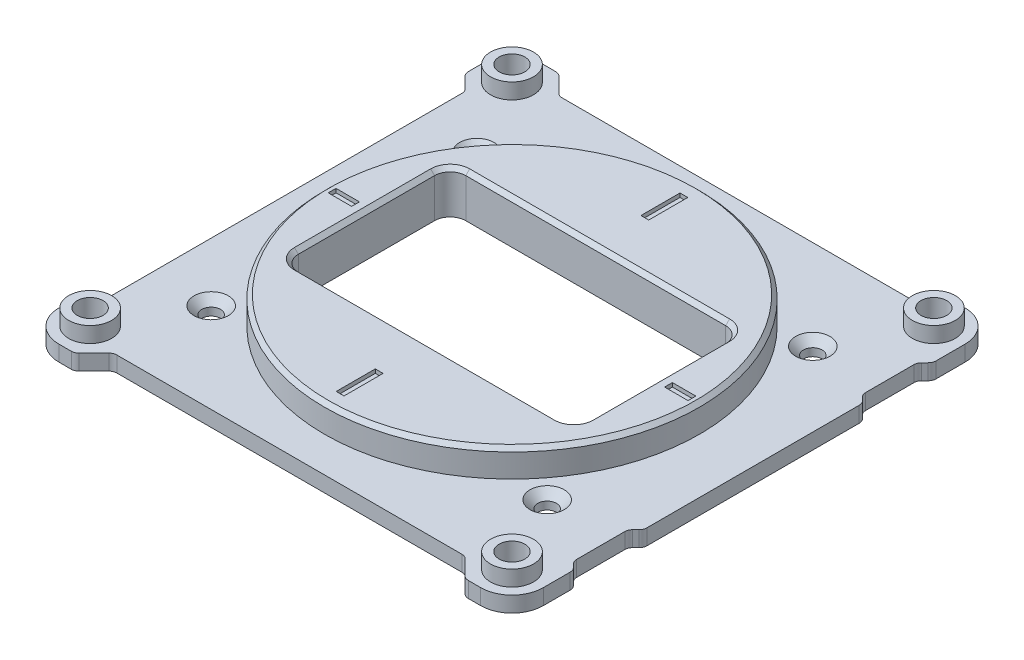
ISO-10303-21;
HEADER;
FILE_DESCRIPTION(('STEP AP214'),'2;1');
FILE_NAME('part.step','',(''),(''),'','','');
FILE_SCHEMA(('AUTOMOTIVE_DESIGN { 1 0 10303 214 1 1 1 1 }'));
ENDSEC;
DATA;
#1=APPLICATION_CONTEXT('core data for automotive mechanical design processes');
#2=APPLICATION_PROTOCOL_DEFINITION('international standard','automotive_design',2000,#1);
#3=PRODUCT_CONTEXT('',#1,'mechanical');
#4=PRODUCT('Part','Part','',(#3));
#5=PRODUCT_RELATED_PRODUCT_CATEGORY('part','',(#4));
#6=PRODUCT_DEFINITION_FORMATION('','',#4);
#7=PRODUCT_DEFINITION_CONTEXT('part definition',#1,'design');
#8=PRODUCT_DEFINITION('design','',#6,#7);
#9=PRODUCT_DEFINITION_SHAPE('','',#8);
#10=(LENGTH_UNIT() NAMED_UNIT(*) SI_UNIT(.MILLI.,.METRE.));
#11=(NAMED_UNIT(*) PLANE_ANGLE_UNIT() SI_UNIT($,.RADIAN.));
#12=(NAMED_UNIT(*) SI_UNIT($,.STERADIAN.) SOLID_ANGLE_UNIT());
#13=UNCERTAINTY_MEASURE_WITH_UNIT(LENGTH_MEASURE(1.E-05),#10,'distance_accuracy_value','');
#14=(GEOMETRIC_REPRESENTATION_CONTEXT(3) GLOBAL_UNCERTAINTY_ASSIGNED_CONTEXT((#13)) GLOBAL_UNIT_ASSIGNED_CONTEXT((#10,
#11,#12)) REPRESENTATION_CONTEXT('',''));
#15=CARTESIAN_POINT('',(0.,0.,0.));
#16=DIRECTION('',(0.,0.,1.));
#17=DIRECTION('',(1.,0.,0.));
#18=AXIS2_PLACEMENT_3D('',#15,#16,#17);
#19=CARTESIAN_POINT('',(-32.6928313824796,4.,-28.4398458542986));
#20=DIRECTION('',(0.,1.,0.));
#21=DIRECTION('',(0.,0.,1.));
#22=AXIS2_PLACEMENT_3D('',#19,#20,#21);
#23=PLANE('',#22);
#24=CARTESIAN_POINT('',(-32.6928313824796,4.,-28.4398458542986));
#25=DIRECTION('',(0.,1.,0.));
#26=DIRECTION('',(0.,0.,1.));
#27=AXIS2_PLACEMENT_3D('',#24,#25,#26);
#28=CIRCLE('',#27,2.75);
#29=CARTESIAN_POINT('',(-32.6928313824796,4.,-25.6898458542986));
#30=VERTEX_POINT('',#29);
#31=EDGE_CURVE('E739',#30,#30,#28,.T.);
#32=ORIENTED_EDGE('',*,*,#31,.T.);
#33=EDGE_LOOP('',(#32));
#34=FACE_BOUND('',#33,.T.);
#35=CARTESIAN_POINT('',(-32.6928313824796,4.,-28.4398458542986));
#36=DIRECTION('',(0.,1.,0.));
#37=DIRECTION('',(0.,0.,1.));
#38=AXIS2_PLACEMENT_3D('',#35,#36,#37);
#39=CIRCLE('',#38,1.65);
#40=CARTESIAN_POINT('',(-32.6928313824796,4.,-26.7898458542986));
#41=VERTEX_POINT('',#40);
#42=EDGE_CURVE('E705',#41,#41,#39,.F.);
#43=ORIENTED_EDGE('',*,*,#42,.T.);
#44=EDGE_LOOP('',(#43));
#45=FACE_BOUND('',#44,.T.);
#46=ADVANCED_FACE('F45',(#34,#45),#23,.T.);
#47=CARTESIAN_POINT('',(0.87350723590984,2.,-0.873507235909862));
#48=DIRECTION('',(-0.707106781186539,0.,0.707106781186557));
#49=DIRECTION('',(0.707106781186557,0.,0.707106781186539));
#50=AXIS2_PLACEMENT_3D('',#47,#48,#49);
#51=PLANE('',#50);
#52=DIRECTION('',(-0.707106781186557,0.,-0.707106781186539));
#53=VECTOR('',#52,1.);
#54=CARTESIAN_POINT('',(0.87350723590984,0.,-0.873507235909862));
#55=LINE('',#54,#53);
#56=CARTESIAN_POINT('',(-28.4857246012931,0.,-30.232739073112));
#57=VERTEX_POINT('',#56);
#58=CARTESIAN_POINT('',(-30.3999381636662,0.,-32.1469526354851));
#59=VERTEX_POINT('',#58);
#60=EDGE_CURVE('E791',#57,#59,#55,.T.);
#61=ORIENTED_EDGE('',*,*,#60,.T.);
#62=DIRECTION('',(0.,-1.,0.));
#63=VECTOR('',#62,1.);
#64=CARTESIAN_POINT('',(-30.3999381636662,2.,-32.1469526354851));
#65=LINE('',#64,#63);
#66=CARTESIAN_POINT('',(-30.3999381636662,2.,-32.1469526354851));
#67=VERTEX_POINT('',#66);
#68=EDGE_CURVE('E1155',#67,#59,#65,.T.);
#69=ORIENTED_EDGE('',*,*,#68,.F.);
#70=DIRECTION('',(-0.707106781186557,0.,-0.707106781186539));
#71=VECTOR('',#70,1.);
#72=CARTESIAN_POINT('',(0.87350723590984,2.,-0.873507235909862));
#73=LINE('',#72,#71);
#74=CARTESIAN_POINT('',(-28.4857246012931,2.,-30.232739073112));
#75=VERTEX_POINT('',#74);
#76=EDGE_CURVE('E792',#75,#67,#73,.T.);
#77=ORIENTED_EDGE('',*,*,#76,.F.);
#78=DIRECTION('',(0.,-1.,0.));
#79=VECTOR('',#78,1.);
#80=CARTESIAN_POINT('',(-28.4857246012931,2.,-30.232739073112));
#81=LINE('',#80,#79);
#82=EDGE_CURVE('E919',#75,#57,#81,.T.);
#83=ORIENTED_EDGE('',*,*,#82,.T.);
#84=EDGE_LOOP('',(#61,#69,#77,#83));
#85=FACE_BOUND('',#84,.T.);
#86=ADVANCED_FACE('F1288',(#85),#51,.F.);
#87=CARTESIAN_POINT('',(-31.1070449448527,2.,-31.4398458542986));
#88=DIRECTION('',(0.,-1.,0.));
#89=DIRECTION('',(0.,0.,-1.));
#90=AXIS2_PLACEMENT_3D('',#87,#88,#89);
#91=CYLINDRICAL_SURFACE('',#90,0.999999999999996);
#92=CARTESIAN_POINT('',(-31.1070449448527,0.,-31.4398458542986));
#93=DIRECTION('',(0.,1.,0.));
#94=DIRECTION('',(0.,0.,1.));
#95=AXIS2_PLACEMENT_3D('',#92,#93,#94);
#96=CIRCLE('',#95,0.999999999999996);
#97=CARTESIAN_POINT('',(-31.1070449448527,0.,-32.4398458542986));
#98=VERTEX_POINT('',#97);
#99=EDGE_CURVE('E922',#59,#98,#96,.T.);
#100=ORIENTED_EDGE('',*,*,#99,.T.);
#101=DIRECTION('',(0.,-1.,0.));
#102=VECTOR('',#101,1.);
#103=CARTESIAN_POINT('',(-31.1070449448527,2.,-32.4398458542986));
#104=LINE('',#103,#102);
#105=CARTESIAN_POINT('',(-31.1070449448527,2.,-32.4398458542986));
#106=VERTEX_POINT('',#105);
#107=EDGE_CURVE('E1152',#106,#98,#104,.T.);
#108=ORIENTED_EDGE('',*,*,#107,.F.);
#109=CARTESIAN_POINT('',(-31.1070449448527,2.,-31.4398458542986));
#110=DIRECTION('',(0.,1.,0.));
#111=DIRECTION('',(0.,0.,1.));
#112=AXIS2_PLACEMENT_3D('',#109,#110,#111);
#113=CIRCLE('',#112,0.999999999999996);
#114=EDGE_CURVE('E795',#67,#106,#113,.T.);
#115=ORIENTED_EDGE('',*,*,#114,.F.);
#116=ORIENTED_EDGE('',*,*,#68,.T.);
#117=EDGE_LOOP('',(#100,#108,#115,#116));
#118=FACE_BOUND('',#117,.T.);
#119=ADVANCED_FACE('F1294',(#118),#91,.T.);
#120=CARTESIAN_POINT('',(0.,2.,-32.4398458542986));
#121=DIRECTION('',(0.,0.,1.));
#122=DIRECTION('',(1.,0.,0.));
#123=AXIS2_PLACEMENT_3D('',#120,#121,#122);
#124=PLANE('',#123);
#125=DIRECTION('',(-1.,0.,0.));
#126=VECTOR('',#125,1.);
#127=CARTESIAN_POINT('',(0.,0.,-32.4398458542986));
#128=LINE('',#127,#126);
#129=CARTESIAN_POINT('',(-32.6928313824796,0.,-32.4398458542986));
#130=VERTEX_POINT('',#129);
#131=EDGE_CURVE('E924',#98,#130,#128,.T.);
#132=ORIENTED_EDGE('',*,*,#131,.T.);
#133=DIRECTION('',(0.,-1.,0.));
#134=VECTOR('',#133,1.);
#135=CARTESIAN_POINT('',(-32.6928313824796,2.,-32.4398458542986));
#136=LINE('',#135,#134);
#137=CARTESIAN_POINT('',(-32.6928313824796,2.,-32.4398458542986));
#138=VERTEX_POINT('',#137);
#139=EDGE_CURVE('E1150',#138,#130,#136,.T.);
#140=ORIENTED_EDGE('',*,*,#139,.F.);
#141=DIRECTION('',(-1.,0.,0.));
#142=VECTOR('',#141,1.);
#143=CARTESIAN_POINT('',(0.,2.,-32.4398458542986));
#144=LINE('',#143,#142);
#145=EDGE_CURVE('E798',#106,#138,#144,.T.);
#146=ORIENTED_EDGE('',*,*,#145,.F.);
#147=ORIENTED_EDGE('',*,*,#107,.T.);
#148=EDGE_LOOP('',(#132,#140,#146,#147));
#149=FACE_BOUND('',#148,.T.);
#150=ADVANCED_FACE('F2265',(#149),#124,.F.);
#151=CARTESIAN_POINT('',(-32.6928313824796,2.,-28.4398458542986));
#152=DIRECTION('',(0.,-1.,0.));
#153=DIRECTION('',(0.,0.,-1.));
#154=AXIS2_PLACEMENT_3D('',#151,#152,#153);
#155=CYLINDRICAL_SURFACE('',#154,4.);
#156=CARTESIAN_POINT('',(-32.6928313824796,0.,-28.4398458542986));
#157=DIRECTION('',(0.,1.,0.));
#158=DIRECTION('',(0.,0.,1.));
#159=AXIS2_PLACEMENT_3D('',#156,#157,#158);
#160=CIRCLE('',#159,4.);
#161=CARTESIAN_POINT('',(-36.6928313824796,0.,-28.4398458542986));
#162=VERTEX_POINT('',#161);
#163=EDGE_CURVE('E927',#162,#130,#160,.F.);
#164=ORIENTED_EDGE('',*,*,#163,.F.);
#165=DIRECTION('',(0.,-1.,0.));
#166=VECTOR('',#165,1.);
#167=CARTESIAN_POINT('',(-36.6928313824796,2.,-28.4398458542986));
#168=LINE('',#167,#166);
#169=CARTESIAN_POINT('',(-36.6928313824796,2.,-28.4398458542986));
#170=VERTEX_POINT('',#169);
#171=EDGE_CURVE('E1148',#170,#162,#168,.T.);
#172=ORIENTED_EDGE('',*,*,#171,.F.);
#173=CARTESIAN_POINT('',(-32.6928313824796,2.,-28.4398458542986));
#174=DIRECTION('',(0.,1.,0.));
#175=DIRECTION('',(0.,0.,1.));
#176=AXIS2_PLACEMENT_3D('',#173,#174,#175);
#177=CIRCLE('',#176,4.);
#178=EDGE_CURVE('E800',#170,#138,#177,.F.);
#179=ORIENTED_EDGE('',*,*,#178,.T.);
#180=ORIENTED_EDGE('',*,*,#139,.T.);
#181=EDGE_LOOP('',(#164,#172,#179,#180));
#182=FACE_BOUND('',#181,.T.);
#183=ADVANCED_FACE('F2256',(#182),#155,.T.);
#184=CARTESIAN_POINT('',(-36.6928313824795,2.,1.60556086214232E-13));
#185=DIRECTION('',(-1.,0.,0.));
#186=DIRECTION('',(0.,0.,1.));
#187=AXIS2_PLACEMENT_3D('',#184,#185,#186);
#188=PLANE('',#187);
#189=DIRECTION('',(0.,0.,-1.));
#190=VECTOR('',#189,1.);
#191=CARTESIAN_POINT('',(-36.6928313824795,0.,1.60556086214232E-13));
#192=LINE('',#191,#190);
#193=CARTESIAN_POINT('',(-36.6928313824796,0.,-26.8540594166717));
#194=VERTEX_POINT('',#193);
#195=EDGE_CURVE('E930',#194,#162,#192,.T.);
#196=ORIENTED_EDGE('',*,*,#195,.F.);
#197=DIRECTION('',(0.,-1.,0.));
#198=VECTOR('',#197,1.);
#199=CARTESIAN_POINT('',(-36.6928313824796,2.,-26.8540594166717));
#200=LINE('',#199,#198);
#201=CARTESIAN_POINT('',(-36.6928313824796,2.,-26.8540594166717));
#202=VERTEX_POINT('',#201);
#203=EDGE_CURVE('E1146',#202,#194,#200,.T.);
#204=ORIENTED_EDGE('',*,*,#203,.F.);
#205=DIRECTION('',(0.,0.,-1.));
#206=VECTOR('',#205,1.);
#207=CARTESIAN_POINT('',(-36.6928313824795,2.,1.60556086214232E-13));
#208=LINE('',#207,#206);
#209=EDGE_CURVE('E803',#202,#170,#208,.T.);
#210=ORIENTED_EDGE('',*,*,#209,.T.);
#211=ORIENTED_EDGE('',*,*,#171,.T.);
#212=EDGE_LOOP('',(#196,#204,#210,#211));
#213=FACE_BOUND('',#212,.T.);
#214=ADVANCED_FACE('F2247',(#213),#188,.T.);
#215=CARTESIAN_POINT('',(-35.6928313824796,2.,-26.8540594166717));
#216=DIRECTION('',(0.,-1.,0.));
#217=DIRECTION('',(0.,0.,-1.));
#218=AXIS2_PLACEMENT_3D('',#215,#216,#217);
#219=CYLINDRICAL_SURFACE('',#218,1.);
#220=CARTESIAN_POINT('',(-35.6928313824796,0.,-26.8540594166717));
#221=DIRECTION('',(0.,1.,0.));
#222=DIRECTION('',(0.,0.,1.));
#223=AXIS2_PLACEMENT_3D('',#220,#221,#222);
#224=CIRCLE('',#223,1.);
#225=CARTESIAN_POINT('',(-36.3999381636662,0.,-26.1469526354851));
#226=VERTEX_POINT('',#225);
#227=EDGE_CURVE('E933',#226,#194,#224,.F.);
#228=ORIENTED_EDGE('',*,*,#227,.F.);
#229=DIRECTION('',(0.,-1.,0.));
#230=VECTOR('',#229,1.);
#231=CARTESIAN_POINT('',(-36.3999381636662,2.,-26.1469526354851));
#232=LINE('',#231,#230);
#233=CARTESIAN_POINT('',(-36.3999381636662,2.,-26.1469526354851));
#234=VERTEX_POINT('',#233);
#235=EDGE_CURVE('E1144',#234,#226,#232,.T.);
#236=ORIENTED_EDGE('',*,*,#235,.F.);
#237=CARTESIAN_POINT('',(-35.6928313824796,2.,-26.8540594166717));
#238=DIRECTION('',(0.,1.,0.));
#239=DIRECTION('',(0.,0.,1.));
#240=AXIS2_PLACEMENT_3D('',#237,#238,#239);
#241=CIRCLE('',#240,1.);
#242=EDGE_CURVE('E806',#234,#202,#241,.F.);
#243=ORIENTED_EDGE('',*,*,#242,.T.);
#244=ORIENTED_EDGE('',*,*,#203,.T.);
#245=EDGE_LOOP('',(#228,#236,#243,#244));
#246=FACE_BOUND('',#245,.T.);
#247=ADVANCED_FACE('F2238',(#246),#219,.T.);
#248=CARTESIAN_POINT('',(-5.12649276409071,2.,5.12649276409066));
#249=DIRECTION('',(-0.707106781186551,0.,0.707106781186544));
#250=DIRECTION('',(0.707106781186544,0.,0.707106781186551));
#251=AXIS2_PLACEMENT_3D('',#248,#249,#250);
#252=PLANE('',#251);
#253=DIRECTION('',(-0.707106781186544,0.,-0.707106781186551));
#254=VECTOR('',#253,1.);
#255=CARTESIAN_POINT('',(-5.12649276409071,0.,5.12649276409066));
#256=LINE('',#255,#254);
#257=CARTESIAN_POINT('',(-34.9857246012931,0.,-24.732739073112));
#258=VERTEX_POINT('',#257);
#259=EDGE_CURVE('E936',#258,#226,#256,.T.);
#260=ORIENTED_EDGE('',*,*,#259,.F.);
#261=DIRECTION('',(0.,-1.,0.));
#262=VECTOR('',#261,1.);
#263=CARTESIAN_POINT('',(-34.9857246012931,2.,-24.732739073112));
#264=LINE('',#263,#262);
#265=CARTESIAN_POINT('',(-34.9857246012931,2.,-24.732739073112));
#266=VERTEX_POINT('',#265);
#267=EDGE_CURVE('E1142',#266,#258,#264,.T.);
#268=ORIENTED_EDGE('',*,*,#267,.F.);
#269=DIRECTION('',(-0.707106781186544,0.,-0.707106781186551));
#270=VECTOR('',#269,1.);
#271=CARTESIAN_POINT('',(-5.12649276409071,2.,5.12649276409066));
#272=LINE('',#271,#270);
#273=EDGE_CURVE('E809',#266,#234,#272,.T.);
#274=ORIENTED_EDGE('',*,*,#273,.T.);
#275=ORIENTED_EDGE('',*,*,#235,.T.);
#276=EDGE_LOOP('',(#260,#268,#274,#275));
#277=FACE_BOUND('',#276,.T.);
#278=ADVANCED_FACE('F2229',(#277),#252,.T.);
#279=CARTESIAN_POINT('',(-35.6928313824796,2.,-24.0256322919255));
#280=DIRECTION('',(0.,-1.,0.));
#281=DIRECTION('',(0.,0.,-1.));
#282=AXIS2_PLACEMENT_3D('',#279,#280,#281);
#283=CYLINDRICAL_SURFACE('',#282,1.);
#284=CARTESIAN_POINT('',(-35.6928313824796,0.,-24.0256322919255));
#285=DIRECTION('',(0.,1.,0.));
#286=DIRECTION('',(0.,0.,1.));
#287=AXIS2_PLACEMENT_3D('',#284,#285,#286);
#288=CIRCLE('',#287,1.);
#289=CARTESIAN_POINT('',(-34.6928313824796,0.,-24.0256322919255));
#290=VERTEX_POINT('',#289);
#291=EDGE_CURVE('E939',#258,#290,#288,.F.);
#292=ORIENTED_EDGE('',*,*,#291,.T.);
#293=DIRECTION('',(0.,-1.,0.));
#294=VECTOR('',#293,1.);
#295=CARTESIAN_POINT('',(-34.6928313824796,2.,-24.0256322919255));
#296=LINE('',#295,#294);
#297=CARTESIAN_POINT('',(-34.6928313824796,2.,-24.0256322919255));
#298=VERTEX_POINT('',#297);
#299=EDGE_CURVE('E1139',#298,#290,#296,.T.);
#300=ORIENTED_EDGE('',*,*,#299,.F.);
#301=CARTESIAN_POINT('',(-35.6928313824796,2.,-24.0256322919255));
#302=DIRECTION('',(0.,1.,0.));
#303=DIRECTION('',(0.,0.,1.));
#304=AXIS2_PLACEMENT_3D('',#301,#302,#303);
#305=CIRCLE('',#304,1.);
#306=EDGE_CURVE('E812',#266,#298,#305,.F.);
#307=ORIENTED_EDGE('',*,*,#306,.F.);
#308=ORIENTED_EDGE('',*,*,#267,.T.);
#309=EDGE_LOOP('',(#292,#300,#307,#308));
#310=FACE_BOUND('',#309,.T.);
#311=ADVANCED_FACE('F2220',(#310),#283,.F.);
#312=CARTESIAN_POINT('',(-34.6928313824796,2.,0.));
#313=DIRECTION('',(1.,0.,0.));
#314=DIRECTION('',(0.,0.,-1.));
#315=AXIS2_PLACEMENT_3D('',#312,#313,#314);
#316=PLANE('',#315);
#317=DIRECTION('',(0.,0.,1.));
#318=VECTOR('',#317,1.);
#319=CARTESIAN_POINT('',(-34.6928313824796,0.,0.));
#320=LINE('',#319,#318);
#321=CARTESIAN_POINT('',(-34.6928313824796,0.,21.1459405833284));
#322=VERTEX_POINT('',#321);
#323=EDGE_CURVE('E941',#290,#322,#320,.T.);
#324=ORIENTED_EDGE('',*,*,#323,.T.);
#325=DIRECTION('',(0.,-1.,0.));
#326=VECTOR('',#325,1.);
#327=CARTESIAN_POINT('',(-34.6928313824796,2.,21.1459405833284));
#328=LINE('',#327,#326);
#329=CARTESIAN_POINT('',(-34.6928313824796,2.,21.1459405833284));
#330=VERTEX_POINT('',#329);
#331=EDGE_CURVE('E1137',#330,#322,#328,.T.);
#332=ORIENTED_EDGE('',*,*,#331,.F.);
#333=DIRECTION('',(0.,0.,1.));
#334=VECTOR('',#333,1.);
#335=CARTESIAN_POINT('',(-34.6928313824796,2.,0.));
#336=LINE('',#335,#334);
#337=EDGE_CURVE('E814',#298,#330,#336,.T.);
#338=ORIENTED_EDGE('',*,*,#337,.F.);
#339=ORIENTED_EDGE('',*,*,#299,.T.);
#340=EDGE_LOOP('',(#324,#332,#338,#339));
#341=FACE_BOUND('',#340,.T.);
#342=ADVANCED_FACE('F2211',(#341),#316,.F.);
#343=CARTESIAN_POINT('',(-35.6928313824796,2.,21.1459405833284));
#344=DIRECTION('',(0.,-1.,0.));
#345=DIRECTION('',(0.,0.,-1.));
#346=AXIS2_PLACEMENT_3D('',#343,#344,#345);
#347=CYLINDRICAL_SURFACE('',#346,1.);
#348=CARTESIAN_POINT('',(-35.6928313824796,0.,21.1459405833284));
#349=DIRECTION('',(0.,1.,0.));
#350=DIRECTION('',(0.,0.,1.));
#351=AXIS2_PLACEMENT_3D('',#348,#349,#350);
#352=CIRCLE('',#351,1.);
#353=CARTESIAN_POINT('',(-34.9857246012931,0.,21.8530473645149));
#354=VERTEX_POINT('',#353);
#355=EDGE_CURVE('E944',#354,#322,#352,.T.);
#356=ORIENTED_EDGE('',*,*,#355,.F.);
#357=DIRECTION('',(0.,-1.,0.));
#358=VECTOR('',#357,1.);
#359=CARTESIAN_POINT('',(-34.9857246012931,2.,21.8530473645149));
#360=LINE('',#359,#358);
#361=CARTESIAN_POINT('',(-34.9857246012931,2.,21.8530473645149));
#362=VERTEX_POINT('',#361);
#363=EDGE_CURVE('E1135',#362,#354,#360,.T.);
#364=ORIENTED_EDGE('',*,*,#363,.F.);
#365=CARTESIAN_POINT('',(-35.6928313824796,2.,21.1459405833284));
#366=DIRECTION('',(0.,1.,0.));
#367=DIRECTION('',(0.,0.,1.));
#368=AXIS2_PLACEMENT_3D('',#365,#366,#367);
#369=CIRCLE('',#368,1.);
#370=EDGE_CURVE('E816',#362,#330,#369,.T.);
#371=ORIENTED_EDGE('',*,*,#370,.T.);
#372=ORIENTED_EDGE('',*,*,#331,.T.);
#373=EDGE_LOOP('',(#356,#364,#371,#372));
#374=FACE_BOUND('',#373,.T.);
#375=ADVANCED_FACE('F2202',(#374),#347,.F.);
#376=CARTESIAN_POINT('',(-6.56633861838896,2.,-6.566338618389));
#377=DIRECTION('',(0.707106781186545,0.,0.70710678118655));
#378=DIRECTION('',(0.70710678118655,0.,-0.707106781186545));
#379=AXIS2_PLACEMENT_3D('',#376,#377,#378);
#380=PLANE('',#379);
#381=DIRECTION('',(-0.70710678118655,0.,0.707106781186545));
#382=VECTOR('',#381,1.);
#383=CARTESIAN_POINT('',(-6.56633861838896,0.,-6.566338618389));
#384=LINE('',#383,#382);
#385=CARTESIAN_POINT('',(-36.3999381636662,0.,23.267260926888));
#386=VERTEX_POINT('',#385);
#387=EDGE_CURVE('E947',#354,#386,#384,.T.);
#388=ORIENTED_EDGE('',*,*,#387,.T.);
#389=DIRECTION('',(0.,-1.,0.));
#390=VECTOR('',#389,1.);
#391=CARTESIAN_POINT('',(-36.3999381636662,2.,23.267260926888));
#392=LINE('',#391,#390);
#393=CARTESIAN_POINT('',(-36.3999381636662,2.,23.267260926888));
#394=VERTEX_POINT('',#393);
#395=EDGE_CURVE('E1132',#394,#386,#392,.T.);
#396=ORIENTED_EDGE('',*,*,#395,.F.);
#397=DIRECTION('',(-0.70710678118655,0.,0.707106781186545));
#398=VECTOR('',#397,1.);
#399=CARTESIAN_POINT('',(-6.56633861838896,2.,-6.566338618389));
#400=LINE('',#399,#398);
#401=EDGE_CURVE('E819',#362,#394,#400,.T.);
#402=ORIENTED_EDGE('',*,*,#401,.F.);
#403=ORIENTED_EDGE('',*,*,#363,.T.);
#404=EDGE_LOOP('',(#388,#396,#402,#403));
#405=FACE_BOUND('',#404,.T.);
#406=ADVANCED_FACE('F2193',(#405),#380,.F.);
#407=CARTESIAN_POINT('',(-35.6928313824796,2.,23.9743677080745));
#408=DIRECTION('',(0.,-1.,0.));
#409=DIRECTION('',(0.,0.,-1.));
#410=AXIS2_PLACEMENT_3D('',#407,#408,#409);
#411=CYLINDRICAL_SURFACE('',#410,1.);
#412=CARTESIAN_POINT('',(-35.6928313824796,0.,23.9743677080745));
#413=DIRECTION('',(0.,1.,0.));
#414=DIRECTION('',(0.,0.,1.));
#415=AXIS2_PLACEMENT_3D('',#412,#413,#414);
#416=CIRCLE('',#415,1.);
#417=CARTESIAN_POINT('',(-36.6928313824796,0.,23.9743677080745));
#418=VERTEX_POINT('',#417);
#419=EDGE_CURVE('E949',#386,#418,#416,.T.);
#420=ORIENTED_EDGE('',*,*,#419,.T.);
#421=DIRECTION('',(0.,-1.,0.));
#422=VECTOR('',#421,1.);
#423=CARTESIAN_POINT('',(-36.6928313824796,2.,23.9743677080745));
#424=LINE('',#423,#422);
#425=CARTESIAN_POINT('',(-36.6928313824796,2.,23.9743677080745));
#426=VERTEX_POINT('',#425);
#427=EDGE_CURVE('E1129',#426,#418,#424,.T.);
#428=ORIENTED_EDGE('',*,*,#427,.F.);
#429=CARTESIAN_POINT('',(-35.6928313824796,2.,23.9743677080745));
#430=DIRECTION('',(0.,1.,0.));
#431=DIRECTION('',(0.,0.,1.));
#432=AXIS2_PLACEMENT_3D('',#429,#430,#431);
#433=CIRCLE('',#432,1.);
#434=EDGE_CURVE('E821',#394,#426,#433,.T.);
#435=ORIENTED_EDGE('',*,*,#434,.F.);
#436=ORIENTED_EDGE('',*,*,#395,.T.);
#437=EDGE_LOOP('',(#420,#428,#435,#436));
#438=FACE_BOUND('',#437,.T.);
#439=ADVANCED_FACE('F2184',(#438),#411,.T.);
#440=CARTESIAN_POINT('',(-36.6928313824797,2.,1.60556086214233E-13));
#441=DIRECTION('',(1.,0.,0.));
#442=DIRECTION('',(0.,0.,-1.));
#443=AXIS2_PLACEMENT_3D('',#440,#441,#442);
#444=PLANE('',#443);
#445=DIRECTION('',(0.,0.,1.));
#446=VECTOR('',#445,1.);
#447=CARTESIAN_POINT('',(-36.6928313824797,0.,1.60556086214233E-13));
#448=LINE('',#447,#446);
#449=CARTESIAN_POINT('',(-36.6928313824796,0.,25.5601541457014));
#450=VERTEX_POINT('',#449);
#451=EDGE_CURVE('E951',#418,#450,#448,.T.);
#452=ORIENTED_EDGE('',*,*,#451,.T.);
#453=DIRECTION('',(0.,-1.,0.));
#454=VECTOR('',#453,1.);
#455=CARTESIAN_POINT('',(-36.6928313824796,2.,25.5601541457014));
#456=LINE('',#455,#454);
#457=CARTESIAN_POINT('',(-36.6928313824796,2.,25.5601541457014));
#458=VERTEX_POINT('',#457);
#459=EDGE_CURVE('E1126',#458,#450,#456,.T.);
#460=ORIENTED_EDGE('',*,*,#459,.F.);
#461=DIRECTION('',(0.,0.,1.));
#462=VECTOR('',#461,1.);
#463=CARTESIAN_POINT('',(-36.6928313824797,2.,1.60556086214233E-13));
#464=LINE('',#463,#462);
#465=EDGE_CURVE('E823',#426,#458,#464,.T.);
#466=ORIENTED_EDGE('',*,*,#465,.F.);
#467=ORIENTED_EDGE('',*,*,#427,.T.);
#468=EDGE_LOOP('',(#452,#460,#466,#467));
#469=FACE_BOUND('',#468,.T.);
#470=ADVANCED_FACE('F2175',(#469),#444,.F.);
#471=CARTESIAN_POINT('',(-32.6928313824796,2.,25.5601541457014));
#472=DIRECTION('',(0.,-1.,0.));
#473=DIRECTION('',(0.,0.,-1.));
#474=AXIS2_PLACEMENT_3D('',#471,#472,#473);
#475=CYLINDRICAL_SURFACE('',#474,4.);
#476=CARTESIAN_POINT('',(-32.6928313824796,0.,25.5601541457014));
#477=DIRECTION('',(0.,1.,0.));
#478=DIRECTION('',(0.,0.,1.));
#479=AXIS2_PLACEMENT_3D('',#476,#477,#478);
#480=CIRCLE('',#479,4.);
#481=CARTESIAN_POINT('',(-32.6928313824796,0.,29.5601541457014));
#482=VERTEX_POINT('',#481);
#483=EDGE_CURVE('E953',#450,#482,#480,.T.);
#484=ORIENTED_EDGE('',*,*,#483,.T.);
#485=DIRECTION('',(0.,-1.,0.));
#486=VECTOR('',#485,1.);
#487=CARTESIAN_POINT('',(-32.6928313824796,2.,29.5601541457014));
#488=LINE('',#487,#486);
#489=CARTESIAN_POINT('',(-32.6928313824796,2.,29.5601541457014));
#490=VERTEX_POINT('',#489);
#491=EDGE_CURVE('E1124',#490,#482,#488,.T.);
#492=ORIENTED_EDGE('',*,*,#491,.F.);
#493=CARTESIAN_POINT('',(-32.6928313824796,2.,25.5601541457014));
#494=DIRECTION('',(0.,1.,0.));
#495=DIRECTION('',(0.,0.,1.));
#496=AXIS2_PLACEMENT_3D('',#493,#494,#495);
#497=CIRCLE('',#496,4.);
#498=EDGE_CURVE('E825',#458,#490,#497,.T.);
#499=ORIENTED_EDGE('',*,*,#498,.F.);
#500=ORIENTED_EDGE('',*,*,#459,.T.);
#501=EDGE_LOOP('',(#484,#492,#499,#500));
#502=FACE_BOUND('',#501,.T.);
#503=ADVANCED_FACE('F2166',(#502),#475,.T.);
#504=CARTESIAN_POINT('',(0.,2.,29.5601541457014));
#505=DIRECTION('',(0.,0.,1.));
#506=DIRECTION('',(1.,0.,0.));
#507=AXIS2_PLACEMENT_3D('',#504,#505,#506);
#508=PLANE('',#507);
#509=DIRECTION('',(-1.,0.,0.));
#510=VECTOR('',#509,1.);
#511=CARTESIAN_POINT('',(0.,0.,29.5601541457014));
#512=LINE('',#511,#510);
#513=CARTESIAN_POINT('',(-31.1070449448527,0.,29.5601541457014));
#514=VERTEX_POINT('',#513);
#515=EDGE_CURVE('E956',#514,#482,#512,.T.);
#516=ORIENTED_EDGE('',*,*,#515,.F.);
#517=DIRECTION('',(0.,-1.,0.));
#518=VECTOR('',#517,1.);
#519=CARTESIAN_POINT('',(-31.1070449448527,2.,29.5601541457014));
#520=LINE('',#519,#518);
#521=CARTESIAN_POINT('',(-31.1070449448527,2.,29.5601541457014));
#522=VERTEX_POINT('',#521);
#523=EDGE_CURVE('E1122',#522,#514,#520,.T.);
#524=ORIENTED_EDGE('',*,*,#523,.F.);
#525=DIRECTION('',(-1.,0.,0.));
#526=VECTOR('',#525,1.);
#527=CARTESIAN_POINT('',(0.,2.,29.5601541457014));
#528=LINE('',#527,#526);
#529=EDGE_CURVE('E827',#522,#490,#528,.T.);
#530=ORIENTED_EDGE('',*,*,#529,.T.);
#531=ORIENTED_EDGE('',*,*,#491,.T.);
#532=EDGE_LOOP('',(#516,#524,#530,#531));
#533=FACE_BOUND('',#532,.T.);
#534=ADVANCED_FACE('F2157',(#533),#508,.T.);
#535=CARTESIAN_POINT('',(-31.1070449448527,2.,28.5601541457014));
#536=DIRECTION('',(0.,-1.,0.));
#537=DIRECTION('',(0.,0.,-1.));
#538=AXIS2_PLACEMENT_3D('',#535,#536,#537);
#539=CYLINDRICAL_SURFACE('',#538,0.999999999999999);
#540=CARTESIAN_POINT('',(-31.1070449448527,0.,28.5601541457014));
#541=DIRECTION('',(0.,1.,0.));
#542=DIRECTION('',(0.,0.,1.));
#543=AXIS2_PLACEMENT_3D('',#540,#541,#542);
#544=CIRCLE('',#543,0.999999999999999);
#545=CARTESIAN_POINT('',(-30.3999381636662,0.,29.267260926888));
#546=VERTEX_POINT('',#545);
#547=EDGE_CURVE('E959',#546,#514,#544,.F.);
#548=ORIENTED_EDGE('',*,*,#547,.F.);
#549=DIRECTION('',(0.,-1.,0.));
#550=VECTOR('',#549,1.);
#551=CARTESIAN_POINT('',(-30.3999381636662,2.,29.267260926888));
#552=LINE('',#551,#550);
#553=CARTESIAN_POINT('',(-30.3999381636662,2.,29.267260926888));
#554=VERTEX_POINT('',#553);
#555=EDGE_CURVE('E1120',#554,#546,#552,.T.);
#556=ORIENTED_EDGE('',*,*,#555,.F.);
#557=CARTESIAN_POINT('',(-31.1070449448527,2.,28.5601541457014));
#558=DIRECTION('',(0.,1.,0.));
#559=DIRECTION('',(0.,0.,1.));
#560=AXIS2_PLACEMENT_3D('',#557,#558,#559);
#561=CIRCLE('',#560,0.999999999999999);
#562=EDGE_CURVE('E830',#554,#522,#561,.F.);
#563=ORIENTED_EDGE('',*,*,#562,.T.);
#564=ORIENTED_EDGE('',*,*,#523,.T.);
#565=EDGE_LOOP('',(#548,#556,#563,#564));
#566=FACE_BOUND('',#565,.T.);
#567=ADVANCED_FACE('F2148',(#566),#539,.T.);
#568=CARTESIAN_POINT('',(-0.566338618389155,2.,-0.566338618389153));
#569=DIRECTION('',(0.707106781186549,0.,0.707106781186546));
#570=DIRECTION('',(0.707106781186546,0.,-0.707106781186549));
#571=AXIS2_PLACEMENT_3D('',#568,#569,#570);
#572=PLANE('',#571);
#573=DIRECTION('',(-0.707106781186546,0.,0.707106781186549));
#574=VECTOR('',#573,1.);
#575=CARTESIAN_POINT('',(-0.566338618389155,0.,-0.566338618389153));
#576=LINE('',#575,#574);
#577=CARTESIAN_POINT('',(-28.4857246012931,0.,27.3530473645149));
#578=VERTEX_POINT('',#577);
#579=EDGE_CURVE('E962',#578,#546,#576,.T.);
#580=ORIENTED_EDGE('',*,*,#579,.F.);
#581=DIRECTION('',(0.,-1.,0.));
#582=VECTOR('',#581,1.);
#583=CARTESIAN_POINT('',(-28.4857246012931,2.,27.3530473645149));
#584=LINE('',#583,#582);
#585=CARTESIAN_POINT('',(-28.4857246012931,2.,27.3530473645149));
#586=VERTEX_POINT('',#585);
#587=EDGE_CURVE('E1118',#586,#578,#584,.T.);
#588=ORIENTED_EDGE('',*,*,#587,.F.);
#589=DIRECTION('',(-0.707106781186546,0.,0.707106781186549));
#590=VECTOR('',#589,1.);
#591=CARTESIAN_POINT('',(-0.566338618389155,2.,-0.566338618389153));
#592=LINE('',#591,#590);
#593=EDGE_CURVE('E833',#586,#554,#592,.T.);
#594=ORIENTED_EDGE('',*,*,#593,.T.);
#595=ORIENTED_EDGE('',*,*,#555,.T.);
#596=EDGE_LOOP('',(#580,#588,#594,#595));
#597=FACE_BOUND('',#596,.T.);
#598=ADVANCED_FACE('F2139',(#597),#572,.T.);
#599=CARTESIAN_POINT('',(-27.7786178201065,2.,28.0601541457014));
#600=DIRECTION('',(0.,-1.,0.));
#601=DIRECTION('',(0.,0.,-1.));
#602=AXIS2_PLACEMENT_3D('',#599,#600,#601);
#603=CYLINDRICAL_SURFACE('',#602,1.);
#604=CARTESIAN_POINT('',(-27.7786178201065,0.,28.0601541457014));
#605=DIRECTION('',(0.,1.,0.));
#606=DIRECTION('',(0.,0.,1.));
#607=AXIS2_PLACEMENT_3D('',#604,#605,#606);
#608=CIRCLE('',#607,1.);
#609=CARTESIAN_POINT('',(-27.7786178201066,0.,27.0601541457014));
#610=VERTEX_POINT('',#609);
#611=EDGE_CURVE('E965',#578,#610,#608,.F.);
#612=ORIENTED_EDGE('',*,*,#611,.T.);
#613=DIRECTION('',(0.,-1.,0.));
#614=VECTOR('',#613,1.);
#615=CARTESIAN_POINT('',(-27.7786178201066,2.,27.0601541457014));
#616=LINE('',#615,#614);
#617=CARTESIAN_POINT('',(-27.7786178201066,2.,27.0601541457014));
#618=VERTEX_POINT('',#617);
#619=EDGE_CURVE('E1115',#618,#610,#616,.T.);
#620=ORIENTED_EDGE('',*,*,#619,.F.);
#621=CARTESIAN_POINT('',(-27.7786178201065,2.,28.0601541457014));
#622=DIRECTION('',(0.,1.,0.));
#623=DIRECTION('',(0.,0.,1.));
#624=AXIS2_PLACEMENT_3D('',#621,#622,#623);
#625=CIRCLE('',#624,1.);
#626=EDGE_CURVE('E836',#586,#618,#625,.F.);
#627=ORIENTED_EDGE('',*,*,#626,.F.);
#628=ORIENTED_EDGE('',*,*,#587,.T.);
#629=EDGE_LOOP('',(#612,#620,#627,#628));
#630=FACE_BOUND('',#629,.T.);
#631=ADVANCED_FACE('F2130',(#630),#603,.F.);
#632=CARTESIAN_POINT('',(0.,2.,27.0601541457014));
#633=DIRECTION('',(0.,0.,-1.));
#634=DIRECTION('',(-1.,0.,0.));
#635=AXIS2_PLACEMENT_3D('',#632,#633,#634);
#636=PLANE('',#635);
#637=DIRECTION('',(1.,0.,0.));
#638=VECTOR('',#637,1.);
#639=CARTESIAN_POINT('',(0.,0.,27.0601541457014));
#640=LINE('',#639,#638);
#641=CARTESIAN_POINT('',(16.3929550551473,0.,27.0601541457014));
#642=VERTEX_POINT('',#641);
#643=EDGE_CURVE('E967',#610,#642,#640,.T.);
#644=ORIENTED_EDGE('',*,*,#643,.T.);
#645=DIRECTION('',(0.,-1.,0.));
#646=VECTOR('',#645,1.);
#647=CARTESIAN_POINT('',(16.3929550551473,2.,27.0601541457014));
#648=LINE('',#647,#646);
#649=CARTESIAN_POINT('',(16.3929550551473,2.,27.0601541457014));
#650=VERTEX_POINT('',#649);
#651=EDGE_CURVE('E1113',#650,#642,#648,.T.);
#652=ORIENTED_EDGE('',*,*,#651,.F.);
#653=DIRECTION('',(1.,0.,0.));
#654=VECTOR('',#653,1.);
#655=CARTESIAN_POINT('',(0.,2.,27.0601541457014));
#656=LINE('',#655,#654);
#657=EDGE_CURVE('E838',#618,#650,#656,.T.);
#658=ORIENTED_EDGE('',*,*,#657,.F.);
#659=ORIENTED_EDGE('',*,*,#619,.T.);
#660=EDGE_LOOP('',(#644,#652,#658,#659));
#661=FACE_BOUND('',#660,.T.);
#662=ADVANCED_FACE('F2121',(#661),#636,.F.);
#663=CARTESIAN_POINT('',(16.3929550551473,2.,28.0601541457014));
#664=DIRECTION('',(0.,-1.,0.));
#665=DIRECTION('',(0.,0.,-1.));
#666=AXIS2_PLACEMENT_3D('',#663,#664,#665);
#667=CYLINDRICAL_SURFACE('',#666,1.00000000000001);
#668=CARTESIAN_POINT('',(16.3929550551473,0.,28.0601541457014));
#669=DIRECTION('',(0.,1.,0.));
#670=DIRECTION('',(0.,0.,1.));
#671=AXIS2_PLACEMENT_3D('',#668,#669,#670);
#672=CIRCLE('',#671,1.00000000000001);
#673=CARTESIAN_POINT('',(17.1000618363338,0.,27.3530473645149));
#674=VERTEX_POINT('',#673);
#675=EDGE_CURVE('E970',#674,#642,#672,.T.);
#676=ORIENTED_EDGE('',*,*,#675,.F.);
#677=DIRECTION('',(0.,-1.,0.));
#678=VECTOR('',#677,1.);
#679=CARTESIAN_POINT('',(17.1000618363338,2.,27.3530473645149));
#680=LINE('',#679,#678);
#681=CARTESIAN_POINT('',(17.1000618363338,2.,27.3530473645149));
#682=VERTEX_POINT('',#681);
#683=EDGE_CURVE('E1111',#682,#674,#680,.T.);
#684=ORIENTED_EDGE('',*,*,#683,.F.);
#685=CARTESIAN_POINT('',(16.3929550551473,2.,28.0601541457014));
#686=DIRECTION('',(0.,1.,0.));
#687=DIRECTION('',(0.,0.,1.));
#688=AXIS2_PLACEMENT_3D('',#685,#686,#687);
#689=CIRCLE('',#688,1.00000000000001);
#690=EDGE_CURVE('E840',#682,#650,#689,.T.);
#691=ORIENTED_EDGE('',*,*,#690,.T.);
#692=ORIENTED_EDGE('',*,*,#651,.T.);
#693=EDGE_LOOP('',(#676,#684,#691,#692));
#694=FACE_BOUND('',#693,.T.);
#695=ADVANCED_FACE('F2112',(#694),#667,.F.);
#696=CARTESIAN_POINT('',(-5.12649276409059,2.,5.12649276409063));
#697=DIRECTION('',(0.707106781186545,0.,-0.70710678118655));
#698=DIRECTION('',(-0.70710678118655,0.,-0.707106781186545));
#699=AXIS2_PLACEMENT_3D('',#696,#697,#698);
#700=PLANE('',#699);
#701=DIRECTION('',(0.70710678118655,0.,0.707106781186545));
#702=VECTOR('',#701,1.);
#703=CARTESIAN_POINT('',(-5.12649276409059,0.,5.12649276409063));
#704=LINE('',#703,#702);
#705=CARTESIAN_POINT('',(19.0142753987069,0.,29.267260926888));
#706=VERTEX_POINT('',#705);
#707=EDGE_CURVE('E973',#674,#706,#704,.T.);
#708=ORIENTED_EDGE('',*,*,#707,.T.);
#709=DIRECTION('',(0.,-1.,0.));
#710=VECTOR('',#709,1.);
#711=CARTESIAN_POINT('',(19.0142753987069,2.,29.267260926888));
#712=LINE('',#711,#710);
#713=CARTESIAN_POINT('',(19.0142753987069,2.,29.267260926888));
#714=VERTEX_POINT('',#713);
#715=EDGE_CURVE('E1108',#714,#706,#712,.T.);
#716=ORIENTED_EDGE('',*,*,#715,.F.);
#717=DIRECTION('',(0.70710678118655,0.,0.707106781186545));
#718=VECTOR('',#717,1.);
#719=CARTESIAN_POINT('',(-5.12649276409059,2.,5.12649276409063));
#720=LINE('',#719,#718);
#721=EDGE_CURVE('E843',#682,#714,#720,.T.);
#722=ORIENTED_EDGE('',*,*,#721,.F.);
#723=ORIENTED_EDGE('',*,*,#683,.T.);
#724=EDGE_LOOP('',(#708,#716,#722,#723));
#725=FACE_BOUND('',#724,.T.);
#726=ADVANCED_FACE('F2103',(#725),#700,.F.);
#727=CARTESIAN_POINT('',(19.7213821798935,2.,28.5601541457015));
#728=DIRECTION('',(0.,-1.,0.));
#729=DIRECTION('',(0.,0.,-1.));
#730=AXIS2_PLACEMENT_3D('',#727,#728,#729);
#731=CYLINDRICAL_SURFACE('',#730,0.999999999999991);
#732=CARTESIAN_POINT('',(19.7213821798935,0.,28.5601541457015));
#733=DIRECTION('',(0.,1.,0.));
#734=DIRECTION('',(0.,0.,1.));
#735=AXIS2_PLACEMENT_3D('',#732,#733,#734);
#736=CIRCLE('',#735,0.999999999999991);
#737=CARTESIAN_POINT('',(19.7213821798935,0.,29.5601541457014));
#738=VERTEX_POINT('',#737);
#739=EDGE_CURVE('E975',#706,#738,#736,.T.);
#740=ORIENTED_EDGE('',*,*,#739,.T.);
#741=DIRECTION('',(0.,-1.,0.));
#742=VECTOR('',#741,1.);
#743=CARTESIAN_POINT('',(19.7213821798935,2.,29.5601541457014));
#744=LINE('',#743,#742);
#745=CARTESIAN_POINT('',(19.7213821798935,2.,29.5601541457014));
#746=VERTEX_POINT('',#745);
#747=EDGE_CURVE('E1105',#746,#738,#744,.T.);
#748=ORIENTED_EDGE('',*,*,#747,.F.);
#749=CARTESIAN_POINT('',(19.7213821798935,2.,28.5601541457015));
#750=DIRECTION('',(0.,1.,0.));
#751=DIRECTION('',(0.,0.,1.));
#752=AXIS2_PLACEMENT_3D('',#749,#750,#751);
#753=CIRCLE('',#752,0.999999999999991);
#754=EDGE_CURVE('E845',#714,#746,#753,.T.);
#755=ORIENTED_EDGE('',*,*,#754,.F.);
#756=ORIENTED_EDGE('',*,*,#715,.T.);
#757=EDGE_LOOP('',(#740,#748,#755,#756));
#758=FACE_BOUND('',#757,.T.);
#759=ADVANCED_FACE('F2094',(#758),#731,.T.);
#760=CARTESIAN_POINT('',(1.29345773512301E-13,2.,29.5601541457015));
#761=DIRECTION('',(0.,0.,-1.));
#762=DIRECTION('',(-1.,0.,0.));
#763=AXIS2_PLACEMENT_3D('',#760,#761,#762);
#764=PLANE('',#763);
#765=DIRECTION('',(1.,0.,0.));
#766=VECTOR('',#765,1.);
#767=CARTESIAN_POINT('',(1.29345773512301E-13,0.,29.5601541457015));
#768=LINE('',#767,#766);
#769=CARTESIAN_POINT('',(21.3071686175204,0.,29.5601541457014));
#770=VERTEX_POINT('',#769);
#771=EDGE_CURVE('E977',#738,#770,#768,.T.);
#772=ORIENTED_EDGE('',*,*,#771,.T.);
#773=DIRECTION('',(0.,-1.,0.));
#774=VECTOR('',#773,1.);
#775=CARTESIAN_POINT('',(21.3071686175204,2.,29.5601541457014));
#776=LINE('',#775,#774);
#777=CARTESIAN_POINT('',(21.3071686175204,2.,29.5601541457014));
#778=VERTEX_POINT('',#777);
#779=EDGE_CURVE('E1103',#778,#770,#776,.T.);
#780=ORIENTED_EDGE('',*,*,#779,.F.);
#781=DIRECTION('',(1.,0.,0.));
#782=VECTOR('',#781,1.);
#783=CARTESIAN_POINT('',(1.29345773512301E-13,2.,29.5601541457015));
#784=LINE('',#783,#782);
#785=EDGE_CURVE('E847',#746,#778,#784,.T.);
#786=ORIENTED_EDGE('',*,*,#785,.F.);
#787=ORIENTED_EDGE('',*,*,#747,.T.);
#788=EDGE_LOOP('',(#772,#780,#786,#787));
#789=FACE_BOUND('',#788,.T.);
#790=ADVANCED_FACE('F2085',(#789),#764,.F.);
#791=CARTESIAN_POINT('',(21.3071686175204,2.,25.5601541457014));
#792=DIRECTION('',(0.,-1.,0.));
#793=DIRECTION('',(0.,0.,-1.));
#794=AXIS2_PLACEMENT_3D('',#791,#792,#793);
#795=CYLINDRICAL_SURFACE('',#794,4.);
#796=CARTESIAN_POINT('',(21.3071686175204,0.,25.5601541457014));
#797=DIRECTION('',(0.,1.,0.));
#798=DIRECTION('',(0.,0.,1.));
#799=AXIS2_PLACEMENT_3D('',#796,#797,#798);
#800=CIRCLE('',#799,4.);
#801=CARTESIAN_POINT('',(25.3071686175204,0.,25.5601541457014));
#802=VERTEX_POINT('',#801);
#803=EDGE_CURVE('E980',#802,#770,#800,.F.);
#804=ORIENTED_EDGE('',*,*,#803,.F.);
#805=DIRECTION('',(0.,-1.,0.));
#806=VECTOR('',#805,1.);
#807=CARTESIAN_POINT('',(25.3071686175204,2.,25.5601541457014));
#808=LINE('',#807,#806);
#809=CARTESIAN_POINT('',(25.3071686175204,2.,25.5601541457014));
#810=VERTEX_POINT('',#809);
#811=EDGE_CURVE('E1101',#810,#802,#808,.T.);
#812=ORIENTED_EDGE('',*,*,#811,.F.);
#813=CARTESIAN_POINT('',(21.3071686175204,2.,25.5601541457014));
#814=DIRECTION('',(0.,1.,0.));
#815=DIRECTION('',(0.,0.,1.));
#816=AXIS2_PLACEMENT_3D('',#813,#814,#815);
#817=CIRCLE('',#816,4.);
#818=EDGE_CURVE('E849',#810,#778,#817,.F.);
#819=ORIENTED_EDGE('',*,*,#818,.T.);
#820=ORIENTED_EDGE('',*,*,#779,.T.);
#821=EDGE_LOOP('',(#804,#812,#819,#820));
#822=FACE_BOUND('',#821,.T.);
#823=ADVANCED_FACE('F2076',(#822),#795,.T.);
#824=CARTESIAN_POINT('',(25.3071686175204,2.,0.));
#825=DIRECTION('',(1.,0.,0.));
#826=DIRECTION('',(0.,0.,-1.));
#827=AXIS2_PLACEMENT_3D('',#824,#825,#826);
#828=PLANE('',#827);
#829=DIRECTION('',(0.,0.,1.));
#830=VECTOR('',#829,1.);
#831=CARTESIAN_POINT('',(25.3071686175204,0.,0.));
#832=LINE('',#831,#830);
#833=CARTESIAN_POINT('',(25.3071686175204,0.,22.1140329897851));
#834=VERTEX_POINT('',#833);
#835=EDGE_CURVE('E983',#834,#802,#832,.T.);
#836=ORIENTED_EDGE('',*,*,#835,.F.);
#837=DIRECTION('',(0.,-1.,0.));
#838=VECTOR('',#837,1.);
#839=CARTESIAN_POINT('',(25.3071686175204,2.,22.1140329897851));
#840=LINE('',#839,#838);
#841=CARTESIAN_POINT('',(25.3071686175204,2.,22.1140329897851));
#842=VERTEX_POINT('',#841);
#843=EDGE_CURVE('E1099',#842,#834,#840,.T.);
#844=ORIENTED_EDGE('',*,*,#843,.F.);
#845=DIRECTION('',(0.,0.,1.));
#846=VECTOR('',#845,1.);
#847=CARTESIAN_POINT('',(25.3071686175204,2.,0.));
#848=LINE('',#847,#846);
#849=EDGE_CURVE('E852',#842,#810,#848,.T.);
#850=ORIENTED_EDGE('',*,*,#849,.T.);
#851=ORIENTED_EDGE('',*,*,#811,.T.);
#852=EDGE_LOOP('',(#836,#844,#850,#851));
#853=FACE_BOUND('',#852,.T.);
#854=ADVANCED_FACE('F2067',(#853),#828,.T.);
#855=CARTESIAN_POINT('',(24.3071686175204,2.,22.1140329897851));
#856=DIRECTION('',(0.,-1.,0.));
#857=DIRECTION('',(0.,0.,-1.));
#858=AXIS2_PLACEMENT_3D('',#855,#856,#857);
#859=CYLINDRICAL_SURFACE('',#858,1.);
#860=CARTESIAN_POINT('',(24.3071686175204,0.,22.1140329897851));
#861=DIRECTION('',(0.,1.,0.));
#862=DIRECTION('',(0.,0.,1.));
#863=AXIS2_PLACEMENT_3D('',#860,#861,#862);
#864=CIRCLE('',#863,1.);
#865=CARTESIAN_POINT('',(25.0142753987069,0.,21.4069262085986));
#866=VERTEX_POINT('',#865);
#867=EDGE_CURVE('E986',#866,#834,#864,.F.);
#868=ORIENTED_EDGE('',*,*,#867,.F.);
#869=DIRECTION('',(0.,-1.,0.));
#870=VECTOR('',#869,1.);
#871=CARTESIAN_POINT('',(25.0142753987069,2.,21.4069262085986));
#872=LINE('',#871,#870);
#873=CARTESIAN_POINT('',(25.0142753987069,2.,21.4069262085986));
#874=VERTEX_POINT('',#873);
#875=EDGE_CURVE('E1097',#874,#866,#872,.T.);
#876=ORIENTED_EDGE('',*,*,#875,.F.);
#877=CARTESIAN_POINT('',(24.3071686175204,2.,22.1140329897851));
#878=DIRECTION('',(0.,1.,0.));
#879=DIRECTION('',(0.,0.,1.));
#880=AXIS2_PLACEMENT_3D('',#877,#878,#879);
#881=CIRCLE('',#880,1.);
#882=EDGE_CURVE('E855',#874,#842,#881,.F.);
#883=ORIENTED_EDGE('',*,*,#882,.T.);
#884=ORIENTED_EDGE('',*,*,#843,.T.);
#885=EDGE_LOOP('',(#868,#876,#883,#884));
#886=FACE_BOUND('',#885,.T.);
#887=ADVANCED_FACE('F2058',(#886),#859,.T.);
#888=CARTESIAN_POINT('',(1.80367459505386,2.,-1.8036745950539));
#889=DIRECTION('',(0.707106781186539,0.,-0.707106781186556));
#890=DIRECTION('',(-0.707106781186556,0.,-0.707106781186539));
#891=AXIS2_PLACEMENT_3D('',#888,#889,#890);
#892=PLANE('',#891);
#893=DIRECTION('',(0.707106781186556,0.,0.707106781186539));
#894=VECTOR('',#893,1.);
#895=CARTESIAN_POINT('',(1.80367459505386,0.,-1.8036745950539));
#896=LINE('',#895,#894);
#897=CARTESIAN_POINT('',(24.6000618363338,0.,20.9927126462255));
#898=VERTEX_POINT('',#897);
#899=EDGE_CURVE('E989',#898,#866,#896,.T.);
#900=ORIENTED_EDGE('',*,*,#899,.F.);
#901=DIRECTION('',(0.,-1.,0.));
#902=VECTOR('',#901,1.);
#903=CARTESIAN_POINT('',(24.6000618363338,2.,20.9927126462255));
#904=LINE('',#903,#902);
#905=CARTESIAN_POINT('',(24.6000618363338,2.,20.9927126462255));
#906=VERTEX_POINT('',#905);
#907=EDGE_CURVE('E1095',#906,#898,#904,.T.);
#908=ORIENTED_EDGE('',*,*,#907,.F.);
#909=DIRECTION('',(0.707106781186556,0.,0.707106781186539));
#910=VECTOR('',#909,1.);
#911=CARTESIAN_POINT('',(1.80367459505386,2.,-1.8036745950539));
#912=LINE('',#911,#910);
#913=EDGE_CURVE('E858',#906,#874,#912,.T.);
#914=ORIENTED_EDGE('',*,*,#913,.T.);
#915=ORIENTED_EDGE('',*,*,#875,.T.);
#916=EDGE_LOOP('',(#900,#908,#914,#915));
#917=FACE_BOUND('',#916,.T.);
#918=ADVANCED_FACE('F2049',(#917),#892,.T.);
#919=CARTESIAN_POINT('',(25.3071686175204,2.,20.2856058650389));
#920=DIRECTION('',(0.,-1.,0.));
#921=DIRECTION('',(0.,0.,-1.));
#922=AXIS2_PLACEMENT_3D('',#919,#920,#921);
#923=CYLINDRICAL_SURFACE('',#922,1.);
#924=CARTESIAN_POINT('',(25.3071686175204,0.,20.2856058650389));
#925=DIRECTION('',(0.,1.,0.));
#926=DIRECTION('',(0.,0.,1.));
#927=AXIS2_PLACEMENT_3D('',#924,#925,#926);
#928=CIRCLE('',#927,1.);
#929=CARTESIAN_POINT('',(24.3071686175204,0.,20.285605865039));
#930=VERTEX_POINT('',#929);
#931=EDGE_CURVE('E992',#930,#898,#928,.T.);
#932=ORIENTED_EDGE('',*,*,#931,.F.);
#933=DIRECTION('',(0.,-1.,0.));
#934=VECTOR('',#933,1.);
#935=CARTESIAN_POINT('',(24.3071686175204,2.,20.285605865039));
#936=LINE('',#935,#934);
#937=CARTESIAN_POINT('',(24.3071686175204,2.,20.285605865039));
#938=VERTEX_POINT('',#937);
#939=EDGE_CURVE('E1093',#938,#930,#936,.T.);
#940=ORIENTED_EDGE('',*,*,#939,.F.);
#941=CARTESIAN_POINT('',(25.3071686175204,2.,20.2856058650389));
#942=DIRECTION('',(0.,1.,0.));
#943=DIRECTION('',(0.,0.,1.));
#944=AXIS2_PLACEMENT_3D('',#941,#942,#943);
#945=CIRCLE('',#944,1.);
#946=EDGE_CURVE('E861',#938,#906,#945,.T.);
#947=ORIENTED_EDGE('',*,*,#946,.T.);
#948=ORIENTED_EDGE('',*,*,#907,.T.);
#949=EDGE_LOOP('',(#932,#940,#947,#948));
#950=FACE_BOUND('',#949,.T.);
#951=ADVANCED_FACE('F2040',(#950),#923,.F.);
#952=CARTESIAN_POINT('',(24.3071686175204,2.,0.));
#953=DIRECTION('',(1.,0.,0.));
#954=DIRECTION('',(0.,0.,-1.));
#955=AXIS2_PLACEMENT_3D('',#952,#953,#954);
#956=PLANE('',#955);
#957=DIRECTION('',(0.,0.,1.));
#958=VECTOR('',#957,1.);
#959=CARTESIAN_POINT('',(24.3071686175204,0.,0.));
#960=LINE('',#959,#958);
#961=CARTESIAN_POINT('',(24.3071686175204,0.,14.1140329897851));
#962=VERTEX_POINT('',#961);
#963=EDGE_CURVE('E995',#962,#930,#960,.T.);
#964=ORIENTED_EDGE('',*,*,#963,.F.);
#965=DIRECTION('',(0.,-1.,0.));
#966=VECTOR('',#965,1.);
#967=CARTESIAN_POINT('',(24.3071686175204,2.,14.1140329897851));
#968=LINE('',#967,#966);
#969=CARTESIAN_POINT('',(24.3071686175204,2.,14.1140329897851));
#970=VERTEX_POINT('',#969);
#971=EDGE_CURVE('E1091',#970,#962,#968,.T.);
#972=ORIENTED_EDGE('',*,*,#971,.F.);
#973=DIRECTION('',(0.,0.,1.));
#974=VECTOR('',#973,1.);
#975=CARTESIAN_POINT('',(24.3071686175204,2.,0.));
#976=LINE('',#975,#974);
#977=EDGE_CURVE('E864',#970,#938,#976,.T.);
#978=ORIENTED_EDGE('',*,*,#977,.T.);
#979=ORIENTED_EDGE('',*,*,#939,.T.);
#980=EDGE_LOOP('',(#964,#972,#978,#979));
#981=FACE_BOUND('',#980,.T.);
#982=ADVANCED_FACE('F2031',(#981),#956,.T.);
#983=CARTESIAN_POINT('',(25.3071686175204,2.,14.1140329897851));
#984=DIRECTION('',(0.,-1.,0.));
#985=DIRECTION('',(0.,0.,-1.));
#986=AXIS2_PLACEMENT_3D('',#983,#984,#985);
#987=CYLINDRICAL_SURFACE('',#986,0.999999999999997);
#988=CARTESIAN_POINT('',(25.3071686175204,0.,14.1140329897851));
#989=DIRECTION('',(0.,1.,0.));
#990=DIRECTION('',(0.,0.,1.));
#991=AXIS2_PLACEMENT_3D('',#988,#989,#990);
#992=CIRCLE('',#991,0.999999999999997);
#993=CARTESIAN_POINT('',(24.6000618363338,0.,13.4069262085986));
#994=VERTEX_POINT('',#993);
#995=EDGE_CURVE('E998',#994,#962,#992,.T.);
#996=ORIENTED_EDGE('',*,*,#995,.F.);
#997=DIRECTION('',(0.,-1.,0.));
#998=VECTOR('',#997,1.);
#999=CARTESIAN_POINT('',(24.6000618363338,2.,13.4069262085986));
#1000=LINE('',#999,#998);
#1001=CARTESIAN_POINT('',(24.6000618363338,2.,13.4069262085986));
#1002=VERTEX_POINT('',#1001);
#1003=EDGE_CURVE('E1089',#1002,#994,#1000,.T.);
#1004=ORIENTED_EDGE('',*,*,#1003,.F.);
#1005=CARTESIAN_POINT('',(25.3071686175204,2.,14.1140329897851));
#1006=DIRECTION('',(0.,1.,0.));
#1007=DIRECTION('',(0.,0.,1.));
#1008=AXIS2_PLACEMENT_3D('',#1005,#1006,#1007);
#1009=CIRCLE('',#1008,0.999999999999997);
#1010=EDGE_CURVE('E867',#1002,#970,#1009,.T.);
#1011=ORIENTED_EDGE('',*,*,#1010,.T.);
#1012=ORIENTED_EDGE('',*,*,#971,.T.);
#1013=EDGE_LOOP('',(#996,#1004,#1011,#1012));
#1014=FACE_BOUND('',#1013,.T.);
#1015=ADVANCED_FACE('F2022',(#1014),#987,.F.);
#1016=CARTESIAN_POINT('',(19.0034940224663,2.,19.0034940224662));
#1017=DIRECTION('',(0.707106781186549,0.,0.707106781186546));
#1018=DIRECTION('',(0.707106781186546,0.,-0.707106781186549));
#1019=AXIS2_PLACEMENT_3D('',#1016,#1017,#1018);
#1020=PLANE('',#1019);
#1021=DIRECTION('',(-0.707106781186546,0.,0.707106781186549));
#1022=VECTOR('',#1021,1.);
#1023=CARTESIAN_POINT('',(19.0034940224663,0.,19.0034940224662));
#1024=LINE('',#1023,#1022);
#1025=CARTESIAN_POINT('',(25.0142753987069,0.,12.9927126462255));
#1026=VERTEX_POINT('',#1025);
#1027=EDGE_CURVE('E1001',#1026,#994,#1024,.T.);
#1028=ORIENTED_EDGE('',*,*,#1027,.F.);
#1029=DIRECTION('',(0.,-1.,0.));
#1030=VECTOR('',#1029,1.);
#1031=CARTESIAN_POINT('',(25.0142753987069,2.,12.9927126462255));
#1032=LINE('',#1031,#1030);
#1033=CARTESIAN_POINT('',(25.0142753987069,2.,12.9927126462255));
#1034=VERTEX_POINT('',#1033);
#1035=EDGE_CURVE('E1087',#1034,#1026,#1032,.T.);
#1036=ORIENTED_EDGE('',*,*,#1035,.F.);
#1037=DIRECTION('',(-0.707106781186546,0.,0.707106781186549));
#1038=VECTOR('',#1037,1.);
#1039=CARTESIAN_POINT('',(19.0034940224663,2.,19.0034940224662));
#1040=LINE('',#1039,#1038);
#1041=EDGE_CURVE('E870',#1034,#1002,#1040,.T.);
#1042=ORIENTED_EDGE('',*,*,#1041,.T.);
#1043=ORIENTED_EDGE('',*,*,#1003,.T.);
#1044=EDGE_LOOP('',(#1028,#1036,#1042,#1043));
#1045=FACE_BOUND('',#1044,.T.);
#1046=ADVANCED_FACE('F2013',(#1045),#1020,.T.);
#1047=CARTESIAN_POINT('',(24.3071686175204,2.,12.2856058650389));
#1048=DIRECTION('',(0.,-1.,0.));
#1049=DIRECTION('',(0.,0.,-1.));
#1050=AXIS2_PLACEMENT_3D('',#1047,#1048,#1049);
#1051=CYLINDRICAL_SURFACE('',#1050,1.);
#1052=CARTESIAN_POINT('',(24.3071686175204,0.,12.2856058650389));
#1053=DIRECTION('',(0.,1.,0.));
#1054=DIRECTION('',(0.,0.,1.));
#1055=AXIS2_PLACEMENT_3D('',#1052,#1053,#1054);
#1056=CIRCLE('',#1055,1.);
#1057=CARTESIAN_POINT('',(25.3071686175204,0.,12.285605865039));
#1058=VERTEX_POINT('',#1057);
#1059=EDGE_CURVE('E1004',#1026,#1058,#1056,.T.);
#1060=ORIENTED_EDGE('',*,*,#1059,.T.);
#1061=DIRECTION('',(0.,-1.,0.));
#1062=VECTOR('',#1061,1.);
#1063=CARTESIAN_POINT('',(25.3071686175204,2.,12.285605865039));
#1064=LINE('',#1063,#1062);
#1065=CARTESIAN_POINT('',(25.3071686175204,2.,12.285605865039));
#1066=VERTEX_POINT('',#1065);
#1067=EDGE_CURVE('E1085',#1066,#1058,#1064,.T.);
#1068=ORIENTED_EDGE('',*,*,#1067,.F.);
#1069=CARTESIAN_POINT('',(24.3071686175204,2.,12.2856058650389));
#1070=DIRECTION('',(0.,1.,0.));
#1071=DIRECTION('',(0.,0.,1.));
#1072=AXIS2_PLACEMENT_3D('',#1069,#1070,#1071);
#1073=CIRCLE('',#1072,1.);
#1074=EDGE_CURVE('E873',#1034,#1066,#1073,.T.);
#1075=ORIENTED_EDGE('',*,*,#1074,.F.);
#1076=ORIENTED_EDGE('',*,*,#1035,.T.);
#1077=EDGE_LOOP('',(#1060,#1068,#1075,#1076));
#1078=FACE_BOUND('',#1077,.T.);
#1079=ADVANCED_FACE('F2004',(#1078),#1051,.T.);
#1080=CARTESIAN_POINT('',(25.3071686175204,2.,0.));
#1081=DIRECTION('',(1.,0.,0.));
#1082=DIRECTION('',(0.,0.,-1.));
#1083=AXIS2_PLACEMENT_3D('',#1080,#1081,#1082);
#1084=PLANE('',#1083);
#1085=DIRECTION('',(0.,0.,1.));
#1086=VECTOR('',#1085,1.);
#1087=CARTESIAN_POINT('',(25.3071686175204,0.,0.));
#1088=LINE('',#1087,#1086);
#1089=CARTESIAN_POINT('',(25.3071686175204,0.,-14.8859670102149));
#1090=VERTEX_POINT('',#1089);
#1091=EDGE_CURVE('E1007',#1090,#1058,#1088,.T.);
#1092=ORIENTED_EDGE('',*,*,#1091,.F.);
#1093=DIRECTION('',(0.,-1.,0.));
#1094=VECTOR('',#1093,1.);
#1095=CARTESIAN_POINT('',(25.3071686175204,2.,-14.8859670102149));
#1096=LINE('',#1095,#1094);
#1097=CARTESIAN_POINT('',(25.3071686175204,2.,-14.8859670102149));
#1098=VERTEX_POINT('',#1097);
#1099=EDGE_CURVE('E1083',#1098,#1090,#1096,.T.);
#1100=ORIENTED_EDGE('',*,*,#1099,.F.);
#1101=DIRECTION('',(0.,0.,1.));
#1102=VECTOR('',#1101,1.);
#1103=CARTESIAN_POINT('',(25.3071686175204,2.,0.));
#1104=LINE('',#1103,#1102);
#1105=EDGE_CURVE('E875',#1098,#1066,#1104,.T.);
#1106=ORIENTED_EDGE('',*,*,#1105,.T.);
#1107=ORIENTED_EDGE('',*,*,#1067,.T.);
#1108=EDGE_LOOP('',(#1092,#1100,#1106,#1107));
#1109=FACE_BOUND('',#1108,.T.);
#1110=ADVANCED_FACE('F1995',(#1109),#1084,.T.);
#1111=CARTESIAN_POINT('',(24.3071686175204,2.,-14.8859670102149));
#1112=DIRECTION('',(0.,-1.,0.));
#1113=DIRECTION('',(0.,0.,-1.));
#1114=AXIS2_PLACEMENT_3D('',#1111,#1112,#1113);
#1115=CYLINDRICAL_SURFACE('',#1114,1.);
#1116=CARTESIAN_POINT('',(24.3071686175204,0.,-14.8859670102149));
#1117=DIRECTION('',(0.,1.,0.));
#1118=DIRECTION('',(0.,0.,1.));
#1119=AXIS2_PLACEMENT_3D('',#1116,#1117,#1118);
#1120=CIRCLE('',#1119,1.);
#1121=CARTESIAN_POINT('',(25.0142753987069,0.,-15.5930737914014));
#1122=VERTEX_POINT('',#1121);
#1123=EDGE_CURVE('E1010',#1122,#1090,#1120,.F.);
#1124=ORIENTED_EDGE('',*,*,#1123,.F.);
#1125=DIRECTION('',(0.,-1.,0.));
#1126=VECTOR('',#1125,1.);
#1127=CARTESIAN_POINT('',(25.0142753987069,2.,-15.5930737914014));
#1128=LINE('',#1127,#1126);
#1129=CARTESIAN_POINT('',(25.0142753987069,2.,-15.5930737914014));
#1130=VERTEX_POINT('',#1129);
#1131=EDGE_CURVE('E1081',#1130,#1122,#1128,.T.);
#1132=ORIENTED_EDGE('',*,*,#1131,.F.);
#1133=CARTESIAN_POINT('',(24.3071686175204,2.,-14.8859670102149));
#1134=DIRECTION('',(0.,1.,0.));
#1135=DIRECTION('',(0.,0.,1.));
#1136=AXIS2_PLACEMENT_3D('',#1133,#1134,#1135);
#1137=CIRCLE('',#1136,1.);
#1138=EDGE_CURVE('E878',#1130,#1098,#1137,.F.);
#1139=ORIENTED_EDGE('',*,*,#1138,.T.);
#1140=ORIENTED_EDGE('',*,*,#1099,.T.);
#1141=EDGE_LOOP('',(#1124,#1132,#1139,#1140));
#1142=FACE_BOUND('',#1141,.T.);
#1143=ADVANCED_FACE('F1986',(#1142),#1115,.T.);
#1144=CARTESIAN_POINT('',(20.3036745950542,2.,-20.3036745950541));
#1145=DIRECTION('',(0.707106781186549,0.,-0.707106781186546));
#1146=DIRECTION('',(-0.707106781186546,0.,-0.707106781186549));
#1147=AXIS2_PLACEMENT_3D('',#1144,#1145,#1146);
#1148=PLANE('',#1147);
#1149=DIRECTION('',(0.707106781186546,0.,0.707106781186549));
#1150=VECTOR('',#1149,1.);
#1151=CARTESIAN_POINT('',(20.3036745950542,0.,-20.3036745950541));
#1152=LINE('',#1151,#1150);
#1153=CARTESIAN_POINT('',(24.6000618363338,0.,-16.0072873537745));
#1154=VERTEX_POINT('',#1153);
#1155=EDGE_CURVE('E1013',#1154,#1122,#1152,.T.);
#1156=ORIENTED_EDGE('',*,*,#1155,.F.);
#1157=DIRECTION('',(0.,-1.,0.));
#1158=VECTOR('',#1157,1.);
#1159=CARTESIAN_POINT('',(24.6000618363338,2.,-16.0072873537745));
#1160=LINE('',#1159,#1158);
#1161=CARTESIAN_POINT('',(24.6000618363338,2.,-16.0072873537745));
#1162=VERTEX_POINT('',#1161);
#1163=EDGE_CURVE('E1079',#1162,#1154,#1160,.T.);
#1164=ORIENTED_EDGE('',*,*,#1163,.F.);
#1165=DIRECTION('',(0.707106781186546,0.,0.707106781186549));
#1166=VECTOR('',#1165,1.);
#1167=CARTESIAN_POINT('',(20.3036745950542,2.,-20.3036745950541));
#1168=LINE('',#1167,#1166);
#1169=EDGE_CURVE('E881',#1162,#1130,#1168,.T.);
#1170=ORIENTED_EDGE('',*,*,#1169,.T.);
#1171=ORIENTED_EDGE('',*,*,#1131,.T.);
#1172=EDGE_LOOP('',(#1156,#1164,#1170,#1171));
#1173=FACE_BOUND('',#1172,.T.);
#1174=ADVANCED_FACE('F1977',(#1173),#1148,.T.);
#1175=CARTESIAN_POINT('',(25.3071686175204,2.,-16.7143941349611));
#1176=DIRECTION('',(0.,-1.,0.));
#1177=DIRECTION('',(0.,0.,-1.));
#1178=AXIS2_PLACEMENT_3D('',#1175,#1176,#1177);
#1179=CYLINDRICAL_SURFACE('',#1178,0.999999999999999);
#1180=CARTESIAN_POINT('',(25.3071686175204,0.,-16.7143941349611));
#1181=DIRECTION('',(0.,1.,0.));
#1182=DIRECTION('',(0.,0.,1.));
#1183=AXIS2_PLACEMENT_3D('',#1180,#1181,#1182);
#1184=CIRCLE('',#1183,0.999999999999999);
#1185=CARTESIAN_POINT('',(24.3071686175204,0.,-16.7143941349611));
#1186=VERTEX_POINT('',#1185);
#1187=EDGE_CURVE('E1016',#1186,#1154,#1184,.T.);
#1188=ORIENTED_EDGE('',*,*,#1187,.F.);
#1189=DIRECTION('',(0.,-1.,0.));
#1190=VECTOR('',#1189,1.);
#1191=CARTESIAN_POINT('',(24.3071686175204,2.,-16.7143941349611));
#1192=LINE('',#1191,#1190);
#1193=CARTESIAN_POINT('',(24.3071686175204,2.,-16.7143941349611));
#1194=VERTEX_POINT('',#1193);
#1195=EDGE_CURVE('E1077',#1194,#1186,#1192,.T.);
#1196=ORIENTED_EDGE('',*,*,#1195,.F.);
#1197=CARTESIAN_POINT('',(25.3071686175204,2.,-16.7143941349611));
#1198=DIRECTION('',(0.,1.,0.));
#1199=DIRECTION('',(0.,0.,1.));
#1200=AXIS2_PLACEMENT_3D('',#1197,#1198,#1199);
#1201=CIRCLE('',#1200,0.999999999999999);
#1202=EDGE_CURVE('E884',#1194,#1162,#1201,.T.);
#1203=ORIENTED_EDGE('',*,*,#1202,.T.);
#1204=ORIENTED_EDGE('',*,*,#1163,.T.);
#1205=EDGE_LOOP('',(#1188,#1196,#1203,#1204));
#1206=FACE_BOUND('',#1205,.T.);
#1207=ADVANCED_FACE('F1968',(#1206),#1179,.F.);
#1208=CARTESIAN_POINT('',(24.3071686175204,2.,0.));
#1209=DIRECTION('',(1.,0.,0.));
#1210=DIRECTION('',(0.,0.,-1.));
#1211=AXIS2_PLACEMENT_3D('',#1208,#1209,#1210);
#1212=PLANE('',#1211);
#1213=DIRECTION('',(0.,0.,1.));
#1214=VECTOR('',#1213,1.);
#1215=CARTESIAN_POINT('',(24.3071686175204,0.,0.));
#1216=LINE('',#1215,#1214);
#1217=CARTESIAN_POINT('',(24.3071686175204,0.,-22.8859670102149));
#1218=VERTEX_POINT('',#1217);
#1219=EDGE_CURVE('E1019',#1218,#1186,#1216,.T.);
#1220=ORIENTED_EDGE('',*,*,#1219,.F.);
#1221=DIRECTION('',(0.,-1.,0.));
#1222=VECTOR('',#1221,1.);
#1223=CARTESIAN_POINT('',(24.3071686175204,2.,-22.8859670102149));
#1224=LINE('',#1223,#1222);
#1225=CARTESIAN_POINT('',(24.3071686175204,2.,-22.8859670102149));
#1226=VERTEX_POINT('',#1225);
#1227=EDGE_CURVE('E1075',#1226,#1218,#1224,.T.);
#1228=ORIENTED_EDGE('',*,*,#1227,.F.);
#1229=DIRECTION('',(0.,0.,1.));
#1230=VECTOR('',#1229,1.);
#1231=CARTESIAN_POINT('',(24.3071686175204,2.,0.));
#1232=LINE('',#1231,#1230);
#1233=EDGE_CURVE('E887',#1226,#1194,#1232,.T.);
#1234=ORIENTED_EDGE('',*,*,#1233,.T.);
#1235=ORIENTED_EDGE('',*,*,#1195,.T.);
#1236=EDGE_LOOP('',(#1220,#1228,#1234,#1235));
#1237=FACE_BOUND('',#1236,.T.);
#1238=ADVANCED_FACE('F1959',(#1237),#1212,.T.);
#1239=CARTESIAN_POINT('',(25.3071686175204,2.,-22.8859670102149));
#1240=DIRECTION('',(0.,-1.,0.));
#1241=DIRECTION('',(0.,0.,-1.));
#1242=AXIS2_PLACEMENT_3D('',#1239,#1240,#1241);
#1243=CYLINDRICAL_SURFACE('',#1242,0.999999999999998);
#1244=CARTESIAN_POINT('',(25.3071686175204,0.,-22.8859670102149));
#1245=DIRECTION('',(0.,1.,0.));
#1246=DIRECTION('',(0.,0.,1.));
#1247=AXIS2_PLACEMENT_3D('',#1244,#1245,#1246);
#1248=CIRCLE('',#1247,0.999999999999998);
#1249=CARTESIAN_POINT('',(24.6000618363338,0.,-23.5930737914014));
#1250=VERTEX_POINT('',#1249);
#1251=EDGE_CURVE('E1022',#1250,#1218,#1248,.T.);
#1252=ORIENTED_EDGE('',*,*,#1251,.F.);
#1253=DIRECTION('',(0.,-1.,0.));
#1254=VECTOR('',#1253,1.);
#1255=CARTESIAN_POINT('',(24.6000618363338,2.,-23.5930737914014));
#1256=LINE('',#1255,#1254);
#1257=CARTESIAN_POINT('',(24.6000618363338,2.,-23.5930737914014));
#1258=VERTEX_POINT('',#1257);
#1259=EDGE_CURVE('E1073',#1258,#1250,#1256,.T.);
#1260=ORIENTED_EDGE('',*,*,#1259,.F.);
#1261=CARTESIAN_POINT('',(25.3071686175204,2.,-22.8859670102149));
#1262=DIRECTION('',(0.,1.,0.));
#1263=DIRECTION('',(0.,0.,1.));
#1264=AXIS2_PLACEMENT_3D('',#1261,#1262,#1263);
#1265=CIRCLE('',#1264,0.999999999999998);
#1266=EDGE_CURVE('E890',#1258,#1226,#1265,.T.);
#1267=ORIENTED_EDGE('',*,*,#1266,.T.);
#1268=ORIENTED_EDGE('',*,*,#1227,.T.);
#1269=EDGE_LOOP('',(#1252,#1260,#1267,#1268));
#1270=FACE_BOUND('',#1269,.T.);
#1271=ADVANCED_FACE('F1950',(#1270),#1243,.F.);
#1272=CARTESIAN_POINT('',(0.503494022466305,2.,0.503494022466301));
#1273=DIRECTION('',(-0.70710678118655,0.,-0.707106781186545));
#1274=DIRECTION('',(-0.707106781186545,0.,0.70710678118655));
#1275=AXIS2_PLACEMENT_3D('',#1272,#1273,#1274);
#1276=PLANE('',#1275);
#1277=DIRECTION('',(0.707106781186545,0.,-0.70710678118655));
#1278=VECTOR('',#1277,1.);
#1279=CARTESIAN_POINT('',(0.503494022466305,0.,0.503494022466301));
#1280=LINE('',#1279,#1278);
#1281=CARTESIAN_POINT('',(25.0142753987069,0.,-24.0072873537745));
#1282=VERTEX_POINT('',#1281);
#1283=EDGE_CURVE('E1025',#1250,#1282,#1280,.T.);
#1284=ORIENTED_EDGE('',*,*,#1283,.T.);
#1285=DIRECTION('',(0.,-1.,0.));
#1286=VECTOR('',#1285,1.);
#1287=CARTESIAN_POINT('',(25.0142753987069,2.,-24.0072873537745));
#1288=LINE('',#1287,#1286);
#1289=CARTESIAN_POINT('',(25.0142753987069,2.,-24.0072873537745));
#1290=VERTEX_POINT('',#1289);
#1291=EDGE_CURVE('E1070',#1290,#1282,#1288,.T.);
#1292=ORIENTED_EDGE('',*,*,#1291,.F.);
#1293=DIRECTION('',(0.707106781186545,0.,-0.70710678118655));
#1294=VECTOR('',#1293,1.);
#1295=CARTESIAN_POINT('',(0.503494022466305,2.,0.503494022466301));
#1296=LINE('',#1295,#1294);
#1297=EDGE_CURVE('E893',#1258,#1290,#1296,.T.);
#1298=ORIENTED_EDGE('',*,*,#1297,.F.);
#1299=ORIENTED_EDGE('',*,*,#1259,.T.);
#1300=EDGE_LOOP('',(#1284,#1292,#1298,#1299));
#1301=FACE_BOUND('',#1300,.T.);
#1302=ADVANCED_FACE('F1941',(#1301),#1276,.F.);
#1303=CARTESIAN_POINT('',(24.3071686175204,2.,-24.7143941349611));
#1304=DIRECTION('',(0.,-1.,0.));
#1305=DIRECTION('',(0.,0.,-1.));
#1306=AXIS2_PLACEMENT_3D('',#1303,#1304,#1305);
#1307=CYLINDRICAL_SURFACE('',#1306,0.999999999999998);
#1308=CARTESIAN_POINT('',(24.3071686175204,0.,-24.7143941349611));
#1309=DIRECTION('',(0.,1.,0.));
#1310=DIRECTION('',(0.,0.,1.));
#1311=AXIS2_PLACEMENT_3D('',#1308,#1309,#1310);
#1312=CIRCLE('',#1311,0.999999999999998);
#1313=CARTESIAN_POINT('',(25.3071686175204,0.,-24.7143941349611));
#1314=VERTEX_POINT('',#1313);
#1315=EDGE_CURVE('E1027',#1282,#1314,#1312,.T.);
#1316=ORIENTED_EDGE('',*,*,#1315,.T.);
#1317=DIRECTION('',(0.,-1.,0.));
#1318=VECTOR('',#1317,1.);
#1319=CARTESIAN_POINT('',(25.3071686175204,2.,-24.7143941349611));
#1320=LINE('',#1319,#1318);
#1321=CARTESIAN_POINT('',(25.3071686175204,2.,-24.7143941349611));
#1322=VERTEX_POINT('',#1321);
#1323=EDGE_CURVE('E1067',#1322,#1314,#1320,.T.);
#1324=ORIENTED_EDGE('',*,*,#1323,.F.);
#1325=CARTESIAN_POINT('',(24.3071686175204,2.,-24.7143941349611));
#1326=DIRECTION('',(0.,1.,0.));
#1327=DIRECTION('',(0.,0.,1.));
#1328=AXIS2_PLACEMENT_3D('',#1325,#1326,#1327);
#1329=CIRCLE('',#1328,0.999999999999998);
#1330=EDGE_CURVE('E895',#1290,#1322,#1329,.T.);
#1331=ORIENTED_EDGE('',*,*,#1330,.F.);
#1332=ORIENTED_EDGE('',*,*,#1291,.T.);
#1333=EDGE_LOOP('',(#1316,#1324,#1331,#1332));
#1334=FACE_BOUND('',#1333,.T.);
#1335=ADVANCED_FACE('F1932',(#1334),#1307,.T.);
#1336=CARTESIAN_POINT('',(25.3071686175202,2.,1.17840581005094E-13));
#1337=DIRECTION('',(-1.,0.,0.));
#1338=DIRECTION('',(0.,0.,1.));
#1339=AXIS2_PLACEMENT_3D('',#1336,#1337,#1338);
#1340=PLANE('',#1339);
#1341=DIRECTION('',(0.,0.,-1.));
#1342=VECTOR('',#1341,1.);
#1343=CARTESIAN_POINT('',(25.3071686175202,0.,1.17840581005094E-13));
#1344=LINE('',#1343,#1342);
#1345=CARTESIAN_POINT('',(25.3071686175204,0.,-28.4398458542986));
#1346=VERTEX_POINT('',#1345);
#1347=EDGE_CURVE('E1029',#1314,#1346,#1344,.T.);
#1348=ORIENTED_EDGE('',*,*,#1347,.T.);
#1349=DIRECTION('',(0.,-1.,0.));
#1350=VECTOR('',#1349,1.);
#1351=CARTESIAN_POINT('',(25.3071686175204,2.,-28.4398458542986));
#1352=LINE('',#1351,#1350);
#1353=CARTESIAN_POINT('',(25.3071686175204,2.,-28.4398458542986));
#1354=VERTEX_POINT('',#1353);
#1355=EDGE_CURVE('E1065',#1354,#1346,#1352,.T.);
#1356=ORIENTED_EDGE('',*,*,#1355,.F.);
#1357=DIRECTION('',(0.,0.,-1.));
#1358=VECTOR('',#1357,1.);
#1359=CARTESIAN_POINT('',(25.3071686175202,2.,1.17840581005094E-13));
#1360=LINE('',#1359,#1358);
#1361=EDGE_CURVE('E897',#1322,#1354,#1360,.T.);
#1362=ORIENTED_EDGE('',*,*,#1361,.F.);
#1363=ORIENTED_EDGE('',*,*,#1323,.T.);
#1364=EDGE_LOOP('',(#1348,#1356,#1362,#1363));
#1365=FACE_BOUND('',#1364,.T.);
#1366=ADVANCED_FACE('F1923',(#1365),#1340,.F.);
#1367=CARTESIAN_POINT('',(21.3071686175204,2.,-28.4398458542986));
#1368=DIRECTION('',(0.,-1.,0.));
#1369=DIRECTION('',(0.,0.,-1.));
#1370=AXIS2_PLACEMENT_3D('',#1367,#1368,#1369);
#1371=CYLINDRICAL_SURFACE('',#1370,4.00000000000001);
#1372=CARTESIAN_POINT('',(21.3071686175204,0.,-28.4398458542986));
#1373=DIRECTION('',(0.,1.,0.));
#1374=DIRECTION('',(0.,0.,1.));
#1375=AXIS2_PLACEMENT_3D('',#1372,#1373,#1374);
#1376=CIRCLE('',#1375,4.00000000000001);
#1377=CARTESIAN_POINT('',(21.3071686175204,0.,-32.4398458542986));
#1378=VERTEX_POINT('',#1377);
#1379=EDGE_CURVE('E1032',#1378,#1346,#1376,.F.);
#1380=ORIENTED_EDGE('',*,*,#1379,.F.);
#1381=DIRECTION('',(0.,-1.,0.));
#1382=VECTOR('',#1381,1.);
#1383=CARTESIAN_POINT('',(21.3071686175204,2.,-32.4398458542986));
#1384=LINE('',#1383,#1382);
#1385=CARTESIAN_POINT('',(21.3071686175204,2.,-32.4398458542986));
#1386=VERTEX_POINT('',#1385);
#1387=EDGE_CURVE('E1063',#1386,#1378,#1384,.T.);
#1388=ORIENTED_EDGE('',*,*,#1387,.F.);
#1389=CARTESIAN_POINT('',(21.3071686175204,2.,-28.4398458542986));
#1390=DIRECTION('',(0.,1.,0.));
#1391=DIRECTION('',(0.,0.,1.));
#1392=AXIS2_PLACEMENT_3D('',#1389,#1390,#1391);
#1393=CIRCLE('',#1392,4.00000000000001);
#1394=EDGE_CURVE('E899',#1386,#1354,#1393,.F.);
#1395=ORIENTED_EDGE('',*,*,#1394,.T.);
#1396=ORIENTED_EDGE('',*,*,#1355,.T.);
#1397=EDGE_LOOP('',(#1380,#1388,#1395,#1396));
#1398=FACE_BOUND('',#1397,.T.);
#1399=ADVANCED_FACE('F1914',(#1398),#1371,.T.);
#1400=CARTESIAN_POINT('',(-1.41946382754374E-13,2.,-32.4398458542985));
#1401=DIRECTION('',(0.,0.,-1.));
#1402=DIRECTION('',(-1.,0.,0.));
#1403=AXIS2_PLACEMENT_3D('',#1400,#1401,#1402);
#1404=PLANE('',#1403);
#1405=DIRECTION('',(1.,0.,0.));
#1406=VECTOR('',#1405,1.);
#1407=CARTESIAN_POINT('',(-1.41946382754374E-13,0.,-32.4398458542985));
#1408=LINE('',#1407,#1406);
#1409=CARTESIAN_POINT('',(19.7213821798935,0.,-32.4398458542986));
#1410=VERTEX_POINT('',#1409);
#1411=EDGE_CURVE('E1035',#1410,#1378,#1408,.T.);
#1412=ORIENTED_EDGE('',*,*,#1411,.F.);
#1413=DIRECTION('',(0.,-1.,0.));
#1414=VECTOR('',#1413,1.);
#1415=CARTESIAN_POINT('',(19.7213821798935,2.,-32.4398458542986));
#1416=LINE('',#1415,#1414);
#1417=CARTESIAN_POINT('',(19.7213821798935,2.,-32.4398458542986));
#1418=VERTEX_POINT('',#1417);
#1419=EDGE_CURVE('E1061',#1418,#1410,#1416,.T.);
#1420=ORIENTED_EDGE('',*,*,#1419,.F.);
#1421=DIRECTION('',(1.,0.,0.));
#1422=VECTOR('',#1421,1.);
#1423=CARTESIAN_POINT('',(-1.41946382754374E-13,2.,-32.4398458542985));
#1424=LINE('',#1423,#1422);
#1425=EDGE_CURVE('E902',#1418,#1386,#1424,.T.);
#1426=ORIENTED_EDGE('',*,*,#1425,.T.);
#1427=ORIENTED_EDGE('',*,*,#1387,.T.);
#1428=EDGE_LOOP('',(#1412,#1420,#1426,#1427));
#1429=FACE_BOUND('',#1428,.T.);
#1430=ADVANCED_FACE('F1905',(#1429),#1404,.T.);
#1431=CARTESIAN_POINT('',(19.7213821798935,2.,-31.4398458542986));
#1432=DIRECTION('',(0.,-1.,0.));
#1433=DIRECTION('',(0.,0.,-1.));
#1434=AXIS2_PLACEMENT_3D('',#1431,#1432,#1433);
#1435=CYLINDRICAL_SURFACE('',#1434,0.999999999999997);
#1436=CARTESIAN_POINT('',(19.7213821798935,0.,-31.4398458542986));
#1437=DIRECTION('',(0.,1.,0.));
#1438=DIRECTION('',(0.,0.,1.));
#1439=AXIS2_PLACEMENT_3D('',#1436,#1437,#1438);
#1440=CIRCLE('',#1439,0.999999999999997);
#1441=CARTESIAN_POINT('',(19.0142753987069,0.,-32.1469526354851));
#1442=VERTEX_POINT('',#1441);
#1443=EDGE_CURVE('E1038',#1442,#1410,#1440,.F.);
#1444=ORIENTED_EDGE('',*,*,#1443,.F.);
#1445=DIRECTION('',(0.,-1.,0.));
#1446=VECTOR('',#1445,1.);
#1447=CARTESIAN_POINT('',(19.0142753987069,2.,-32.1469526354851));
#1448=LINE('',#1447,#1446);
#1449=CARTESIAN_POINT('',(19.0142753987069,2.,-32.1469526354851));
#1450=VERTEX_POINT('',#1449);
#1451=EDGE_CURVE('E1059',#1450,#1442,#1448,.T.);
#1452=ORIENTED_EDGE('',*,*,#1451,.F.);
#1453=CARTESIAN_POINT('',(19.7213821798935,2.,-31.4398458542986));
#1454=DIRECTION('',(0.,1.,0.));
#1455=DIRECTION('',(0.,0.,1.));
#1456=AXIS2_PLACEMENT_3D('',#1453,#1454,#1455);
#1457=CIRCLE('',#1456,0.999999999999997);
#1458=EDGE_CURVE('E905',#1450,#1418,#1457,.F.);
#1459=ORIENTED_EDGE('',*,*,#1458,.T.);
#1460=ORIENTED_EDGE('',*,*,#1419,.T.);
#1461=EDGE_LOOP('',(#1444,#1452,#1459,#1460));
#1462=FACE_BOUND('',#1461,.T.);
#1463=ADVANCED_FACE('F1896',(#1462),#1435,.T.);
#1464=CARTESIAN_POINT('',(-6.56633861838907,2.,-6.56633861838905));
#1465=DIRECTION('',(-0.707106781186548,0.,-0.707106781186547));
#1466=DIRECTION('',(-0.707106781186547,0.,0.707106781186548));
#1467=AXIS2_PLACEMENT_3D('',#1464,#1465,#1466);
#1468=PLANE('',#1467);
#1469=DIRECTION('',(0.707106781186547,0.,-0.707106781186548));
#1470=VECTOR('',#1469,1.);
#1471=CARTESIAN_POINT('',(-6.56633861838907,0.,-6.56633861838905));
#1472=LINE('',#1471,#1470);
#1473=CARTESIAN_POINT('',(17.1000618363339,0.,-30.232739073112));
#1474=VERTEX_POINT('',#1473);
#1475=EDGE_CURVE('E1041',#1474,#1442,#1472,.T.);
#1476=ORIENTED_EDGE('',*,*,#1475,.F.);
#1477=DIRECTION('',(0.,-1.,0.));
#1478=VECTOR('',#1477,1.);
#1479=CARTESIAN_POINT('',(17.1000618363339,2.,-30.232739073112));
#1480=LINE('',#1479,#1478);
#1481=CARTESIAN_POINT('',(17.1000618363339,2.,-30.232739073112));
#1482=VERTEX_POINT('',#1481);
#1483=EDGE_CURVE('E1057',#1482,#1474,#1480,.T.);
#1484=ORIENTED_EDGE('',*,*,#1483,.F.);
#1485=DIRECTION('',(0.707106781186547,0.,-0.707106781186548));
#1486=VECTOR('',#1485,1.);
#1487=CARTESIAN_POINT('',(-6.56633861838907,2.,-6.56633861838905));
#1488=LINE('',#1487,#1486);
#1489=EDGE_CURVE('E908',#1482,#1450,#1488,.T.);
#1490=ORIENTED_EDGE('',*,*,#1489,.T.);
#1491=ORIENTED_EDGE('',*,*,#1451,.T.);
#1492=EDGE_LOOP('',(#1476,#1484,#1490,#1491));
#1493=FACE_BOUND('',#1492,.T.);
#1494=ADVANCED_FACE('F1887',(#1493),#1468,.T.);
#1495=CARTESIAN_POINT('',(16.3929550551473,2.,-30.9398458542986));
#1496=DIRECTION('',(0.,-1.,0.));
#1497=DIRECTION('',(0.,0.,-1.));
#1498=AXIS2_PLACEMENT_3D('',#1495,#1496,#1497);
#1499=CYLINDRICAL_SURFACE('',#1498,0.999999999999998);
#1500=CARTESIAN_POINT('',(16.3929550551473,0.,-30.9398458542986));
#1501=DIRECTION('',(0.,1.,0.));
#1502=DIRECTION('',(0.,0.,1.));
#1503=AXIS2_PLACEMENT_3D('',#1500,#1501,#1502);
#1504=CIRCLE('',#1503,0.999999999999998);
#1505=CARTESIAN_POINT('',(16.3929550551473,0.,-29.9398458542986));
#1506=VERTEX_POINT('',#1505);
#1507=EDGE_CURVE('E1044',#1474,#1506,#1504,.F.);
#1508=ORIENTED_EDGE('',*,*,#1507,.T.);
#1509=DIRECTION('',(0.,-1.,0.));
#1510=VECTOR('',#1509,1.);
#1511=CARTESIAN_POINT('',(16.3929550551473,2.,-29.9398458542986));
#1512=LINE('',#1511,#1510);
#1513=CARTESIAN_POINT('',(16.3929550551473,2.,-29.9398458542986));
#1514=VERTEX_POINT('',#1513);
#1515=EDGE_CURVE('E1055',#1514,#1506,#1512,.T.);
#1516=ORIENTED_EDGE('',*,*,#1515,.F.);
#1517=CARTESIAN_POINT('',(16.3929550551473,2.,-30.9398458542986));
#1518=DIRECTION('',(0.,1.,0.));
#1519=DIRECTION('',(0.,0.,1.));
#1520=AXIS2_PLACEMENT_3D('',#1517,#1518,#1519);
#1521=CIRCLE('',#1520,0.999999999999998);
#1522=EDGE_CURVE('E911',#1482,#1514,#1521,.F.);
#1523=ORIENTED_EDGE('',*,*,#1522,.F.);
#1524=ORIENTED_EDGE('',*,*,#1483,.T.);
#1525=EDGE_LOOP('',(#1508,#1516,#1523,#1524));
#1526=FACE_BOUND('',#1525,.T.);
#1527=ADVANCED_FACE('F1878',(#1526),#1499,.F.);
#1528=CARTESIAN_POINT('',(0.,2.,-29.9398458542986));
#1529=DIRECTION('',(0.,0.,-1.));
#1530=DIRECTION('',(-1.,0.,0.));
#1531=AXIS2_PLACEMENT_3D('',#1528,#1529,#1530);
#1532=PLANE('',#1531);
#1533=DIRECTION('',(1.,0.,0.));
#1534=VECTOR('',#1533,1.);
#1535=CARTESIAN_POINT('',(0.,0.,-29.9398458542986));
#1536=LINE('',#1535,#1534);
#1537=CARTESIAN_POINT('',(-27.7786178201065,0.,-29.9398458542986));
#1538=VERTEX_POINT('',#1537);
#1539=EDGE_CURVE('E1047',#1538,#1506,#1536,.T.);
#1540=ORIENTED_EDGE('',*,*,#1539,.F.);
#1541=DIRECTION('',(0.,-1.,0.));
#1542=VECTOR('',#1541,1.);
#1543=CARTESIAN_POINT('',(-27.7786178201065,2.,-29.9398458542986));
#1544=LINE('',#1543,#1542);
#1545=CARTESIAN_POINT('',(-27.7786178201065,2.,-29.9398458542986));
#1546=VERTEX_POINT('',#1545);
#1547=EDGE_CURVE('E1053',#1546,#1538,#1544,.T.);
#1548=ORIENTED_EDGE('',*,*,#1547,.F.);
#1549=DIRECTION('',(1.,0.,0.));
#1550=VECTOR('',#1549,1.);
#1551=CARTESIAN_POINT('',(0.,2.,-29.9398458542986));
#1552=LINE('',#1551,#1550);
#1553=EDGE_CURVE('E913',#1546,#1514,#1552,.T.);
#1554=ORIENTED_EDGE('',*,*,#1553,.T.);
#1555=ORIENTED_EDGE('',*,*,#1515,.T.);
#1556=EDGE_LOOP('',(#1540,#1548,#1554,#1555));
#1557=FACE_BOUND('',#1556,.T.);
#1558=ADVANCED_FACE('F1869',(#1557),#1532,.T.);
#1559=CARTESIAN_POINT('',(-27.7786178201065,2.,-30.9398458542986));
#1560=DIRECTION('',(0.,-1.,0.));
#1561=DIRECTION('',(0.,0.,-1.));
#1562=AXIS2_PLACEMENT_3D('',#1559,#1560,#1561);
#1563=CYLINDRICAL_SURFACE('',#1562,0.999999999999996);
#1564=CARTESIAN_POINT('',(-27.7786178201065,0.,-30.9398458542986));
#1565=DIRECTION('',(0.,1.,0.));
#1566=DIRECTION('',(0.,0.,1.));
#1567=AXIS2_PLACEMENT_3D('',#1564,#1565,#1566);
#1568=CIRCLE('',#1567,0.999999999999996);
#1569=EDGE_CURVE('E796',#57,#1538,#1568,.T.);
#1570=ORIENTED_EDGE('',*,*,#1569,.F.);
#1571=ORIENTED_EDGE('',*,*,#82,.F.);
#1572=CARTESIAN_POINT('',(-27.7786178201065,2.,-30.9398458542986));
#1573=DIRECTION('',(0.,1.,0.));
#1574=DIRECTION('',(0.,0.,1.));
#1575=AXIS2_PLACEMENT_3D('',#1572,#1573,#1574);
#1576=CIRCLE('',#1575,0.999999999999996);
#1577=EDGE_CURVE('E916',#75,#1546,#1576,.T.);
#1578=ORIENTED_EDGE('',*,*,#1577,.T.);
#1579=ORIENTED_EDGE('',*,*,#1547,.T.);
#1580=EDGE_LOOP('',(#1570,#1571,#1578,#1579));
#1581=FACE_BOUND('',#1580,.T.);
#1582=ADVANCED_FACE('F1861',(#1581),#1563,.F.);
#1583=CARTESIAN_POINT('',(0.,2.,0.));
#1584=DIRECTION('',(0.,1.,0.));
#1585=DIRECTION('',(0.,0.,1.));
#1586=AXIS2_PLACEMENT_3D('',#1583,#1584,#1585);
#1587=PLANE('',#1586);
#1588=CARTESIAN_POINT('',(-27.1928313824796,2.,-18.4398458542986));
#1589=DIRECTION('',(0.,1.,0.));
#1590=DIRECTION('',(0.,0.,1.));
#1591=AXIS2_PLACEMENT_3D('',#1588,#1589,#1590);
#1592=CIRCLE('',#1591,2.2);
#1593=CARTESIAN_POINT('',(-27.1928313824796,2.,-16.2398458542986));
#1594=VERTEX_POINT('',#1593);
#1595=EDGE_CURVE('E562',#1594,#1594,#1592,.T.);
#1596=ORIENTED_EDGE('',*,*,#1595,.F.);
#1597=EDGE_LOOP('',(#1596));
#1598=FACE_BOUND('',#1597,.T.);
#1599=CARTESIAN_POINT('',(15.8071686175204,2.,-18.4398458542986));
#1600=DIRECTION('',(0.,1.,0.));
#1601=DIRECTION('',(0.,0.,1.));
#1602=AXIS2_PLACEMENT_3D('',#1599,#1600,#1601);
#1603=CIRCLE('',#1602,2.2);
#1604=CARTESIAN_POINT('',(15.8071686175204,2.,-16.2398458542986));
#1605=VERTEX_POINT('',#1604);
#1606=EDGE_CURVE('E669',#1605,#1605,#1603,.T.);
#1607=ORIENTED_EDGE('',*,*,#1606,.F.);
#1608=EDGE_LOOP('',(#1607));
#1609=FACE_BOUND('',#1608,.T.);
#1610=CARTESIAN_POINT('',(15.8071686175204,2.,15.5601541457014));
#1611=DIRECTION('',(0.,1.,0.));
#1612=DIRECTION('',(0.,0.,1.));
#1613=AXIS2_PLACEMENT_3D('',#1610,#1611,#1612);
#1614=CIRCLE('',#1613,2.2);
#1615=CARTESIAN_POINT('',(15.8071686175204,2.,17.7601541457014));
#1616=VERTEX_POINT('',#1615);
#1617=EDGE_CURVE('E678',#1616,#1616,#1614,.T.);
#1618=ORIENTED_EDGE('',*,*,#1617,.F.);
#1619=EDGE_LOOP('',(#1618));
#1620=FACE_BOUND('',#1619,.T.);
#1621=CARTESIAN_POINT('',(-27.1928313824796,2.,15.5601541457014));
#1622=DIRECTION('',(0.,1.,0.));
#1623=DIRECTION('',(0.,0.,1.));
#1624=AXIS2_PLACEMENT_3D('',#1621,#1622,#1623);
#1625=CIRCLE('',#1624,2.2);
#1626=CARTESIAN_POINT('',(-27.1928313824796,2.,17.7601541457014));
#1627=VERTEX_POINT('',#1626);
#1628=EDGE_CURVE('E687',#1627,#1627,#1625,.T.);
#1629=ORIENTED_EDGE('',*,*,#1628,.F.);
#1630=EDGE_LOOP('',(#1629));
#1631=FACE_BOUND('',#1630,.T.);
#1632=CARTESIAN_POINT('',(-32.6928313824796,2.,25.5601541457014));
#1633=DIRECTION('',(0.,1.,0.));
#1634=DIRECTION('',(0.,0.,1.));
#1635=AXIS2_PLACEMENT_3D('',#1632,#1633,#1634);
#1636=CIRCLE('',#1635,2.75);
#1637=CARTESIAN_POINT('',(-32.6928313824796,2.,28.3101541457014));
#1638=VERTEX_POINT('',#1637);
#1639=EDGE_CURVE('E720',#1638,#1638,#1636,.T.);
#1640=ORIENTED_EDGE('',*,*,#1639,.F.);
#1641=EDGE_LOOP('',(#1640));
#1642=FACE_BOUND('',#1641,.T.);
#1643=CARTESIAN_POINT('',(21.3071686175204,2.,25.5601541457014));
#1644=DIRECTION('',(0.,1.,0.));
#1645=DIRECTION('',(0.,0.,1.));
#1646=AXIS2_PLACEMENT_3D('',#1643,#1644,#1645);
#1647=CIRCLE('',#1646,2.75);
#1648=CARTESIAN_POINT('',(21.3071686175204,2.,28.3101541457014));
#1649=VERTEX_POINT('',#1648);
#1650=EDGE_CURVE('E724',#1649,#1649,#1647,.T.);
#1651=ORIENTED_EDGE('',*,*,#1650,.F.);
#1652=EDGE_LOOP('',(#1651));
#1653=FACE_BOUND('',#1652,.T.);
#1654=CARTESIAN_POINT('',(21.3071686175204,2.,-28.4398458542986));
#1655=DIRECTION('',(0.,1.,0.));
#1656=DIRECTION('',(0.,0.,1.));
#1657=AXIS2_PLACEMENT_3D('',#1654,#1655,#1656);
#1658=CIRCLE('',#1657,2.75);
#1659=CARTESIAN_POINT('',(21.3071686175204,2.,-25.6898458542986));
#1660=VERTEX_POINT('',#1659);
#1661=EDGE_CURVE('E730',#1660,#1660,#1658,.T.);
#1662=ORIENTED_EDGE('',*,*,#1661,.F.);
#1663=EDGE_LOOP('',(#1662));
#1664=FACE_BOUND('',#1663,.T.);
#1665=CARTESIAN_POINT('',(-32.6928313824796,2.,-28.4398458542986));
#1666=DIRECTION('',(0.,1.,0.));
#1667=DIRECTION('',(0.,0.,1.));
#1668=AXIS2_PLACEMENT_3D('',#1665,#1666,#1667);
#1669=CIRCLE('',#1668,2.75);
#1670=CARTESIAN_POINT('',(-32.6928313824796,2.,-25.6898458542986));
#1671=VERTEX_POINT('',#1670);
#1672=EDGE_CURVE('E736',#1671,#1671,#1669,.T.);
#1673=ORIENTED_EDGE('',*,*,#1672,.F.);
#1674=EDGE_LOOP('',(#1673));
#1675=FACE_BOUND('',#1674,.T.);
#1676=CARTESIAN_POINT('',(-5.69283138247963,2.,-1.43984585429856));
#1677=DIRECTION('',(0.,1.,0.));
#1678=DIRECTION('',(0.,0.,1.));
#1679=AXIS2_PLACEMENT_3D('',#1676,#1677,#1678);
#1680=CIRCLE('',#1679,24.);
#1681=CARTESIAN_POINT('',(-5.69283138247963,2.,22.5601541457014));
#1682=VERTEX_POINT('',#1681);
#1683=EDGE_CURVE('E788',#1682,#1682,#1680,.T.);
#1684=ORIENTED_EDGE('',*,*,#1683,.F.);
#1685=EDGE_LOOP('',(#1684));
#1686=FACE_BOUND('',#1685,.T.);
#1687=ORIENTED_EDGE('',*,*,#76,.T.);
#1688=ORIENTED_EDGE('',*,*,#114,.T.);
#1689=ORIENTED_EDGE('',*,*,#145,.T.);
#1690=ORIENTED_EDGE('',*,*,#178,.F.);
#1691=ORIENTED_EDGE('',*,*,#209,.F.);
#1692=ORIENTED_EDGE('',*,*,#242,.F.);
#1693=ORIENTED_EDGE('',*,*,#273,.F.);
#1694=ORIENTED_EDGE('',*,*,#306,.T.);
#1695=ORIENTED_EDGE('',*,*,#337,.T.);
#1696=ORIENTED_EDGE('',*,*,#370,.F.);
#1697=ORIENTED_EDGE('',*,*,#401,.T.);
#1698=ORIENTED_EDGE('',*,*,#434,.T.);
#1699=ORIENTED_EDGE('',*,*,#465,.T.);
#1700=ORIENTED_EDGE('',*,*,#498,.T.);
#1701=ORIENTED_EDGE('',*,*,#529,.F.);
#1702=ORIENTED_EDGE('',*,*,#562,.F.);
#1703=ORIENTED_EDGE('',*,*,#593,.F.);
#1704=ORIENTED_EDGE('',*,*,#626,.T.);
#1705=ORIENTED_EDGE('',*,*,#657,.T.);
#1706=ORIENTED_EDGE('',*,*,#690,.F.);
#1707=ORIENTED_EDGE('',*,*,#721,.T.);
#1708=ORIENTED_EDGE('',*,*,#754,.T.);
#1709=ORIENTED_EDGE('',*,*,#785,.T.);
#1710=ORIENTED_EDGE('',*,*,#818,.F.);
#1711=ORIENTED_EDGE('',*,*,#849,.F.);
#1712=ORIENTED_EDGE('',*,*,#882,.F.);
#1713=ORIENTED_EDGE('',*,*,#913,.F.);
#1714=ORIENTED_EDGE('',*,*,#946,.F.);
#1715=ORIENTED_EDGE('',*,*,#977,.F.);
#1716=ORIENTED_EDGE('',*,*,#1010,.F.);
#1717=ORIENTED_EDGE('',*,*,#1041,.F.);
#1718=ORIENTED_EDGE('',*,*,#1074,.T.);
#1719=ORIENTED_EDGE('',*,*,#1105,.F.);
#1720=ORIENTED_EDGE('',*,*,#1138,.F.);
#1721=ORIENTED_EDGE('',*,*,#1169,.F.);
#1722=ORIENTED_EDGE('',*,*,#1202,.F.);
#1723=ORIENTED_EDGE('',*,*,#1233,.F.);
#1724=ORIENTED_EDGE('',*,*,#1266,.F.);
#1725=ORIENTED_EDGE('',*,*,#1297,.T.);
#1726=ORIENTED_EDGE('',*,*,#1330,.T.);
#1727=ORIENTED_EDGE('',*,*,#1361,.T.);
#1728=ORIENTED_EDGE('',*,*,#1394,.F.);
#1729=ORIENTED_EDGE('',*,*,#1425,.F.);
#1730=ORIENTED_EDGE('',*,*,#1458,.F.);
#1731=ORIENTED_EDGE('',*,*,#1489,.F.);
#1732=ORIENTED_EDGE('',*,*,#1522,.T.);
#1733=ORIENTED_EDGE('',*,*,#1553,.F.);
#1734=ORIENTED_EDGE('',*,*,#1577,.F.);
#1735=EDGE_LOOP('',(#1687,#1688,#1689,#1690,#1691,#1692,#1693,#1694,#1695,#1696,#1697,#1698,
#1699,#1700,#1701,#1702,#1703,#1704,#1705,#1706,#1707,#1708,#1709,#1710,#1711,#1712,#1713,#1714,
#1715,#1716,#1717,#1718,#1719,#1720,#1721,#1722,#1723,#1724,#1725,#1726,#1727,#1728,#1729,#1730,
#1731,#1732,#1733,#1734));
#1736=FACE_BOUND('',#1735,.T.);
#1737=ADVANCED_FACE('F1852',(#1598,#1609,#1620,#1631,#1642,#1653,#1664,#1675,#1686,#1736),#1587,.T.);
#1738=CARTESIAN_POINT('',(0.,0.,0.));
#1739=DIRECTION('',(0.,1.,0.));
#1740=DIRECTION('',(0.,0.,1.));
#1741=AXIS2_PLACEMENT_3D('',#1738,#1739,#1740);
#1742=PLANE('',#1741);
#1743=CARTESIAN_POINT('',(-27.1928313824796,0.,-18.4398458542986));
#1744=DIRECTION('',(0.,1.,0.));
#1745=DIRECTION('',(0.,0.,1.));
#1746=AXIS2_PLACEMENT_3D('',#1743,#1744,#1745);
#1747=CIRCLE('',#1746,1.2);
#1748=CARTESIAN_POINT('',(-27.1928313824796,0.,-17.2398458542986));
#1749=VERTEX_POINT('',#1748);
#1750=EDGE_CURVE('E666',#1749,#1749,#1747,.T.);
#1751=ORIENTED_EDGE('',*,*,#1750,.T.);
#1752=EDGE_LOOP('',(#1751));
#1753=FACE_BOUND('',#1752,.T.);
#1754=CARTESIAN_POINT('',(15.8071686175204,0.,-18.4398458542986));
#1755=DIRECTION('',(0.,1.,0.));
#1756=DIRECTION('',(0.,0.,1.));
#1757=AXIS2_PLACEMENT_3D('',#1754,#1755,#1756);
#1758=CIRCLE('',#1757,1.2);
#1759=CARTESIAN_POINT('',(15.8071686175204,0.,-17.2398458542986));
#1760=VERTEX_POINT('',#1759);
#1761=EDGE_CURVE('E675',#1760,#1760,#1758,.T.);
#1762=ORIENTED_EDGE('',*,*,#1761,.T.);
#1763=EDGE_LOOP('',(#1762));
#1764=FACE_BOUND('',#1763,.T.);
#1765=CARTESIAN_POINT('',(15.8071686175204,0.,15.5601541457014));
#1766=DIRECTION('',(0.,1.,0.));
#1767=DIRECTION('',(0.,0.,1.));
#1768=AXIS2_PLACEMENT_3D('',#1765,#1766,#1767);
#1769=CIRCLE('',#1768,1.2);
#1770=CARTESIAN_POINT('',(15.8071686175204,0.,16.7601541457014));
#1771=VERTEX_POINT('',#1770);
#1772=EDGE_CURVE('E684',#1771,#1771,#1769,.T.);
#1773=ORIENTED_EDGE('',*,*,#1772,.T.);
#1774=EDGE_LOOP('',(#1773));
#1775=FACE_BOUND('',#1774,.T.);
#1776=CARTESIAN_POINT('',(-27.1928313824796,0.,15.5601541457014));
#1777=DIRECTION('',(0.,1.,0.));
#1778=DIRECTION('',(0.,0.,1.));
#1779=AXIS2_PLACEMENT_3D('',#1776,#1777,#1778);
#1780=CIRCLE('',#1779,1.2);
#1781=CARTESIAN_POINT('',(-27.1928313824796,0.,16.7601541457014));
#1782=VERTEX_POINT('',#1781);
#1783=EDGE_CURVE('E693',#1782,#1782,#1780,.T.);
#1784=ORIENTED_EDGE('',*,*,#1783,.T.);
#1785=EDGE_LOOP('',(#1784));
#1786=FACE_BOUND('',#1785,.T.);
#1787=CARTESIAN_POINT('',(21.3071686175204,0.,-28.4398458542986));
#1788=DIRECTION('',(0.,-1.,0.));
#1789=DIRECTION('',(0.,0.,-1.));
#1790=AXIS2_PLACEMENT_3D('',#1787,#1788,#1789);
#1791=CIRCLE('',#1790,1.65);
#1792=CARTESIAN_POINT('',(21.3071686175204,0.,-30.0898458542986));
#1793=VERTEX_POINT('',#1792);
#1794=EDGE_CURVE('E696',#1793,#1793,#1791,.T.);
#1795=ORIENTED_EDGE('',*,*,#1794,.F.);
#1796=EDGE_LOOP('',(#1795));
#1797=FACE_BOUND('',#1796,.T.);
#1798=CARTESIAN_POINT('',(-32.6928313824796,0.,-28.4398458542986));
#1799=DIRECTION('',(0.,-1.,0.));
#1800=DIRECTION('',(0.,0.,-1.));
#1801=AXIS2_PLACEMENT_3D('',#1798,#1799,#1800);
#1802=CIRCLE('',#1801,1.65);
#1803=CARTESIAN_POINT('',(-32.6928313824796,0.,-30.0898458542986));
#1804=VERTEX_POINT('',#1803);
#1805=EDGE_CURVE('E702',#1804,#1804,#1802,.T.);
#1806=ORIENTED_EDGE('',*,*,#1805,.F.);
#1807=EDGE_LOOP('',(#1806));
#1808=FACE_BOUND('',#1807,.T.);
#1809=CARTESIAN_POINT('',(-32.6928313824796,0.,25.5601541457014));
#1810=DIRECTION('',(0.,-1.,0.));
#1811=DIRECTION('',(0.,0.,-1.));
#1812=AXIS2_PLACEMENT_3D('',#1809,#1810,#1811);
#1813=CIRCLE('',#1812,1.65);
#1814=CARTESIAN_POINT('',(-32.6928313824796,0.,23.9101541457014));
#1815=VERTEX_POINT('',#1814);
#1816=EDGE_CURVE('E708',#1815,#1815,#1813,.T.);
#1817=ORIENTED_EDGE('',*,*,#1816,.F.);
#1818=EDGE_LOOP('',(#1817));
#1819=FACE_BOUND('',#1818,.T.);
#1820=CARTESIAN_POINT('',(21.3071686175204,0.,25.5601541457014));
#1821=DIRECTION('',(0.,-1.,0.));
#1822=DIRECTION('',(0.,0.,-1.));
#1823=AXIS2_PLACEMENT_3D('',#1820,#1821,#1822);
#1824=CIRCLE('',#1823,1.65);
#1825=CARTESIAN_POINT('',(21.3071686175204,0.,23.9101541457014));
#1826=VERTEX_POINT('',#1825);
#1827=EDGE_CURVE('E714',#1826,#1826,#1824,.T.);
#1828=ORIENTED_EDGE('',*,*,#1827,.F.);
#1829=EDGE_LOOP('',(#1828));
#1830=FACE_BOUND('',#1829,.T.);
#1831=DIRECTION('',(0.,0.,-1.));
#1832=VECTOR('',#1831,1.);
#1833=CARTESIAN_POINT('',(-24.324092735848,0.,-10.1564485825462));
#1834=LINE('',#1833,#1832);
#1835=CARTESIAN_POINT('',(-24.324092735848,0.,7.27675687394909));
#1836=VERTEX_POINT('',#1835);
#1837=CARTESIAN_POINT('',(-24.324092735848,0.,-10.1564485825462));
#1838=VERTEX_POINT('',#1837);
#1839=EDGE_CURVE('E758',#1836,#1838,#1834,.T.);
#1840=ORIENTED_EDGE('',*,*,#1839,.F.);
#1841=CARTESIAN_POINT('',(-22.324092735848,0.,7.27675687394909));
#1842=DIRECTION('',(0.,1.,0.));
#1843=DIRECTION('',(0.,0.,1.));
#1844=AXIS2_PLACEMENT_3D('',#1841,#1842,#1843);
#1845=CIRCLE('',#1844,2.);
#1846=CARTESIAN_POINT('',(-22.324092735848,0.,9.2767568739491));
#1847=VERTEX_POINT('',#1846);
#1848=EDGE_CURVE('E761',#1847,#1836,#1845,.F.);
#1849=ORIENTED_EDGE('',*,*,#1848,.F.);
#1850=DIRECTION('',(-1.,0.,0.));
#1851=VECTOR('',#1850,1.);
#1852=CARTESIAN_POINT('',(-22.324092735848,0.,9.2767568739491));
#1853=LINE('',#1852,#1851);
#1854=CARTESIAN_POINT('',(10.9384299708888,0.,9.27675687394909));
#1855=VERTEX_POINT('',#1854);
#1856=EDGE_CURVE('E768',#1855,#1847,#1853,.T.);
#1857=ORIENTED_EDGE('',*,*,#1856,.F.);
#1858=CARTESIAN_POINT('',(10.9384299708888,0.,7.27675687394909));
#1859=DIRECTION('',(0.,1.,0.));
#1860=DIRECTION('',(0.,0.,1.));
#1861=AXIS2_PLACEMENT_3D('',#1858,#1859,#1860);
#1862=CIRCLE('',#1861,2.);
#1863=CARTESIAN_POINT('',(12.9384299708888,0.,7.27675687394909));
#1864=VERTEX_POINT('',#1863);
#1865=EDGE_CURVE('E742',#1864,#1855,#1862,.F.);
#1866=ORIENTED_EDGE('',*,*,#1865,.F.);
#1867=DIRECTION('',(0.,0.,1.));
#1868=VECTOR('',#1867,1.);
#1869=CARTESIAN_POINT('',(12.9384299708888,0.,-10.1564485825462));
#1870=LINE('',#1869,#1868);
#1871=CARTESIAN_POINT('',(12.9384299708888,0.,-10.1564485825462));
#1872=VERTEX_POINT('',#1871);
#1873=EDGE_CURVE('E746',#1872,#1864,#1870,.T.);
#1874=ORIENTED_EDGE('',*,*,#1873,.F.);
#1875=CARTESIAN_POINT('',(10.9384299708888,0.,-10.1564485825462));
#1876=DIRECTION('',(0.,1.,0.));
#1877=DIRECTION('',(0.,0.,1.));
#1878=AXIS2_PLACEMENT_3D('',#1875,#1876,#1877);
#1879=CIRCLE('',#1878,2.);
#1880=CARTESIAN_POINT('',(10.9384299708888,0.,-12.1564485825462));
#1881=VERTEX_POINT('',#1880);
#1882=EDGE_CURVE('E749',#1881,#1872,#1879,.F.);
#1883=ORIENTED_EDGE('',*,*,#1882,.F.);
#1884=DIRECTION('',(1.,0.,0.));
#1885=VECTOR('',#1884,1.);
#1886=CARTESIAN_POINT('',(-22.324092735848,0.,-12.1564485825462));
#1887=LINE('',#1886,#1885);
#1888=CARTESIAN_POINT('',(-22.324092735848,0.,-12.1564485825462));
#1889=VERTEX_POINT('',#1888);
#1890=EDGE_CURVE('E752',#1889,#1881,#1887,.T.);
#1891=ORIENTED_EDGE('',*,*,#1890,.F.);
#1892=CARTESIAN_POINT('',(-22.324092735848,0.,-10.1564485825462));
#1893=DIRECTION('',(0.,1.,0.));
#1894=DIRECTION('',(0.,0.,1.));
#1895=AXIS2_PLACEMENT_3D('',#1892,#1893,#1894);
#1896=CIRCLE('',#1895,2.);
#1897=EDGE_CURVE('E755',#1838,#1889,#1896,.F.);
#1898=ORIENTED_EDGE('',*,*,#1897,.F.);
#1899=EDGE_LOOP('',(#1840,#1849,#1857,#1866,#1874,#1883,#1891,#1898));
#1900=FACE_BOUND('',#1899,.T.);
#1901=ORIENTED_EDGE('',*,*,#60,.F.);
#1902=ORIENTED_EDGE('',*,*,#1569,.T.);
#1903=ORIENTED_EDGE('',*,*,#1539,.T.);
#1904=ORIENTED_EDGE('',*,*,#1507,.F.);
#1905=ORIENTED_EDGE('',*,*,#1475,.T.);
#1906=ORIENTED_EDGE('',*,*,#1443,.T.);
#1907=ORIENTED_EDGE('',*,*,#1411,.T.);
#1908=ORIENTED_EDGE('',*,*,#1379,.T.);
#1909=ORIENTED_EDGE('',*,*,#1347,.F.);
#1910=ORIENTED_EDGE('',*,*,#1315,.F.);
#1911=ORIENTED_EDGE('',*,*,#1283,.F.);
#1912=ORIENTED_EDGE('',*,*,#1251,.T.);
#1913=ORIENTED_EDGE('',*,*,#1219,.T.);
#1914=ORIENTED_EDGE('',*,*,#1187,.T.);
#1915=ORIENTED_EDGE('',*,*,#1155,.T.);
#1916=ORIENTED_EDGE('',*,*,#1123,.T.);
#1917=ORIENTED_EDGE('',*,*,#1091,.T.);
#1918=ORIENTED_EDGE('',*,*,#1059,.F.);
#1919=ORIENTED_EDGE('',*,*,#1027,.T.);
#1920=ORIENTED_EDGE('',*,*,#995,.T.);
#1921=ORIENTED_EDGE('',*,*,#963,.T.);
#1922=ORIENTED_EDGE('',*,*,#931,.T.);
#1923=ORIENTED_EDGE('',*,*,#899,.T.);
#1924=ORIENTED_EDGE('',*,*,#867,.T.);
#1925=ORIENTED_EDGE('',*,*,#835,.T.);
#1926=ORIENTED_EDGE('',*,*,#803,.T.);
#1927=ORIENTED_EDGE('',*,*,#771,.F.);
#1928=ORIENTED_EDGE('',*,*,#739,.F.);
#1929=ORIENTED_EDGE('',*,*,#707,.F.);
#1930=ORIENTED_EDGE('',*,*,#675,.T.);
#1931=ORIENTED_EDGE('',*,*,#643,.F.);
#1932=ORIENTED_EDGE('',*,*,#611,.F.);
#1933=ORIENTED_EDGE('',*,*,#579,.T.);
#1934=ORIENTED_EDGE('',*,*,#547,.T.);
#1935=ORIENTED_EDGE('',*,*,#515,.T.);
#1936=ORIENTED_EDGE('',*,*,#483,.F.);
#1937=ORIENTED_EDGE('',*,*,#451,.F.);
#1938=ORIENTED_EDGE('',*,*,#419,.F.);
#1939=ORIENTED_EDGE('',*,*,#387,.F.);
#1940=ORIENTED_EDGE('',*,*,#355,.T.);
#1941=ORIENTED_EDGE('',*,*,#323,.F.);
#1942=ORIENTED_EDGE('',*,*,#291,.F.);
#1943=ORIENTED_EDGE('',*,*,#259,.T.);
#1944=ORIENTED_EDGE('',*,*,#227,.T.);
#1945=ORIENTED_EDGE('',*,*,#195,.T.);
#1946=ORIENTED_EDGE('',*,*,#163,.T.);
#1947=ORIENTED_EDGE('',*,*,#131,.F.);
#1948=ORIENTED_EDGE('',*,*,#99,.F.);
#1949=EDGE_LOOP('',(#1901,#1902,#1903,#1904,#1905,#1906,#1907,#1908,#1909,#1910,#1911,#1912,
#1913,#1914,#1915,#1916,#1917,#1918,#1919,#1920,#1921,#1922,#1923,#1924,#1925,#1926,#1927,#1928,
#1929,#1930,#1931,#1932,#1933,#1934,#1935,#1936,#1937,#1938,#1939,#1940,#1941,#1942,#1943,#1944,
#1945,#1946,#1947,#1948));
#1950=FACE_BOUND('',#1949,.T.);
#1951=ADVANCED_FACE('F1246',(#1753,#1764,#1775,#1786,#1797,#1808,#1819,#1830,#1900,#1950),#1742,.F.);
#1952=CARTESIAN_POINT('',(-5.69283138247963,5.5,-1.43984585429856));
#1953=DIRECTION('',(0.,-1.,0.));
#1954=DIRECTION('',(0.,0.,-1.));
#1955=AXIS2_PLACEMENT_3D('',#1952,#1953,#1954);
#1956=CYLINDRICAL_SURFACE('',#1955,24.);
#1957=CARTESIAN_POINT('',(-5.69283138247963,5.,-1.43984585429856));
#1958=DIRECTION('',(0.,1.,0.));
#1959=DIRECTION('',(0.,0.,1.));
#1960=AXIS2_PLACEMENT_3D('',#1957,#1958,#1959);
#1961=CIRCLE('',#1960,24.);
#1962=CARTESIAN_POINT('',(-5.69283138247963,5.,22.5601541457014));
#1963=VERTEX_POINT('',#1962);
#1964=EDGE_CURVE('E11',#1963,#1963,#1961,.F.);
#1965=ORIENTED_EDGE('',*,*,#1964,.T.);
#1966=EDGE_LOOP('',(#1965));
#1967=FACE_BOUND('',#1966,.T.);
#1968=ORIENTED_EDGE('',*,*,#1683,.T.);
#1969=EDGE_LOOP('',(#1968));
#1970=FACE_BOUND('',#1969,.T.);
#1971=ADVANCED_FACE('F1284',(#1967,#1970),#1956,.T.);
#1972=CARTESIAN_POINT('',(-5.69283138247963,5.5,-1.43984585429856));
#1973=DIRECTION('',(0.,1.,0.));
#1974=DIRECTION('',(0.,0.,1.));
#1975=AXIS2_PLACEMENT_3D('',#1972,#1973,#1974);
#1976=PLANE('',#1975);
#1977=DIRECTION('',(0.,0.,-1.));
#1978=VECTOR('',#1977,1.);
#1979=CARTESIAN_POINT('',(-24.824092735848,5.5,-10.1564485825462));
#1980=LINE('',#1979,#1978);
#1981=CARTESIAN_POINT('',(-24.824092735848,5.5,7.27675687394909));
#1982=VERTEX_POINT('',#1981);
#1983=CARTESIAN_POINT('',(-24.824092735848,5.5,-10.1564485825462));
#1984=VERTEX_POINT('',#1983);
#1985=EDGE_CURVE('E1176',#1982,#1984,#1980,.T.);
#1986=ORIENTED_EDGE('',*,*,#1985,.T.);
#1987=CARTESIAN_POINT('',(-22.324092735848,5.5,-10.1564485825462));
#1988=DIRECTION('',(0.,1.,0.));
#1989=DIRECTION('',(0.,0.,1.));
#1990=AXIS2_PLACEMENT_3D('',#1987,#1988,#1989);
#1991=CIRCLE('',#1990,2.5);
#1992=CARTESIAN_POINT('',(-22.324092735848,5.5,-12.6564485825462));
#1993=VERTEX_POINT('',#1992);
#1994=EDGE_CURVE('E1178',#1984,#1993,#1991,.F.);
#1995=ORIENTED_EDGE('',*,*,#1994,.T.);
#1996=DIRECTION('',(1.,0.,0.));
#1997=VECTOR('',#1996,1.);
#1998=CARTESIAN_POINT('',(10.9384299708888,5.5,-12.6564485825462));
#1999=LINE('',#1998,#1997);
#2000=CARTESIAN_POINT('',(10.9384299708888,5.5,-12.6564485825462));
#2001=VERTEX_POINT('',#2000);
#2002=EDGE_CURVE('E1164',#1993,#2001,#1999,.T.);
#2003=ORIENTED_EDGE('',*,*,#2002,.T.);
#2004=CARTESIAN_POINT('',(10.9384299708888,5.5,-10.1564485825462));
#2005=DIRECTION('',(0.,1.,0.));
#2006=DIRECTION('',(0.,0.,1.));
#2007=AXIS2_PLACEMENT_3D('',#2004,#2005,#2006);
#2008=CIRCLE('',#2007,2.5);
#2009=CARTESIAN_POINT('',(13.4384299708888,5.5,-10.1564485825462));
#2010=VERTEX_POINT('',#2009);
#2011=EDGE_CURVE('E1166',#2001,#2010,#2008,.F.);
#2012=ORIENTED_EDGE('',*,*,#2011,.T.);
#2013=DIRECTION('',(0.,0.,1.));
#2014=VECTOR('',#2013,1.);
#2015=CARTESIAN_POINT('',(13.4384299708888,5.5,7.27675687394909));
#2016=LINE('',#2015,#2014);
#2017=CARTESIAN_POINT('',(13.4384299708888,5.5,7.27675687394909));
#2018=VERTEX_POINT('',#2017);
#2019=EDGE_CURVE('E1168',#2010,#2018,#2016,.T.);
#2020=ORIENTED_EDGE('',*,*,#2019,.T.);
#2021=CARTESIAN_POINT('',(10.9384299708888,5.5,7.27675687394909));
#2022=DIRECTION('',(0.,1.,0.));
#2023=DIRECTION('',(0.,0.,1.));
#2024=AXIS2_PLACEMENT_3D('',#2021,#2022,#2023);
#2025=CIRCLE('',#2024,2.5);
#2026=CARTESIAN_POINT('',(10.9384299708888,5.5,9.77675687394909));
#2027=VERTEX_POINT('',#2026);
#2028=EDGE_CURVE('E1170',#2018,#2027,#2025,.F.);
#2029=ORIENTED_EDGE('',*,*,#2028,.T.);
#2030=DIRECTION('',(-1.,0.,0.));
#2031=VECTOR('',#2030,1.);
#2032=CARTESIAN_POINT('',(-22.324092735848,5.5,9.7767568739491));
#2033=LINE('',#2032,#2031);
#2034=CARTESIAN_POINT('',(-22.324092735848,5.5,9.7767568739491));
#2035=VERTEX_POINT('',#2034);
#2036=EDGE_CURVE('E1172',#2027,#2035,#2033,.T.);
#2037=ORIENTED_EDGE('',*,*,#2036,.T.);
#2038=CARTESIAN_POINT('',(-22.324092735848,5.5,7.27675687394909));
#2039=DIRECTION('',(0.,1.,0.));
#2040=DIRECTION('',(0.,0.,1.));
#2041=AXIS2_PLACEMENT_3D('',#2038,#2039,#2040);
#2042=CIRCLE('',#2041,2.5);
#2043=EDGE_CURVE('E1174',#2035,#1982,#2042,.F.);
#2044=ORIENTED_EDGE('',*,*,#2043,.T.);
#2045=EDGE_LOOP('',(#1986,#1995,#2003,#2012,#2020,#2029,#2037,#2044));
#2046=FACE_BOUND('',#2045,.T.);
#2047=CARTESIAN_POINT('',(-5.69283138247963,5.5,-1.43984585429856));
#2048=DIRECTION('',(0.,1.,0.));
#2049=DIRECTION('',(0.,0.,1.));
#2050=AXIS2_PLACEMENT_3D('',#2047,#2048,#2049);
#2051=CIRCLE('',#2050,23.5);
#2052=CARTESIAN_POINT('',(-5.69283138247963,5.5,22.0601541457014));
#2053=VERTEX_POINT('',#2052);
#2054=EDGE_CURVE('E1161',#2053,#2053,#2051,.T.);
#2055=ORIENTED_EDGE('',*,*,#2054,.T.);
#2056=EDGE_LOOP('',(#2055));
#2057=FACE_BOUND('',#2056,.T.);
#2058=DIRECTION('',(0.,0.,1.));
#2059=VECTOR('',#2058,1.);
#2060=CARTESIAN_POINT('',(-28.7219178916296,5.5,-1.93984585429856));
#2061=LINE('',#2060,#2059);
#2062=CARTESIAN_POINT('',(-28.7219178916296,5.5,-1.93984585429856));
#2063=VERTEX_POINT('',#2062);
#2064=CARTESIAN_POINT('',(-28.7219178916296,5.5,-0.939845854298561));
#2065=VERTEX_POINT('',#2064);
#2066=EDGE_CURVE('E529',#2063,#2065,#2061,.T.);
#2067=ORIENTED_EDGE('',*,*,#2066,.F.);
#2068=DIRECTION('',(-1.,0.,0.));
#2069=VECTOR('',#2068,1.);
#2070=CARTESIAN_POINT('',(-28.7219178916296,5.5,-1.93984585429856));
#2071=LINE('',#2070,#2069);
#2072=CARTESIAN_POINT('',(-25.7219178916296,5.5,-1.93984585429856));
#2073=VERTEX_POINT('',#2072);
#2074=EDGE_CURVE('E546',#2073,#2063,#2071,.T.);
#2075=ORIENTED_EDGE('',*,*,#2074,.F.);
#2076=DIRECTION('',(0.,0.,-1.));
#2077=VECTOR('',#2076,1.);
#2078=CARTESIAN_POINT('',(-25.7219178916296,5.5,-1.93984585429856));
#2079=LINE('',#2078,#2077);
#2080=CARTESIAN_POINT('',(-25.7219178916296,5.5,-0.939845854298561));
#2081=VERTEX_POINT('',#2080);
#2082=EDGE_CURVE('E549',#2081,#2073,#2079,.T.);
#2083=ORIENTED_EDGE('',*,*,#2082,.F.);
#2084=DIRECTION('',(1.,0.,0.));
#2085=VECTOR('',#2084,1.);
#2086=CARTESIAN_POINT('',(-28.7219178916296,5.5,-0.939845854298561));
#2087=LINE('',#2086,#2085);
#2088=EDGE_CURVE('E555',#2065,#2081,#2087,.T.);
#2089=ORIENTED_EDGE('',*,*,#2088,.F.);
#2090=EDGE_LOOP('',(#2067,#2075,#2083,#2089));
#2091=FACE_BOUND('',#2090,.T.);
#2092=DIRECTION('',(-1.,0.,0.));
#2093=VECTOR('',#2092,1.);
#2094=CARTESIAN_POINT('',(17.3362551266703,5.5,-1.93984585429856));
#2095=LINE('',#2094,#2093);
#2096=CARTESIAN_POINT('',(17.3362551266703,5.5,-1.93984585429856));
#2097=VERTEX_POINT('',#2096);
#2098=CARTESIAN_POINT('',(14.3362551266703,5.5,-1.93984585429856));
#2099=VERTEX_POINT('',#2098);
#2100=EDGE_CURVE('E580',#2097,#2099,#2095,.T.);
#2101=ORIENTED_EDGE('',*,*,#2100,.F.);
#2102=DIRECTION('',(0.,0.,-1.));
#2103=VECTOR('',#2102,1.);
#2104=CARTESIAN_POINT('',(17.3362551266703,5.5,-1.93984585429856));
#2105=LINE('',#2104,#2103);
#2106=CARTESIAN_POINT('',(17.3362551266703,5.5,-0.939845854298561));
#2107=VERTEX_POINT('',#2106);
#2108=EDGE_CURVE('E570',#2107,#2097,#2105,.T.);
#2109=ORIENTED_EDGE('',*,*,#2108,.F.);
#2110=DIRECTION('',(1.,0.,0.));
#2111=VECTOR('',#2110,1.);
#2112=CARTESIAN_POINT('',(17.3362551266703,5.5,-0.939845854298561));
#2113=LINE('',#2112,#2111);
#2114=CARTESIAN_POINT('',(14.3362551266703,5.5,-0.939845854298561));
#2115=VERTEX_POINT('',#2114);
#2116=EDGE_CURVE('E586',#2115,#2107,#2113,.T.);
#2117=ORIENTED_EDGE('',*,*,#2116,.F.);
#2118=DIRECTION('',(0.,0.,1.));
#2119=VECTOR('',#2118,1.);
#2120=CARTESIAN_POINT('',(14.3362551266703,5.5,-1.93984585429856));
#2121=LINE('',#2120,#2119);
#2122=EDGE_CURVE('E582',#2099,#2115,#2121,.T.);
#2123=ORIENTED_EDGE('',*,*,#2122,.F.);
#2124=EDGE_LOOP('',(#2101,#2109,#2117,#2123));
#2125=FACE_BOUND('',#2124,.T.);
#2126=DIRECTION('',(0.,0.,1.));
#2127=VECTOR('',#2126,1.);
#2128=CARTESIAN_POINT('',(-6.19283138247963,5.5,15.5601541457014));
#2129=LINE('',#2128,#2127);
#2130=CARTESIAN_POINT('',(-6.19283138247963,5.5,15.5601541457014));
#2131=VERTEX_POINT('',#2130);
#2132=CARTESIAN_POINT('',(-6.19283138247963,5.5,20.5601541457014));
#2133=VERTEX_POINT('',#2132);
#2134=EDGE_CURVE('E612',#2131,#2133,#2129,.T.);
#2135=ORIENTED_EDGE('',*,*,#2134,.F.);
#2136=DIRECTION('',(-1.,0.,0.));
#2137=VECTOR('',#2136,1.);
#2138=CARTESIAN_POINT('',(-6.19283138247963,5.5,15.5601541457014));
#2139=LINE('',#2138,#2137);
#2140=CARTESIAN_POINT('',(-5.19283138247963,5.5,15.5601541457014));
#2141=VERTEX_POINT('',#2140);
#2142=EDGE_CURVE('E602',#2141,#2131,#2139,.T.);
#2143=ORIENTED_EDGE('',*,*,#2142,.F.);
#2144=DIRECTION('',(0.,0.,-1.));
#2145=VECTOR('',#2144,1.);
#2146=CARTESIAN_POINT('',(-5.19283138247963,5.5,15.5601541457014));
#2147=LINE('',#2146,#2145);
#2148=CARTESIAN_POINT('',(-5.19283138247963,5.5,20.5601541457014));
#2149=VERTEX_POINT('',#2148);
#2150=EDGE_CURVE('E618',#2149,#2141,#2147,.T.);
#2151=ORIENTED_EDGE('',*,*,#2150,.F.);
#2152=DIRECTION('',(1.,0.,0.));
#2153=VECTOR('',#2152,1.);
#2154=CARTESIAN_POINT('',(-6.19283138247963,5.5,20.5601541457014));
#2155=LINE('',#2154,#2153);
#2156=EDGE_CURVE('E614',#2133,#2149,#2155,.T.);
#2157=ORIENTED_EDGE('',*,*,#2156,.F.);
#2158=EDGE_LOOP('',(#2135,#2143,#2151,#2157));
#2159=FACE_BOUND('',#2158,.T.);
#2160=DIRECTION('',(1.,0.,0.));
#2161=VECTOR('',#2160,1.);
#2162=CARTESIAN_POINT('',(-6.19283138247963,5.5,-18.4398458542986));
#2163=LINE('',#2162,#2161);
#2164=CARTESIAN_POINT('',(-6.19283138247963,5.5,-18.4398458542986));
#2165=VERTEX_POINT('',#2164);
#2166=CARTESIAN_POINT('',(-5.19283138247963,5.5,-18.4398458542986));
#2167=VERTEX_POINT('',#2166);
#2168=EDGE_CURVE('E644',#2165,#2167,#2163,.T.);
#2169=ORIENTED_EDGE('',*,*,#2168,.F.);
#2170=DIRECTION('',(0.,0.,1.));
#2171=VECTOR('',#2170,1.);
#2172=CARTESIAN_POINT('',(-6.19283138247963,5.5,-18.4398458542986));
#2173=LINE('',#2172,#2171);
#2174=CARTESIAN_POINT('',(-6.19283138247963,5.5,-23.4398458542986));
#2175=VERTEX_POINT('',#2174);
#2176=EDGE_CURVE('E634',#2175,#2165,#2173,.T.);
#2177=ORIENTED_EDGE('',*,*,#2176,.F.);
#2178=DIRECTION('',(-1.,0.,0.));
#2179=VECTOR('',#2178,1.);
#2180=CARTESIAN_POINT('',(-6.19283138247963,5.5,-23.4398458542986));
#2181=LINE('',#2180,#2179);
#2182=CARTESIAN_POINT('',(-5.19283138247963,5.5,-23.4398458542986));
#2183=VERTEX_POINT('',#2182);
#2184=EDGE_CURVE('E649',#2183,#2175,#2181,.T.);
#2185=ORIENTED_EDGE('',*,*,#2184,.F.);
#2186=DIRECTION('',(0.,0.,-1.));
#2187=VECTOR('',#2186,1.);
#2188=CARTESIAN_POINT('',(-5.19283138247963,5.5,-18.4398458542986));
#2189=LINE('',#2188,#2187);
#2190=EDGE_CURVE('E646',#2167,#2183,#2189,.T.);
#2191=ORIENTED_EDGE('',*,*,#2190,.F.);
#2192=EDGE_LOOP('',(#2169,#2177,#2185,#2191));
#2193=FACE_BOUND('',#2192,.T.);
#2194=ADVANCED_FACE('F1224',(#2046,#2057,#2091,#2125,#2159,#2193),#1976,.T.);
#2195=CARTESIAN_POINT('',(-22.324092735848,-0.00100000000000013,7.27675687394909));
#2196=DIRECTION('',(0.,1.,0.));
#2197=DIRECTION('',(0.,0.,1.));
#2198=AXIS2_PLACEMENT_3D('',#2195,#2196,#2197);
#2199=CYLINDRICAL_SURFACE('',#2198,2.);
#2200=DIRECTION('',(0.,1.,0.));
#2201=VECTOR('',#2200,1.);
#2202=CARTESIAN_POINT('',(-24.324092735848,-0.00100000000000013,7.27675687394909));
#2203=LINE('',#2202,#2201);
#2204=CARTESIAN_POINT('',(-24.324092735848,5.,7.27675687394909));
#2205=VERTEX_POINT('',#2204);
#2206=EDGE_CURVE('E765',#1836,#2205,#2203,.T.);
#2207=ORIENTED_EDGE('',*,*,#2206,.T.);
#2208=CARTESIAN_POINT('',(-22.324092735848,5.00000000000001,7.27675687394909));
#2209=DIRECTION('',(0.,1.,0.));
#2210=DIRECTION('',(0.,0.,1.));
#2211=AXIS2_PLACEMENT_3D('',#2208,#2209,#2210);
#2212=CIRCLE('',#2211,2.);
#2213=CARTESIAN_POINT('',(-22.324092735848,5.,9.2767568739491));
#2214=VERTEX_POINT('',#2213);
#2215=EDGE_CURVE('E1183',#2205,#2214,#2212,.T.);
#2216=ORIENTED_EDGE('',*,*,#2215,.T.);
#2217=DIRECTION('',(0.,1.,0.));
#2218=VECTOR('',#2217,1.);
#2219=CARTESIAN_POINT('',(-22.324092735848,-0.00100000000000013,9.2767568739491));
#2220=LINE('',#2219,#2218);
#2221=EDGE_CURVE('E764',#1847,#2214,#2220,.T.);
#2222=ORIENTED_EDGE('',*,*,#2221,.F.);
#2223=ORIENTED_EDGE('',*,*,#1848,.T.);
#2224=EDGE_LOOP('',(#2207,#2216,#2222,#2223));
#2225=FACE_BOUND('',#2224,.T.);
#2226=ADVANCED_FACE('F1276',(#2225),#2199,.F.);
#2227=CARTESIAN_POINT('',(-24.324092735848,-0.00100000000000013,-10.1564485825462));
#2228=DIRECTION('',(-1.,0.,0.));
#2229=DIRECTION('',(0.,0.,1.));
#2230=AXIS2_PLACEMENT_3D('',#2227,#2228,#2229);
#2231=PLANE('',#2230);
#2232=DIRECTION('',(0.,1.,0.));
#2233=VECTOR('',#2232,1.);
#2234=CARTESIAN_POINT('',(-24.324092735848,-0.00100000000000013,-10.1564485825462));
#2235=LINE('',#2234,#2233);
#2236=CARTESIAN_POINT('',(-24.324092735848,5.,-10.1564485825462));
#2237=VERTEX_POINT('',#2236);
#2238=EDGE_CURVE('E769',#1838,#2237,#2235,.T.);
#2239=ORIENTED_EDGE('',*,*,#2238,.T.);
#2240=DIRECTION('',(0.,0.,1.));
#2241=VECTOR('',#2240,1.);
#2242=CARTESIAN_POINT('',(-24.324092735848,5.00000000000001,7.27675687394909));
#2243=LINE('',#2242,#2241);
#2244=EDGE_CURVE('E1181',#2237,#2205,#2243,.T.);
#2245=ORIENTED_EDGE('',*,*,#2244,.T.);
#2246=ORIENTED_EDGE('',*,*,#2206,.F.);
#2247=ORIENTED_EDGE('',*,*,#1839,.T.);
#2248=EDGE_LOOP('',(#2239,#2245,#2246,#2247));
#2249=FACE_BOUND('',#2248,.T.);
#2250=ADVANCED_FACE('F1274',(#2249),#2231,.F.);
#2251=CARTESIAN_POINT('',(-22.324092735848,-0.00100000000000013,-10.1564485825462));
#2252=DIRECTION('',(0.,1.,0.));
#2253=DIRECTION('',(0.,0.,1.));
#2254=AXIS2_PLACEMENT_3D('',#2251,#2252,#2253);
#2255=CYLINDRICAL_SURFACE('',#2254,2.);
#2256=DIRECTION('',(0.,1.,0.));
#2257=VECTOR('',#2256,1.);
#2258=CARTESIAN_POINT('',(-22.324092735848,-0.00100000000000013,-12.1564485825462));
#2259=LINE('',#2258,#2257);
#2260=CARTESIAN_POINT('',(-22.324092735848,5.,-12.1564485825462));
#2261=VERTEX_POINT('',#2260);
#2262=EDGE_CURVE('E772',#1889,#2261,#2259,.T.);
#2263=ORIENTED_EDGE('',*,*,#2262,.T.);
#2264=CARTESIAN_POINT('',(-22.324092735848,5.00000000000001,-10.1564485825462));
#2265=DIRECTION('',(0.,1.,0.));
#2266=DIRECTION('',(0.,0.,1.));
#2267=AXIS2_PLACEMENT_3D('',#2264,#2265,#2266);
#2268=CIRCLE('',#2267,2.);
#2269=EDGE_CURVE('E1158',#2261,#2237,#2268,.T.);
#2270=ORIENTED_EDGE('',*,*,#2269,.T.);
#2271=ORIENTED_EDGE('',*,*,#2238,.F.);
#2272=ORIENTED_EDGE('',*,*,#1897,.T.);
#2273=EDGE_LOOP('',(#2263,#2270,#2271,#2272));
#2274=FACE_BOUND('',#2273,.T.);
#2275=ADVANCED_FACE('F1240',(#2274),#2255,.F.);
#2276=CARTESIAN_POINT('',(-22.324092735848,-0.00100000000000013,-12.1564485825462));
#2277=DIRECTION('',(0.,0.,-1.));
#2278=DIRECTION('',(-1.,0.,0.));
#2279=AXIS2_PLACEMENT_3D('',#2276,#2277,#2278);
#2280=PLANE('',#2279);
#2281=DIRECTION('',(0.,1.,0.));
#2282=VECTOR('',#2281,1.);
#2283=CARTESIAN_POINT('',(10.9384299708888,-0.00100000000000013,-12.1564485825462));
#2284=LINE('',#2283,#2282);
#2285=CARTESIAN_POINT('',(10.9384299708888,5.,-12.1564485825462));
#2286=VERTEX_POINT('',#2285);
#2287=EDGE_CURVE('E775',#1881,#2286,#2284,.T.);
#2288=ORIENTED_EDGE('',*,*,#2287,.T.);
#2289=DIRECTION('',(-1.,0.,0.));
#2290=VECTOR('',#2289,1.);
#2291=CARTESIAN_POINT('',(-22.324092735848,5.00000000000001,-12.1564485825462));
#2292=LINE('',#2291,#2290);
#2293=EDGE_CURVE('E55',#2286,#2261,#2292,.T.);
#2294=ORIENTED_EDGE('',*,*,#2293,.T.);
#2295=ORIENTED_EDGE('',*,*,#2262,.F.);
#2296=ORIENTED_EDGE('',*,*,#1890,.T.);
#2297=EDGE_LOOP('',(#2288,#2294,#2295,#2296));
#2298=FACE_BOUND('',#2297,.T.);
#2299=ADVANCED_FACE('F1238',(#2298),#2280,.F.);
#2300=CARTESIAN_POINT('',(10.9384299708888,-0.00100000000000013,-10.1564485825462));
#2301=DIRECTION('',(0.,1.,0.));
#2302=DIRECTION('',(0.,0.,1.));
#2303=AXIS2_PLACEMENT_3D('',#2300,#2301,#2302);
#2304=CYLINDRICAL_SURFACE('',#2303,2.);
#2305=DIRECTION('',(0.,1.,0.));
#2306=VECTOR('',#2305,1.);
#2307=CARTESIAN_POINT('',(12.9384299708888,-0.00100000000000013,-10.1564485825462));
#2308=LINE('',#2307,#2306);
#2309=CARTESIAN_POINT('',(12.9384299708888,5.,-10.1564485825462));
#2310=VERTEX_POINT('',#2309);
#2311=EDGE_CURVE('E777',#1872,#2310,#2308,.T.);
#2312=ORIENTED_EDGE('',*,*,#2311,.T.);
#2313=CARTESIAN_POINT('',(10.9384299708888,5.00000000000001,-10.1564485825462));
#2314=DIRECTION('',(0.,1.,0.));
#2315=DIRECTION('',(0.,0.,1.));
#2316=AXIS2_PLACEMENT_3D('',#2313,#2314,#2315);
#2317=CIRCLE('',#2316,2.);
#2318=EDGE_CURVE('E63',#2310,#2286,#2317,.T.);
#2319=ORIENTED_EDGE('',*,*,#2318,.T.);
#2320=ORIENTED_EDGE('',*,*,#2287,.F.);
#2321=ORIENTED_EDGE('',*,*,#1882,.T.);
#2322=EDGE_LOOP('',(#2312,#2319,#2320,#2321));
#2323=FACE_BOUND('',#2322,.T.);
#2324=ADVANCED_FACE('F1250',(#2323),#2304,.F.);
#2325=CARTESIAN_POINT('',(12.9384299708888,-0.00100000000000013,-10.1564485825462));
#2326=DIRECTION('',(1.,0.,0.));
#2327=DIRECTION('',(0.,0.,-1.));
#2328=AXIS2_PLACEMENT_3D('',#2325,#2326,#2327);
#2329=PLANE('',#2328);
#2330=DIRECTION('',(0.,1.,0.));
#2331=VECTOR('',#2330,1.);
#2332=CARTESIAN_POINT('',(12.9384299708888,-0.00100000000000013,7.27675687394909));
#2333=LINE('',#2332,#2331);
#2334=CARTESIAN_POINT('',(12.9384299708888,5.,7.27675687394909));
#2335=VERTEX_POINT('',#2334);
#2336=EDGE_CURVE('E779',#1864,#2335,#2333,.T.);
#2337=ORIENTED_EDGE('',*,*,#2336,.T.);
#2338=DIRECTION('',(0.,0.,-1.));
#2339=VECTOR('',#2338,1.);
#2340=CARTESIAN_POINT('',(12.9384299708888,5.00000000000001,-10.1564485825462));
#2341=LINE('',#2340,#2339);
#2342=EDGE_CURVE('E71',#2335,#2310,#2341,.T.);
#2343=ORIENTED_EDGE('',*,*,#2342,.T.);
#2344=ORIENTED_EDGE('',*,*,#2311,.F.);
#2345=ORIENTED_EDGE('',*,*,#1873,.T.);
#2346=EDGE_LOOP('',(#2337,#2343,#2344,#2345));
#2347=FACE_BOUND('',#2346,.T.);
#2348=ADVANCED_FACE('F1251',(#2347),#2329,.F.);
#2349=CARTESIAN_POINT('',(10.9384299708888,-0.00100000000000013,7.27675687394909));
#2350=DIRECTION('',(0.,1.,0.));
#2351=DIRECTION('',(0.,0.,1.));
#2352=AXIS2_PLACEMENT_3D('',#2349,#2350,#2351);
#2353=CYLINDRICAL_SURFACE('',#2352,2.);
#2354=DIRECTION('',(0.,1.,0.));
#2355=VECTOR('',#2354,1.);
#2356=CARTESIAN_POINT('',(10.9384299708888,-0.00100000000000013,9.27675687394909));
#2357=LINE('',#2356,#2355);
#2358=CARTESIAN_POINT('',(10.9384299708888,5.,9.27675687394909));
#2359=VERTEX_POINT('',#2358);
#2360=EDGE_CURVE('E781',#1855,#2359,#2357,.T.);
#2361=ORIENTED_EDGE('',*,*,#2360,.T.);
#2362=CARTESIAN_POINT('',(10.9384299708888,5.00000000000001,7.27675687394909));
#2363=DIRECTION('',(0.,1.,0.));
#2364=DIRECTION('',(0.,0.,1.));
#2365=AXIS2_PLACEMENT_3D('',#2362,#2363,#2364);
#2366=CIRCLE('',#2365,2.);
#2367=EDGE_CURVE('E1187',#2359,#2335,#2366,.T.);
#2368=ORIENTED_EDGE('',*,*,#2367,.T.);
#2369=ORIENTED_EDGE('',*,*,#2336,.F.);
#2370=ORIENTED_EDGE('',*,*,#1865,.T.);
#2371=EDGE_LOOP('',(#2361,#2368,#2369,#2370));
#2372=FACE_BOUND('',#2371,.T.);
#2373=ADVANCED_FACE('F1256',(#2372),#2353,.F.);
#2374=CARTESIAN_POINT('',(-22.324092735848,-0.00100000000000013,9.2767568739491));
#2375=DIRECTION('',(0.,0.,1.));
#2376=DIRECTION('',(1.,0.,0.));
#2377=AXIS2_PLACEMENT_3D('',#2374,#2375,#2376);
#2378=PLANE('',#2377);
#2379=ORIENTED_EDGE('',*,*,#2221,.T.);
#2380=DIRECTION('',(1.,0.,0.));
#2381=VECTOR('',#2380,1.);
#2382=CARTESIAN_POINT('',(10.9384299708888,5.00000000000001,9.27675687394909));
#2383=LINE('',#2382,#2381);
#2384=EDGE_CURVE('E1185',#2214,#2359,#2383,.T.);
#2385=ORIENTED_EDGE('',*,*,#2384,.T.);
#2386=ORIENTED_EDGE('',*,*,#2360,.F.);
#2387=ORIENTED_EDGE('',*,*,#1856,.T.);
#2388=EDGE_LOOP('',(#2379,#2385,#2386,#2387));
#2389=FACE_BOUND('',#2388,.T.);
#2390=ADVANCED_FACE('F1258',(#2389),#2378,.F.);
#2391=CARTESIAN_POINT('',(-32.6928313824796,4.,-28.4398458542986));
#2392=DIRECTION('',(0.,-1.,0.));
#2393=DIRECTION('',(0.,0.,-1.));
#2394=AXIS2_PLACEMENT_3D('',#2391,#2392,#2393);
#2395=CYLINDRICAL_SURFACE('',#2394,2.75);
#2396=ORIENTED_EDGE('',*,*,#31,.F.);
#2397=EDGE_LOOP('',(#2396));
#2398=FACE_BOUND('',#2397,.T.);
#2399=ORIENTED_EDGE('',*,*,#1672,.T.);
#2400=EDGE_LOOP('',(#2399));
#2401=FACE_BOUND('',#2400,.T.);
#2402=ADVANCED_FACE('F1302',(#2398,#2401),#2395,.T.);
#2403=CARTESIAN_POINT('',(21.3071686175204,4.,-28.4398458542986));
#2404=DIRECTION('',(0.,-1.,0.));
#2405=DIRECTION('',(0.,0.,-1.));
#2406=AXIS2_PLACEMENT_3D('',#2403,#2404,#2405);
#2407=CYLINDRICAL_SURFACE('',#2406,2.75);
#2408=CARTESIAN_POINT('',(21.3071686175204,4.,-28.4398458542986));
#2409=DIRECTION('',(0.,1.,0.));
#2410=DIRECTION('',(0.,0.,1.));
#2411=AXIS2_PLACEMENT_3D('',#2408,#2409,#2410);
#2412=CIRCLE('',#2411,2.75);
#2413=CARTESIAN_POINT('',(21.3071686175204,4.,-25.6898458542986));
#2414=VERTEX_POINT('',#2413);
#2415=EDGE_CURVE('E733',#2414,#2414,#2412,.T.);
#2416=ORIENTED_EDGE('',*,*,#2415,.F.);
#2417=EDGE_LOOP('',(#2416));
#2418=FACE_BOUND('',#2417,.T.);
#2419=ORIENTED_EDGE('',*,*,#1661,.T.);
#2420=EDGE_LOOP('',(#2419));
#2421=FACE_BOUND('',#2420,.T.);
#2422=ADVANCED_FACE('F1300',(#2418,#2421),#2407,.T.);
#2423=CARTESIAN_POINT('',(21.3071686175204,4.,-28.4398458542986));
#2424=DIRECTION('',(0.,1.,0.));
#2425=DIRECTION('',(0.,0.,1.));
#2426=AXIS2_PLACEMENT_3D('',#2423,#2424,#2425);
#2427=PLANE('',#2426);
#2428=CARTESIAN_POINT('',(21.3071686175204,4.,-28.4398458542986));
#2429=DIRECTION('',(0.,-1.,0.));
#2430=DIRECTION('',(0.,0.,-1.));
#2431=AXIS2_PLACEMENT_3D('',#2428,#2429,#2430);
#2432=CIRCLE('',#2431,1.65);
#2433=CARTESIAN_POINT('',(21.3071686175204,4.,-30.0898458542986));
#2434=VERTEX_POINT('',#2433);
#2435=EDGE_CURVE('E699',#2434,#2434,#2432,.T.);
#2436=ORIENTED_EDGE('',*,*,#2435,.T.);
#2437=EDGE_LOOP('',(#2436));
#2438=FACE_BOUND('',#2437,.T.);
#2439=ORIENTED_EDGE('',*,*,#2415,.T.);
#2440=EDGE_LOOP('',(#2439));
#2441=FACE_BOUND('',#2440,.T.);
#2442=ADVANCED_FACE('F1331',(#2438,#2441),#2427,.T.);
#2443=CARTESIAN_POINT('',(21.3071686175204,4.,25.5601541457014));
#2444=DIRECTION('',(0.,-1.,0.));
#2445=DIRECTION('',(0.,0.,-1.));
#2446=AXIS2_PLACEMENT_3D('',#2443,#2444,#2445);
#2447=CYLINDRICAL_SURFACE('',#2446,2.75);
#2448=CARTESIAN_POINT('',(21.3071686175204,4.,25.5601541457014));
#2449=DIRECTION('',(0.,1.,0.));
#2450=DIRECTION('',(0.,0.,1.));
#2451=AXIS2_PLACEMENT_3D('',#2448,#2449,#2450);
#2452=CIRCLE('',#2451,2.75);
#2453=CARTESIAN_POINT('',(21.3071686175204,4.,28.3101541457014));
#2454=VERTEX_POINT('',#2453);
#2455=EDGE_CURVE('E727',#2454,#2454,#2452,.T.);
#2456=ORIENTED_EDGE('',*,*,#2455,.F.);
#2457=EDGE_LOOP('',(#2456));
#2458=FACE_BOUND('',#2457,.T.);
#2459=ORIENTED_EDGE('',*,*,#1650,.T.);
#2460=EDGE_LOOP('',(#2459));
#2461=FACE_BOUND('',#2460,.T.);
#2462=ADVANCED_FACE('F1339',(#2458,#2461),#2447,.T.);
#2463=CARTESIAN_POINT('',(21.3071686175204,4.,25.5601541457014));
#2464=DIRECTION('',(0.,1.,0.));
#2465=DIRECTION('',(0.,0.,1.));
#2466=AXIS2_PLACEMENT_3D('',#2463,#2464,#2465);
#2467=PLANE('',#2466);
#2468=CARTESIAN_POINT('',(21.3071686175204,4.,25.5601541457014));
#2469=DIRECTION('',(0.,-1.,0.));
#2470=DIRECTION('',(0.,0.,-1.));
#2471=AXIS2_PLACEMENT_3D('',#2468,#2469,#2470);
#2472=CIRCLE('',#2471,1.65);
#2473=CARTESIAN_POINT('',(21.3071686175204,4.,23.9101541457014));
#2474=VERTEX_POINT('',#2473);
#2475=EDGE_CURVE('E717',#2474,#2474,#2472,.T.);
#2476=ORIENTED_EDGE('',*,*,#2475,.T.);
#2477=EDGE_LOOP('',(#2476));
#2478=FACE_BOUND('',#2477,.T.);
#2479=ORIENTED_EDGE('',*,*,#2455,.T.);
#2480=EDGE_LOOP('',(#2479));
#2481=FACE_BOUND('',#2480,.T.);
#2482=ADVANCED_FACE('F1346',(#2478,#2481),#2467,.T.);
#2483=CARTESIAN_POINT('',(-32.6928313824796,4.,25.5601541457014));
#2484=DIRECTION('',(0.,-1.,0.));
#2485=DIRECTION('',(0.,0.,-1.));
#2486=AXIS2_PLACEMENT_3D('',#2483,#2484,#2485);
#2487=CYLINDRICAL_SURFACE('',#2486,2.75);
#2488=CARTESIAN_POINT('',(-32.6928313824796,4.,25.5601541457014));
#2489=DIRECTION('',(0.,1.,0.));
#2490=DIRECTION('',(0.,0.,1.));
#2491=AXIS2_PLACEMENT_3D('',#2488,#2489,#2490);
#2492=CIRCLE('',#2491,2.75);
#2493=CARTESIAN_POINT('',(-32.6928313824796,4.,28.3101541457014));
#2494=VERTEX_POINT('',#2493);
#2495=EDGE_CURVE('E721',#2494,#2494,#2492,.T.);
#2496=ORIENTED_EDGE('',*,*,#2495,.F.);
#2497=EDGE_LOOP('',(#2496));
#2498=FACE_BOUND('',#2497,.T.);
#2499=ORIENTED_EDGE('',*,*,#1639,.T.);
#2500=EDGE_LOOP('',(#2499));
#2501=FACE_BOUND('',#2500,.T.);
#2502=ADVANCED_FACE('F1354',(#2498,#2501),#2487,.T.);
#2503=CARTESIAN_POINT('',(-32.6928313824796,4.,25.5601541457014));
#2504=DIRECTION('',(0.,1.,0.));
#2505=DIRECTION('',(0.,0.,1.));
#2506=AXIS2_PLACEMENT_3D('',#2503,#2504,#2505);
#2507=PLANE('',#2506);
#2508=CARTESIAN_POINT('',(-32.6928313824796,4.,25.5601541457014));
#2509=DIRECTION('',(0.,-1.,0.));
#2510=DIRECTION('',(0.,0.,-1.));
#2511=AXIS2_PLACEMENT_3D('',#2508,#2509,#2510);
#2512=CIRCLE('',#2511,1.65);
#2513=CARTESIAN_POINT('',(-32.6928313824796,4.,23.9101541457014));
#2514=VERTEX_POINT('',#2513);
#2515=EDGE_CURVE('E711',#2514,#2514,#2512,.T.);
#2516=ORIENTED_EDGE('',*,*,#2515,.T.);
#2517=EDGE_LOOP('',(#2516));
#2518=FACE_BOUND('',#2517,.T.);
#2519=ORIENTED_EDGE('',*,*,#2495,.T.);
#2520=EDGE_LOOP('',(#2519));
#2521=FACE_BOUND('',#2520,.T.);
#2522=ADVANCED_FACE('F1362',(#2518,#2521),#2507,.T.);
#2523=CARTESIAN_POINT('',(21.3071686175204,0.,25.5601541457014));
#2524=DIRECTION('',(0.,-1.,0.));
#2525=DIRECTION('',(0.,0.,-1.));
#2526=AXIS2_PLACEMENT_3D('',#2523,#2524,#2525);
#2527=CYLINDRICAL_SURFACE('',#2526,1.65);
#2528=ORIENTED_EDGE('',*,*,#2475,.F.);
#2529=EDGE_LOOP('',(#2528));
#2530=FACE_BOUND('',#2529,.T.);
#2531=ORIENTED_EDGE('',*,*,#1827,.T.);
#2532=EDGE_LOOP('',(#2531));
#2533=FACE_BOUND('',#2532,.T.);
#2534=ADVANCED_FACE('F1369',(#2530,#2533),#2527,.F.);
#2535=CARTESIAN_POINT('',(-32.6928313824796,0.,25.5601541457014));
#2536=DIRECTION('',(0.,-1.,0.));
#2537=DIRECTION('',(0.,0.,-1.));
#2538=AXIS2_PLACEMENT_3D('',#2535,#2536,#2537);
#2539=CYLINDRICAL_SURFACE('',#2538,1.65);
#2540=ORIENTED_EDGE('',*,*,#2515,.F.);
#2541=EDGE_LOOP('',(#2540));
#2542=FACE_BOUND('',#2541,.T.);
#2543=ORIENTED_EDGE('',*,*,#1816,.T.);
#2544=EDGE_LOOP('',(#2543));
#2545=FACE_BOUND('',#2544,.T.);
#2546=ADVANCED_FACE('F1378',(#2542,#2545),#2539,.F.);
#2547=CARTESIAN_POINT('',(-32.6928313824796,0.,-28.4398458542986));
#2548=DIRECTION('',(0.,-1.,0.));
#2549=DIRECTION('',(0.,0.,-1.));
#2550=AXIS2_PLACEMENT_3D('',#2547,#2548,#2549);
#2551=CYLINDRICAL_SURFACE('',#2550,1.65);
#2552=ORIENTED_EDGE('',*,*,#42,.F.);
#2553=EDGE_LOOP('',(#2552));
#2554=FACE_BOUND('',#2553,.T.);
#2555=ORIENTED_EDGE('',*,*,#1805,.T.);
#2556=EDGE_LOOP('',(#2555));
#2557=FACE_BOUND('',#2556,.T.);
#2558=ADVANCED_FACE('F1387',(#2554,#2557),#2551,.F.);
#2559=CARTESIAN_POINT('',(21.3071686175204,0.,-28.4398458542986));
#2560=DIRECTION('',(0.,-1.,0.));
#2561=DIRECTION('',(0.,0.,-1.));
#2562=AXIS2_PLACEMENT_3D('',#2559,#2560,#2561);
#2563=CYLINDRICAL_SURFACE('',#2562,1.65);
#2564=ORIENTED_EDGE('',*,*,#2435,.F.);
#2565=EDGE_LOOP('',(#2564));
#2566=FACE_BOUND('',#2565,.T.);
#2567=ORIENTED_EDGE('',*,*,#1794,.T.);
#2568=EDGE_LOOP('',(#2567));
#2569=FACE_BOUND('',#2568,.T.);
#2570=ADVANCED_FACE('F1395',(#2566,#2569),#2563,.F.);
#2571=CARTESIAN_POINT('',(-27.1928313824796,2.,15.5601541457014));
#2572=DIRECTION('',(0.,1.,0.));
#2573=DIRECTION('',(0.,0.,1.));
#2574=AXIS2_PLACEMENT_3D('',#2571,#2572,#2573);
#2575=CYLINDRICAL_SURFACE('',#2574,1.2);
#2576=ORIENTED_EDGE('',*,*,#1783,.F.);
#2577=EDGE_LOOP('',(#2576));
#2578=FACE_BOUND('',#2577,.T.);
#2579=CARTESIAN_POINT('',(-27.1928313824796,1.,15.5601541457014));
#2580=DIRECTION('',(0.,1.,0.));
#2581=DIRECTION('',(0.,0.,1.));
#2582=AXIS2_PLACEMENT_3D('',#2579,#2580,#2581);
#2583=CIRCLE('',#2582,1.2);
#2584=CARTESIAN_POINT('',(-27.1928313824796,1.,16.7601541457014));
#2585=VERTEX_POINT('',#2584);
#2586=EDGE_CURVE('E690',#2585,#2585,#2583,.T.);
#2587=ORIENTED_EDGE('',*,*,#2586,.T.);
#2588=EDGE_LOOP('',(#2587));
#2589=FACE_BOUND('',#2588,.T.);
#2590=ADVANCED_FACE('F1403',(#2578,#2589),#2575,.F.);
#2591=CARTESIAN_POINT('',(-27.1928313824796,2.,15.5601541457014));
#2592=DIRECTION('',(0.,1.,0.));
#2593=DIRECTION('',(0.,0.,1.));
#2594=AXIS2_PLACEMENT_3D('',#2591,#2592,#2593);
#2595=CONICAL_SURFACE('',#2594,2.2,0.785398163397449);
#2596=ORIENTED_EDGE('',*,*,#2586,.F.);
#2597=EDGE_LOOP('',(#2596));
#2598=FACE_BOUND('',#2597,.T.);
#2599=ORIENTED_EDGE('',*,*,#1628,.T.);
#2600=EDGE_LOOP('',(#2599));
#2601=FACE_BOUND('',#2600,.T.);
#2602=ADVANCED_FACE('F1411',(#2598,#2601),#2595,.F.);
#2603=CARTESIAN_POINT('',(15.8071686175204,2.,15.5601541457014));
#2604=DIRECTION('',(0.,1.,0.));
#2605=DIRECTION('',(0.,0.,1.));
#2606=AXIS2_PLACEMENT_3D('',#2603,#2604,#2605);
#2607=CYLINDRICAL_SURFACE('',#2606,1.2);
#2608=ORIENTED_EDGE('',*,*,#1772,.F.);
#2609=EDGE_LOOP('',(#2608));
#2610=FACE_BOUND('',#2609,.T.);
#2611=CARTESIAN_POINT('',(15.8071686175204,1.,15.5601541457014));
#2612=DIRECTION('',(0.,1.,0.));
#2613=DIRECTION('',(0.,0.,1.));
#2614=AXIS2_PLACEMENT_3D('',#2611,#2612,#2613);
#2615=CIRCLE('',#2614,1.2);
#2616=CARTESIAN_POINT('',(15.8071686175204,1.,16.7601541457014));
#2617=VERTEX_POINT('',#2616);
#2618=EDGE_CURVE('E681',#2617,#2617,#2615,.T.);
#2619=ORIENTED_EDGE('',*,*,#2618,.T.);
#2620=EDGE_LOOP('',(#2619));
#2621=FACE_BOUND('',#2620,.T.);
#2622=ADVANCED_FACE('F1420',(#2610,#2621),#2607,.F.);
#2623=CARTESIAN_POINT('',(15.8071686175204,2.,15.5601541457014));
#2624=DIRECTION('',(0.,1.,0.));
#2625=DIRECTION('',(0.,0.,1.));
#2626=AXIS2_PLACEMENT_3D('',#2623,#2624,#2625);
#2627=CONICAL_SURFACE('',#2626,2.2,0.785398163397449);
#2628=ORIENTED_EDGE('',*,*,#2618,.F.);
#2629=EDGE_LOOP('',(#2628));
#2630=FACE_BOUND('',#2629,.T.);
#2631=ORIENTED_EDGE('',*,*,#1617,.T.);
#2632=EDGE_LOOP('',(#2631));
#2633=FACE_BOUND('',#2632,.T.);
#2634=ADVANCED_FACE('F1428',(#2630,#2633),#2627,.F.);
#2635=CARTESIAN_POINT('',(15.8071686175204,2.,-18.4398458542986));
#2636=DIRECTION('',(0.,1.,0.));
#2637=DIRECTION('',(0.,0.,1.));
#2638=AXIS2_PLACEMENT_3D('',#2635,#2636,#2637);
#2639=CYLINDRICAL_SURFACE('',#2638,1.2);
#2640=ORIENTED_EDGE('',*,*,#1761,.F.);
#2641=EDGE_LOOP('',(#2640));
#2642=FACE_BOUND('',#2641,.T.);
#2643=CARTESIAN_POINT('',(15.8071686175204,1.,-18.4398458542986));
#2644=DIRECTION('',(0.,1.,0.));
#2645=DIRECTION('',(0.,0.,1.));
#2646=AXIS2_PLACEMENT_3D('',#2643,#2644,#2645);
#2647=CIRCLE('',#2646,1.2);
#2648=CARTESIAN_POINT('',(15.8071686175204,1.,-17.2398458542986));
#2649=VERTEX_POINT('',#2648);
#2650=EDGE_CURVE('E672',#2649,#2649,#2647,.T.);
#2651=ORIENTED_EDGE('',*,*,#2650,.T.);
#2652=EDGE_LOOP('',(#2651));
#2653=FACE_BOUND('',#2652,.T.);
#2654=ADVANCED_FACE('F1436',(#2642,#2653),#2639,.F.);
#2655=CARTESIAN_POINT('',(15.8071686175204,2.,-18.4398458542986));
#2656=DIRECTION('',(0.,1.,0.));
#2657=DIRECTION('',(0.,0.,1.));
#2658=AXIS2_PLACEMENT_3D('',#2655,#2656,#2657);
#2659=CONICAL_SURFACE('',#2658,2.2,0.785398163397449);
#2660=ORIENTED_EDGE('',*,*,#2650,.F.);
#2661=EDGE_LOOP('',(#2660));
#2662=FACE_BOUND('',#2661,.T.);
#2663=ORIENTED_EDGE('',*,*,#1606,.T.);
#2664=EDGE_LOOP('',(#2663));
#2665=FACE_BOUND('',#2664,.T.);
#2666=ADVANCED_FACE('F1444',(#2662,#2665),#2659,.F.);
#2667=CARTESIAN_POINT('',(-27.1928313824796,2.,-18.4398458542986));
#2668=DIRECTION('',(0.,1.,0.));
#2669=DIRECTION('',(0.,0.,1.));
#2670=AXIS2_PLACEMENT_3D('',#2667,#2668,#2669);
#2671=CYLINDRICAL_SURFACE('',#2670,1.2);
#2672=ORIENTED_EDGE('',*,*,#1750,.F.);
#2673=EDGE_LOOP('',(#2672));
#2674=FACE_BOUND('',#2673,.T.);
#2675=CARTESIAN_POINT('',(-27.1928313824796,1.,-18.4398458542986));
#2676=DIRECTION('',(0.,1.,0.));
#2677=DIRECTION('',(0.,0.,1.));
#2678=AXIS2_PLACEMENT_3D('',#2675,#2676,#2677);
#2679=CIRCLE('',#2678,1.2);
#2680=CARTESIAN_POINT('',(-27.1928313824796,1.,-17.2398458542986));
#2681=VERTEX_POINT('',#2680);
#2682=EDGE_CURVE('E663',#2681,#2681,#2679,.T.);
#2683=ORIENTED_EDGE('',*,*,#2682,.T.);
#2684=EDGE_LOOP('',(#2683));
#2685=FACE_BOUND('',#2684,.T.);
#2686=ADVANCED_FACE('F1452',(#2674,#2685),#2671,.F.);
#2687=CARTESIAN_POINT('',(-27.1928313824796,2.,-18.4398458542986));
#2688=DIRECTION('',(0.,1.,0.));
#2689=DIRECTION('',(0.,0.,1.));
#2690=AXIS2_PLACEMENT_3D('',#2687,#2688,#2689);
#2691=CONICAL_SURFACE('',#2690,2.2,0.785398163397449);
#2692=ORIENTED_EDGE('',*,*,#2682,.F.);
#2693=EDGE_LOOP('',(#2692));
#2694=FACE_BOUND('',#2693,.T.);
#2695=ORIENTED_EDGE('',*,*,#1595,.T.);
#2696=EDGE_LOOP('',(#2695));
#2697=FACE_BOUND('',#2696,.T.);
#2698=ADVANCED_FACE('F1460',(#2694,#2697),#2691,.F.);
#2699=CARTESIAN_POINT('',(-6.19283138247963,5.,-18.4398458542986));
#2700=DIRECTION('',(0.,0.,1.));
#2701=DIRECTION('',(1.,0.,0.));
#2702=AXIS2_PLACEMENT_3D('',#2699,#2700,#2701);
#2703=PLANE('',#2702);
#2704=ORIENTED_EDGE('',*,*,#2168,.T.);
#2705=DIRECTION('',(0.,1.,0.));
#2706=VECTOR('',#2705,1.);
#2707=CARTESIAN_POINT('',(-5.19283138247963,5.,-18.4398458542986));
#2708=LINE('',#2707,#2706);
#2709=CARTESIAN_POINT('',(-5.19283138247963,5.,-18.4398458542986));
#2710=VERTEX_POINT('',#2709);
#2711=EDGE_CURVE('E643',#2710,#2167,#2708,.T.);
#2712=ORIENTED_EDGE('',*,*,#2711,.F.);
#2713=DIRECTION('',(1.,0.,0.));
#2714=VECTOR('',#2713,1.);
#2715=CARTESIAN_POINT('',(-6.19283138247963,5.,-18.4398458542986));
#2716=LINE('',#2715,#2714);
#2717=CARTESIAN_POINT('',(-6.19283138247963,5.,-18.4398458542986));
#2718=VERTEX_POINT('',#2717);
#2719=EDGE_CURVE('E630',#2718,#2710,#2716,.T.);
#2720=ORIENTED_EDGE('',*,*,#2719,.F.);
#2721=DIRECTION('',(0.,1.,0.));
#2722=VECTOR('',#2721,1.);
#2723=CARTESIAN_POINT('',(-6.19283138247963,5.,-18.4398458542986));
#2724=LINE('',#2723,#2722);
#2725=EDGE_CURVE('E615',#2718,#2165,#2724,.T.);
#2726=ORIENTED_EDGE('',*,*,#2725,.T.);
#2727=EDGE_LOOP('',(#2704,#2712,#2720,#2726));
#2728=FACE_BOUND('',#2727,.T.);
#2729=ADVANCED_FACE('F1468',(#2728),#2703,.F.);
#2730=CARTESIAN_POINT('',(-6.19283138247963,5.,-18.4398458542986));
#2731=DIRECTION('',(-1.,0.,0.));
#2732=DIRECTION('',(0.,0.,1.));
#2733=AXIS2_PLACEMENT_3D('',#2730,#2731,#2732);
#2734=PLANE('',#2733);
#2735=ORIENTED_EDGE('',*,*,#2176,.T.);
#2736=ORIENTED_EDGE('',*,*,#2725,.F.);
#2737=DIRECTION('',(0.,0.,1.));
#2738=VECTOR('',#2737,1.);
#2739=CARTESIAN_POINT('',(-6.19283138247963,5.,-18.4398458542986));
#2740=LINE('',#2739,#2738);
#2741=CARTESIAN_POINT('',(-6.19283138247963,5.,-23.4398458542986));
#2742=VERTEX_POINT('',#2741);
#2743=EDGE_CURVE('E640',#2742,#2718,#2740,.T.);
#2744=ORIENTED_EDGE('',*,*,#2743,.F.);
#2745=DIRECTION('',(0.,1.,0.));
#2746=VECTOR('',#2745,1.);
#2747=CARTESIAN_POINT('',(-6.19283138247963,5.,-23.4398458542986));
#2748=LINE('',#2747,#2746);
#2749=EDGE_CURVE('E655',#2742,#2175,#2748,.T.);
#2750=ORIENTED_EDGE('',*,*,#2749,.T.);
#2751=EDGE_LOOP('',(#2735,#2736,#2744,#2750));
#2752=FACE_BOUND('',#2751,.T.);
#2753=ADVANCED_FACE('F1476',(#2752),#2734,.F.);
#2754=CARTESIAN_POINT('',(-6.19283138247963,5.,-23.4398458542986));
#2755=DIRECTION('',(0.,0.,-1.));
#2756=DIRECTION('',(-1.,0.,0.));
#2757=AXIS2_PLACEMENT_3D('',#2754,#2755,#2756);
#2758=PLANE('',#2757);
#2759=ORIENTED_EDGE('',*,*,#2184,.T.);
#2760=ORIENTED_EDGE('',*,*,#2749,.F.);
#2761=DIRECTION('',(-1.,0.,0.));
#2762=VECTOR('',#2761,1.);
#2763=CARTESIAN_POINT('',(-6.19283138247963,5.,-23.4398458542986));
#2764=LINE('',#2763,#2762);
#2765=CARTESIAN_POINT('',(-5.19283138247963,5.,-23.4398458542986));
#2766=VERTEX_POINT('',#2765);
#2767=EDGE_CURVE('E637',#2766,#2742,#2764,.T.);
#2768=ORIENTED_EDGE('',*,*,#2767,.F.);
#2769=DIRECTION('',(0.,1.,0.));
#2770=VECTOR('',#2769,1.);
#2771=CARTESIAN_POINT('',(-5.19283138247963,5.,-23.4398458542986));
#2772=LINE('',#2771,#2770);
#2773=EDGE_CURVE('E657',#2766,#2183,#2772,.T.);
#2774=ORIENTED_EDGE('',*,*,#2773,.T.);
#2775=EDGE_LOOP('',(#2759,#2760,#2768,#2774));
#2776=FACE_BOUND('',#2775,.T.);
#2777=ADVANCED_FACE('F1484',(#2776),#2758,.F.);
#2778=CARTESIAN_POINT('',(-5.19283138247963,5.,-18.4398458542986));
#2779=DIRECTION('',(1.,0.,0.));
#2780=DIRECTION('',(0.,0.,-1.));
#2781=AXIS2_PLACEMENT_3D('',#2778,#2779,#2780);
#2782=PLANE('',#2781);
#2783=ORIENTED_EDGE('',*,*,#2190,.T.);
#2784=ORIENTED_EDGE('',*,*,#2773,.F.);
#2785=DIRECTION('',(0.,0.,-1.));
#2786=VECTOR('',#2785,1.);
#2787=CARTESIAN_POINT('',(-5.19283138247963,5.,-18.4398458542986));
#2788=LINE('',#2787,#2786);
#2789=EDGE_CURVE('E633',#2710,#2766,#2788,.T.);
#2790=ORIENTED_EDGE('',*,*,#2789,.F.);
#2791=ORIENTED_EDGE('',*,*,#2711,.T.);
#2792=EDGE_LOOP('',(#2783,#2784,#2790,#2791));
#2793=FACE_BOUND('',#2792,.T.);
#2794=ADVANCED_FACE('F1492',(#2793),#2782,.F.);
#2795=CARTESIAN_POINT('',(0.,5.,0.));
#2796=DIRECTION('',(0.,1.,0.));
#2797=DIRECTION('',(0.,0.,1.));
#2798=AXIS2_PLACEMENT_3D('',#2795,#2796,#2797);
#2799=PLANE('',#2798);
#2800=ORIENTED_EDGE('',*,*,#2719,.T.);
#2801=ORIENTED_EDGE('',*,*,#2789,.T.);
#2802=ORIENTED_EDGE('',*,*,#2767,.T.);
#2803=ORIENTED_EDGE('',*,*,#2743,.T.);
#2804=EDGE_LOOP('',(#2800,#2801,#2802,#2803));
#2805=FACE_BOUND('',#2804,.T.);
#2806=ADVANCED_FACE('F1500',(#2805),#2799,.T.);
#2807=CARTESIAN_POINT('',(-6.19283138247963,5.,15.5601541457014));
#2808=DIRECTION('',(-1.,0.,0.));
#2809=DIRECTION('',(0.,0.,1.));
#2810=AXIS2_PLACEMENT_3D('',#2807,#2808,#2809);
#2811=PLANE('',#2810);
#2812=ORIENTED_EDGE('',*,*,#2134,.T.);
#2813=DIRECTION('',(0.,1.,0.));
#2814=VECTOR('',#2813,1.);
#2815=CARTESIAN_POINT('',(-6.19283138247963,5.,20.5601541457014));
#2816=LINE('',#2815,#2814);
#2817=CARTESIAN_POINT('',(-6.19283138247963,5.,20.5601541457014));
#2818=VERTEX_POINT('',#2817);
#2819=EDGE_CURVE('E611',#2818,#2133,#2816,.T.);
#2820=ORIENTED_EDGE('',*,*,#2819,.F.);
#2821=DIRECTION('',(0.,0.,1.));
#2822=VECTOR('',#2821,1.);
#2823=CARTESIAN_POINT('',(-6.19283138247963,5.,15.5601541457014));
#2824=LINE('',#2823,#2822);
#2825=CARTESIAN_POINT('',(-6.19283138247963,5.,15.5601541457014));
#2826=VERTEX_POINT('',#2825);
#2827=EDGE_CURVE('E598',#2826,#2818,#2824,.T.);
#2828=ORIENTED_EDGE('',*,*,#2827,.F.);
#2829=DIRECTION('',(0.,1.,0.));
#2830=VECTOR('',#2829,1.);
#2831=CARTESIAN_POINT('',(-6.19283138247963,5.,15.5601541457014));
#2832=LINE('',#2831,#2830);
#2833=EDGE_CURVE('E583',#2826,#2131,#2832,.T.);
#2834=ORIENTED_EDGE('',*,*,#2833,.T.);
#2835=EDGE_LOOP('',(#2812,#2820,#2828,#2834));
#2836=FACE_BOUND('',#2835,.T.);
#2837=ADVANCED_FACE('F1508',(#2836),#2811,.F.);
#2838=CARTESIAN_POINT('',(-6.19283138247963,5.,15.5601541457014));
#2839=DIRECTION('',(0.,0.,-1.));
#2840=DIRECTION('',(-1.,0.,0.));
#2841=AXIS2_PLACEMENT_3D('',#2838,#2839,#2840);
#2842=PLANE('',#2841);
#2843=ORIENTED_EDGE('',*,*,#2142,.T.);
#2844=ORIENTED_EDGE('',*,*,#2833,.F.);
#2845=DIRECTION('',(-1.,0.,0.));
#2846=VECTOR('',#2845,1.);
#2847=CARTESIAN_POINT('',(-6.19283138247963,5.,15.5601541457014));
#2848=LINE('',#2847,#2846);
#2849=CARTESIAN_POINT('',(-5.19283138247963,5.,15.5601541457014));
#2850=VERTEX_POINT('',#2849);
#2851=EDGE_CURVE('E608',#2850,#2826,#2848,.T.);
#2852=ORIENTED_EDGE('',*,*,#2851,.F.);
#2853=DIRECTION('',(0.,1.,0.));
#2854=VECTOR('',#2853,1.);
#2855=CARTESIAN_POINT('',(-5.19283138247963,5.,15.5601541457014));
#2856=LINE('',#2855,#2854);
#2857=EDGE_CURVE('E624',#2850,#2141,#2856,.T.);
#2858=ORIENTED_EDGE('',*,*,#2857,.T.);
#2859=EDGE_LOOP('',(#2843,#2844,#2852,#2858));
#2860=FACE_BOUND('',#2859,.T.);
#2861=ADVANCED_FACE('F1516',(#2860),#2842,.F.);
#2862=CARTESIAN_POINT('',(-5.19283138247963,5.,15.5601541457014));
#2863=DIRECTION('',(1.,0.,0.));
#2864=DIRECTION('',(0.,0.,-1.));
#2865=AXIS2_PLACEMENT_3D('',#2862,#2863,#2864);
#2866=PLANE('',#2865);
#2867=ORIENTED_EDGE('',*,*,#2150,.T.);
#2868=ORIENTED_EDGE('',*,*,#2857,.F.);
#2869=DIRECTION('',(0.,0.,-1.));
#2870=VECTOR('',#2869,1.);
#2871=CARTESIAN_POINT('',(-5.19283138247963,5.,15.5601541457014));
#2872=LINE('',#2871,#2870);
#2873=CARTESIAN_POINT('',(-5.19283138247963,5.,20.5601541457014));
#2874=VERTEX_POINT('',#2873);
#2875=EDGE_CURVE('E605',#2874,#2850,#2872,.T.);
#2876=ORIENTED_EDGE('',*,*,#2875,.F.);
#2877=DIRECTION('',(0.,1.,0.));
#2878=VECTOR('',#2877,1.);
#2879=CARTESIAN_POINT('',(-5.19283138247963,5.,20.5601541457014));
#2880=LINE('',#2879,#2878);
#2881=EDGE_CURVE('E626',#2874,#2149,#2880,.T.);
#2882=ORIENTED_EDGE('',*,*,#2881,.T.);
#2883=EDGE_LOOP('',(#2867,#2868,#2876,#2882));
#2884=FACE_BOUND('',#2883,.T.);
#2885=ADVANCED_FACE('F1524',(#2884),#2866,.F.);
#2886=CARTESIAN_POINT('',(-6.19283138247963,5.,20.5601541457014));
#2887=DIRECTION('',(0.,0.,1.));
#2888=DIRECTION('',(1.,0.,0.));
#2889=AXIS2_PLACEMENT_3D('',#2886,#2887,#2888);
#2890=PLANE('',#2889);
#2891=ORIENTED_EDGE('',*,*,#2156,.T.);
#2892=ORIENTED_EDGE('',*,*,#2881,.F.);
#2893=DIRECTION('',(1.,0.,0.));
#2894=VECTOR('',#2893,1.);
#2895=CARTESIAN_POINT('',(-6.19283138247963,5.,20.5601541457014));
#2896=LINE('',#2895,#2894);
#2897=EDGE_CURVE('E601',#2818,#2874,#2896,.T.);
#2898=ORIENTED_EDGE('',*,*,#2897,.F.);
#2899=ORIENTED_EDGE('',*,*,#2819,.T.);
#2900=EDGE_LOOP('',(#2891,#2892,#2898,#2899));
#2901=FACE_BOUND('',#2900,.T.);
#2902=ADVANCED_FACE('F1532',(#2901),#2890,.F.);
#2903=CARTESIAN_POINT('',(0.,5.,0.));
#2904=DIRECTION('',(0.,1.,0.));
#2905=DIRECTION('',(0.,0.,1.));
#2906=AXIS2_PLACEMENT_3D('',#2903,#2904,#2905);
#2907=PLANE('',#2906);
#2908=ORIENTED_EDGE('',*,*,#2827,.T.);
#2909=ORIENTED_EDGE('',*,*,#2897,.T.);
#2910=ORIENTED_EDGE('',*,*,#2875,.T.);
#2911=ORIENTED_EDGE('',*,*,#2851,.T.);
#2912=EDGE_LOOP('',(#2908,#2909,#2910,#2911));
#2913=FACE_BOUND('',#2912,.T.);
#2914=ADVANCED_FACE('F1540',(#2913),#2907,.T.);
#2915=CARTESIAN_POINT('',(17.3362551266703,5.,-1.93984585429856));
#2916=DIRECTION('',(0.,0.,-1.));
#2917=DIRECTION('',(-1.,0.,0.));
#2918=AXIS2_PLACEMENT_3D('',#2915,#2916,#2917);
#2919=PLANE('',#2918);
#2920=ORIENTED_EDGE('',*,*,#2100,.T.);
#2921=DIRECTION('',(0.,1.,0.));
#2922=VECTOR('',#2921,1.);
#2923=CARTESIAN_POINT('',(14.3362551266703,5.,-1.93984585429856));
#2924=LINE('',#2923,#2922);
#2925=CARTESIAN_POINT('',(14.3362551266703,5.,-1.93984585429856));
#2926=VERTEX_POINT('',#2925);
#2927=EDGE_CURVE('E579',#2926,#2099,#2924,.T.);
#2928=ORIENTED_EDGE('',*,*,#2927,.F.);
#2929=DIRECTION('',(-1.,0.,0.));
#2930=VECTOR('',#2929,1.);
#2931=CARTESIAN_POINT('',(17.3362551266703,5.,-1.93984585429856));
#2932=LINE('',#2931,#2930);
#2933=CARTESIAN_POINT('',(17.3362551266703,5.,-1.93984585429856));
#2934=VERTEX_POINT('',#2933);
#2935=EDGE_CURVE('E566',#2934,#2926,#2932,.T.);
#2936=ORIENTED_EDGE('',*,*,#2935,.F.);
#2937=DIRECTION('',(0.,1.,0.));
#2938=VECTOR('',#2937,1.);
#2939=CARTESIAN_POINT('',(17.3362551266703,5.,-1.93984585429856));
#2940=LINE('',#2939,#2938);
#2941=EDGE_CURVE('E556',#2934,#2097,#2940,.T.);
#2942=ORIENTED_EDGE('',*,*,#2941,.T.);
#2943=EDGE_LOOP('',(#2920,#2928,#2936,#2942));
#2944=FACE_BOUND('',#2943,.T.);
#2945=ADVANCED_FACE('F1548',(#2944),#2919,.F.);
#2946=CARTESIAN_POINT('',(17.3362551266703,5.,-1.93984585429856));
#2947=DIRECTION('',(1.,0.,0.));
#2948=DIRECTION('',(0.,0.,-1.));
#2949=AXIS2_PLACEMENT_3D('',#2946,#2947,#2948);
#2950=PLANE('',#2949);
#2951=ORIENTED_EDGE('',*,*,#2108,.T.);
#2952=ORIENTED_EDGE('',*,*,#2941,.F.);
#2953=DIRECTION('',(0.,0.,-1.));
#2954=VECTOR('',#2953,1.);
#2955=CARTESIAN_POINT('',(17.3362551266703,5.,-1.93984585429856));
#2956=LINE('',#2955,#2954);
#2957=CARTESIAN_POINT('',(17.3362551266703,5.,-0.939845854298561));
#2958=VERTEX_POINT('',#2957);
#2959=EDGE_CURVE('E576',#2958,#2934,#2956,.T.);
#2960=ORIENTED_EDGE('',*,*,#2959,.F.);
#2961=DIRECTION('',(0.,1.,0.));
#2962=VECTOR('',#2961,1.);
#2963=CARTESIAN_POINT('',(17.3362551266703,5.,-0.939845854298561));
#2964=LINE('',#2963,#2962);
#2965=EDGE_CURVE('E592',#2958,#2107,#2964,.T.);
#2966=ORIENTED_EDGE('',*,*,#2965,.T.);
#2967=EDGE_LOOP('',(#2951,#2952,#2960,#2966));
#2968=FACE_BOUND('',#2967,.T.);
#2969=ADVANCED_FACE('F1556',(#2968),#2950,.F.);
#2970=CARTESIAN_POINT('',(17.3362551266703,5.,-0.939845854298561));
#2971=DIRECTION('',(0.,0.,1.));
#2972=DIRECTION('',(1.,0.,0.));
#2973=AXIS2_PLACEMENT_3D('',#2970,#2971,#2972);
#2974=PLANE('',#2973);
#2975=ORIENTED_EDGE('',*,*,#2116,.T.);
#2976=ORIENTED_EDGE('',*,*,#2965,.F.);
#2977=DIRECTION('',(1.,0.,0.));
#2978=VECTOR('',#2977,1.);
#2979=CARTESIAN_POINT('',(17.3362551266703,5.,-0.939845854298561));
#2980=LINE('',#2979,#2978);
#2981=CARTESIAN_POINT('',(14.3362551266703,5.,-0.939845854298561));
#2982=VERTEX_POINT('',#2981);
#2983=EDGE_CURVE('E573',#2982,#2958,#2980,.T.);
#2984=ORIENTED_EDGE('',*,*,#2983,.F.);
#2985=DIRECTION('',(0.,1.,0.));
#2986=VECTOR('',#2985,1.);
#2987=CARTESIAN_POINT('',(14.3362551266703,5.,-0.939845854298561));
#2988=LINE('',#2987,#2986);
#2989=EDGE_CURVE('E594',#2982,#2115,#2988,.T.);
#2990=ORIENTED_EDGE('',*,*,#2989,.T.);
#2991=EDGE_LOOP('',(#2975,#2976,#2984,#2990));
#2992=FACE_BOUND('',#2991,.T.);
#2993=ADVANCED_FACE('F1564',(#2992),#2974,.F.);
#2994=CARTESIAN_POINT('',(14.3362551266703,5.,-1.93984585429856));
#2995=DIRECTION('',(-1.,0.,0.));
#2996=DIRECTION('',(0.,0.,1.));
#2997=AXIS2_PLACEMENT_3D('',#2994,#2995,#2996);
#2998=PLANE('',#2997);
#2999=ORIENTED_EDGE('',*,*,#2122,.T.);
#3000=ORIENTED_EDGE('',*,*,#2989,.F.);
#3001=DIRECTION('',(0.,0.,1.));
#3002=VECTOR('',#3001,1.);
#3003=CARTESIAN_POINT('',(14.3362551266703,5.,-1.93984585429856));
#3004=LINE('',#3003,#3002);
#3005=EDGE_CURVE('E569',#2926,#2982,#3004,.T.);
#3006=ORIENTED_EDGE('',*,*,#3005,.F.);
#3007=ORIENTED_EDGE('',*,*,#2927,.T.);
#3008=EDGE_LOOP('',(#2999,#3000,#3006,#3007));
#3009=FACE_BOUND('',#3008,.T.);
#3010=ADVANCED_FACE('F1572',(#3009),#2998,.F.);
#3011=CARTESIAN_POINT('',(0.,5.,0.));
#3012=DIRECTION('',(0.,1.,0.));
#3013=DIRECTION('',(0.,0.,1.));
#3014=AXIS2_PLACEMENT_3D('',#3011,#3012,#3013);
#3015=PLANE('',#3014);
#3016=ORIENTED_EDGE('',*,*,#2935,.T.);
#3017=ORIENTED_EDGE('',*,*,#3005,.T.);
#3018=ORIENTED_EDGE('',*,*,#2983,.T.);
#3019=ORIENTED_EDGE('',*,*,#2959,.T.);
#3020=EDGE_LOOP('',(#3016,#3017,#3018,#3019));
#3021=FACE_BOUND('',#3020,.T.);
#3022=ADVANCED_FACE('F1580',(#3021),#3015,.T.);
#3023=CARTESIAN_POINT('',(-28.7219178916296,5.,-1.93984585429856));
#3024=DIRECTION('',(-1.,0.,0.));
#3025=DIRECTION('',(0.,0.,1.));
#3026=AXIS2_PLACEMENT_3D('',#3023,#3024,#3025);
#3027=PLANE('',#3026);
#3028=ORIENTED_EDGE('',*,*,#2066,.T.);
#3029=DIRECTION('',(0.,1.,0.));
#3030=VECTOR('',#3029,1.);
#3031=CARTESIAN_POINT('',(-28.7219178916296,5.,-0.939845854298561));
#3032=LINE('',#3031,#3030);
#3033=CARTESIAN_POINT('',(-28.7219178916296,5.,-0.939845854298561));
#3034=VERTEX_POINT('',#3033);
#3035=EDGE_CURVE('E522',#3034,#2065,#3032,.T.);
#3036=ORIENTED_EDGE('',*,*,#3035,.F.);
#3037=DIRECTION('',(0.,0.,1.));
#3038=VECTOR('',#3037,1.);
#3039=CARTESIAN_POINT('',(-28.7219178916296,5.,-1.93984585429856));
#3040=LINE('',#3039,#3038);
#3041=CARTESIAN_POINT('',(-28.7219178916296,5.,-1.93984585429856));
#3042=VERTEX_POINT('',#3041);
#3043=EDGE_CURVE('E526',#3042,#3034,#3040,.T.);
#3044=ORIENTED_EDGE('',*,*,#3043,.F.);
#3045=DIRECTION('',(0.,1.,0.));
#3046=VECTOR('',#3045,1.);
#3047=CARTESIAN_POINT('',(-28.7219178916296,5.,-1.93984585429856));
#3048=LINE('',#3047,#3046);
#3049=EDGE_CURVE('E560',#3042,#2063,#3048,.T.);
#3050=ORIENTED_EDGE('',*,*,#3049,.T.);
#3051=EDGE_LOOP('',(#3028,#3036,#3044,#3050));
#3052=FACE_BOUND('',#3051,.T.);
#3053=ADVANCED_FACE('F524',(#3052),#3027,.F.);
#3054=CARTESIAN_POINT('',(-28.7219178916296,5.,-1.93984585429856));
#3055=DIRECTION('',(0.,0.,-1.));
#3056=DIRECTION('',(-1.,0.,0.));
#3057=AXIS2_PLACEMENT_3D('',#3054,#3055,#3056);
#3058=PLANE('',#3057);
#3059=ORIENTED_EDGE('',*,*,#2074,.T.);
#3060=ORIENTED_EDGE('',*,*,#3049,.F.);
#3061=DIRECTION('',(-1.,0.,0.));
#3062=VECTOR('',#3061,1.);
#3063=CARTESIAN_POINT('',(-28.7219178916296,5.,-1.93984585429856));
#3064=LINE('',#3063,#3062);
#3065=CARTESIAN_POINT('',(-25.7219178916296,5.,-1.93984585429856));
#3066=VERTEX_POINT('',#3065);
#3067=EDGE_CURVE('E534',#3066,#3042,#3064,.T.);
#3068=ORIENTED_EDGE('',*,*,#3067,.F.);
#3069=DIRECTION('',(0.,1.,0.));
#3070=VECTOR('',#3069,1.);
#3071=CARTESIAN_POINT('',(-25.7219178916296,5.,-1.93984585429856));
#3072=LINE('',#3071,#3070);
#3073=EDGE_CURVE('E563',#3066,#2073,#3072,.T.);
#3074=ORIENTED_EDGE('',*,*,#3073,.T.);
#3075=EDGE_LOOP('',(#3059,#3060,#3068,#3074));
#3076=FACE_BOUND('',#3075,.T.);
#3077=ADVANCED_FACE('F1595',(#3076),#3058,.F.);
#3078=CARTESIAN_POINT('',(-25.7219178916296,5.,-1.93984585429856));
#3079=DIRECTION('',(1.,0.,0.));
#3080=DIRECTION('',(0.,0.,-1.));
#3081=AXIS2_PLACEMENT_3D('',#3078,#3079,#3080);
#3082=PLANE('',#3081);
#3083=ORIENTED_EDGE('',*,*,#2082,.T.);
#3084=ORIENTED_EDGE('',*,*,#3073,.F.);
#3085=DIRECTION('',(0.,0.,-1.));
#3086=VECTOR('',#3085,1.);
#3087=CARTESIAN_POINT('',(-25.7219178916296,5.,-1.93984585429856));
#3088=LINE('',#3087,#3086);
#3089=CARTESIAN_POINT('',(-25.7219178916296,5.,-0.939845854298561));
#3090=VERTEX_POINT('',#3089);
#3091=EDGE_CURVE('E542',#3090,#3066,#3088,.T.);
#3092=ORIENTED_EDGE('',*,*,#3091,.F.);
#3093=DIRECTION('',(0.,1.,0.));
#3094=VECTOR('',#3093,1.);
#3095=CARTESIAN_POINT('',(-25.7219178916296,5.,-0.939845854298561));
#3096=LINE('',#3095,#3094);
#3097=EDGE_CURVE('E533',#3090,#2081,#3096,.T.);
#3098=ORIENTED_EDGE('',*,*,#3097,.T.);
#3099=EDGE_LOOP('',(#3083,#3084,#3092,#3098));
#3100=FACE_BOUND('',#3099,.T.);
#3101=ADVANCED_FACE('F1602',(#3100),#3082,.F.);
#3102=CARTESIAN_POINT('',(-28.7219178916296,5.,-0.939845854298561));
#3103=DIRECTION('',(0.,0.,1.));
#3104=DIRECTION('',(1.,0.,0.));
#3105=AXIS2_PLACEMENT_3D('',#3102,#3103,#3104);
#3106=PLANE('',#3105);
#3107=ORIENTED_EDGE('',*,*,#2088,.T.);
#3108=ORIENTED_EDGE('',*,*,#3097,.F.);
#3109=DIRECTION('',(1.,0.,0.));
#3110=VECTOR('',#3109,1.);
#3111=CARTESIAN_POINT('',(-28.7219178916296,5.,-0.939845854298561));
#3112=LINE('',#3111,#3110);
#3113=EDGE_CURVE('E537',#3034,#3090,#3112,.T.);
#3114=ORIENTED_EDGE('',*,*,#3113,.F.);
#3115=ORIENTED_EDGE('',*,*,#3035,.T.);
#3116=EDGE_LOOP('',(#3107,#3108,#3114,#3115));
#3117=FACE_BOUND('',#3116,.T.);
#3118=ADVANCED_FACE('F538',(#3117),#3106,.F.);
#3119=CARTESIAN_POINT('',(0.,5.,0.));
#3120=DIRECTION('',(0.,1.,0.));
#3121=DIRECTION('',(0.,0.,1.));
#3122=AXIS2_PLACEMENT_3D('',#3119,#3120,#3121);
#3123=PLANE('',#3122);
#3124=ORIENTED_EDGE('',*,*,#3043,.T.);
#3125=ORIENTED_EDGE('',*,*,#3113,.T.);
#3126=ORIENTED_EDGE('',*,*,#3091,.T.);
#3127=ORIENTED_EDGE('',*,*,#3067,.T.);
#3128=EDGE_LOOP('',(#3124,#3125,#3126,#3127));
#3129=FACE_BOUND('',#3128,.T.);
#3130=ADVANCED_FACE('F544',(#3129),#3123,.T.);
#3131=CARTESIAN_POINT('',(10.9384299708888,5.00000000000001,7.27675687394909));
#3132=DIRECTION('',(0.,1.,0.));
#3133=DIRECTION('',(0.,0.,1.));
#3134=AXIS2_PLACEMENT_3D('',#3131,#3132,#3133);
#3135=CONICAL_SURFACE('',#3134,2.,0.785398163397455);
#3136=DIRECTION('',(0.,-0.707106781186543,-0.707106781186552));
#3137=VECTOR('',#3136,1.);
#3138=CARTESIAN_POINT('',(10.9384299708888,5.5,9.77675687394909));
#3139=LINE('',#3138,#3137);
#3140=EDGE_CURVE('E1207',#2027,#2359,#3139,.T.);
#3141=ORIENTED_EDGE('',*,*,#3140,.F.);
#3142=ORIENTED_EDGE('',*,*,#2028,.F.);
#3143=DIRECTION('',(0.707106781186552,0.707106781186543,0.));
#3144=VECTOR('',#3143,1.);
#3145=CARTESIAN_POINT('',(12.9384299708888,5.00000000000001,7.27675687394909));
#3146=LINE('',#3145,#3144);
#3147=EDGE_CURVE('E50',#2335,#2018,#3146,.T.);
#3148=ORIENTED_EDGE('',*,*,#3147,.F.);
#3149=ORIENTED_EDGE('',*,*,#2367,.F.);
#3150=EDGE_LOOP('',(#3141,#3142,#3148,#3149));
#3151=FACE_BOUND('',#3150,.T.);
#3152=ADVANCED_FACE('F1222',(#3151),#3135,.F.);
#3153=CARTESIAN_POINT('',(12.9384299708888,5.00000000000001,-10.1564485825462));
#3154=DIRECTION('',(-0.707106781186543,0.707106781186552,0.));
#3155=DIRECTION('',(0.,0.,1.));
#3156=AXIS2_PLACEMENT_3D('',#3153,#3154,#3155);
#3157=PLANE('',#3156);
#3158=ORIENTED_EDGE('',*,*,#3147,.T.);
#3159=ORIENTED_EDGE('',*,*,#2019,.F.);
#3160=DIRECTION('',(0.707106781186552,0.707106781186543,0.));
#3161=VECTOR('',#3160,1.);
#3162=CARTESIAN_POINT('',(12.9384299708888,5.00000000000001,-10.1564485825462));
#3163=LINE('',#3162,#3161);
#3164=EDGE_CURVE('E1205',#2310,#2010,#3163,.T.);
#3165=ORIENTED_EDGE('',*,*,#3164,.F.);
#3166=ORIENTED_EDGE('',*,*,#2342,.F.);
#3167=EDGE_LOOP('',(#3158,#3159,#3165,#3166));
#3168=FACE_BOUND('',#3167,.T.);
#3169=ADVANCED_FACE('F1217',(#3168),#3157,.T.);
#3170=CARTESIAN_POINT('',(-22.324092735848,5.00000000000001,9.2767568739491));
#3171=DIRECTION('',(0.,0.707106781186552,-0.707106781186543));
#3172=DIRECTION('',(-1.,0.,0.));
#3173=AXIS2_PLACEMENT_3D('',#3170,#3171,#3172);
#3174=PLANE('',#3173);
#3175=ORIENTED_EDGE('',*,*,#3140,.T.);
#3176=ORIENTED_EDGE('',*,*,#2384,.F.);
#3177=DIRECTION('',(0.,-0.707106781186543,-0.707106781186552));
#3178=VECTOR('',#3177,1.);
#3179=CARTESIAN_POINT('',(-22.324092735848,5.5,9.7767568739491));
#3180=LINE('',#3179,#3178);
#3181=EDGE_CURVE('E1202',#2035,#2214,#3180,.T.);
#3182=ORIENTED_EDGE('',*,*,#3181,.F.);
#3183=ORIENTED_EDGE('',*,*,#2036,.F.);
#3184=EDGE_LOOP('',(#3175,#3176,#3182,#3183));
#3185=FACE_BOUND('',#3184,.T.);
#3186=ADVANCED_FACE('F1259',(#3185),#3174,.T.);
#3187=CARTESIAN_POINT('',(10.9384299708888,5.00000000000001,-10.1564485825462));
#3188=DIRECTION('',(0.,1.,0.));
#3189=DIRECTION('',(0.,0.,1.));
#3190=AXIS2_PLACEMENT_3D('',#3187,#3188,#3189);
#3191=CONICAL_SURFACE('',#3190,2.,0.785398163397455);
#3192=ORIENTED_EDGE('',*,*,#3164,.T.);
#3193=ORIENTED_EDGE('',*,*,#2011,.F.);
#3194=DIRECTION('',(0.,0.707106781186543,-0.707106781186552));
#3195=VECTOR('',#3194,1.);
#3196=CARTESIAN_POINT('',(10.9384299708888,5.00000000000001,-12.1564485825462));
#3197=LINE('',#3196,#3195);
#3198=EDGE_CURVE('E1199',#2286,#2001,#3197,.T.);
#3199=ORIENTED_EDGE('',*,*,#3198,.F.);
#3200=ORIENTED_EDGE('',*,*,#2318,.F.);
#3201=EDGE_LOOP('',(#3192,#3193,#3199,#3200));
#3202=FACE_BOUND('',#3201,.T.);
#3203=ADVANCED_FACE('F1231',(#3202),#3191,.F.);
#3204=CARTESIAN_POINT('',(-22.324092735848,5.00000000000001,7.27675687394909));
#3205=DIRECTION('',(0.,1.,0.));
#3206=DIRECTION('',(0.,0.,1.));
#3207=AXIS2_PLACEMENT_3D('',#3204,#3205,#3206);
#3208=CONICAL_SURFACE('',#3207,2.,0.785398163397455);
#3209=ORIENTED_EDGE('',*,*,#3181,.T.);
#3210=ORIENTED_EDGE('',*,*,#2215,.F.);
#3211=DIRECTION('',(0.707106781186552,-0.707106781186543,0.));
#3212=VECTOR('',#3211,1.);
#3213=CARTESIAN_POINT('',(-24.824092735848,5.5,7.27675687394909));
#3214=LINE('',#3213,#3212);
#3215=EDGE_CURVE('E1196',#1982,#2205,#3214,.T.);
#3216=ORIENTED_EDGE('',*,*,#3215,.F.);
#3217=ORIENTED_EDGE('',*,*,#2043,.F.);
#3218=EDGE_LOOP('',(#3209,#3210,#3216,#3217));
#3219=FACE_BOUND('',#3218,.T.);
#3220=ADVANCED_FACE('F1263',(#3219),#3208,.F.);
#3221=CARTESIAN_POINT('',(-22.324092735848,5.00000000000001,-12.1564485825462));
#3222=DIRECTION('',(0.,0.707106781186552,0.707106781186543));
#3223=DIRECTION('',(1.,0.,0.));
#3224=AXIS2_PLACEMENT_3D('',#3221,#3222,#3223);
#3225=PLANE('',#3224);
#3226=ORIENTED_EDGE('',*,*,#3198,.T.);
#3227=ORIENTED_EDGE('',*,*,#2002,.F.);
#3228=DIRECTION('',(0.,0.707106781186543,-0.707106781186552));
#3229=VECTOR('',#3228,1.);
#3230=CARTESIAN_POINT('',(-22.324092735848,5.00000000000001,-12.1564485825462));
#3231=LINE('',#3230,#3229);
#3232=EDGE_CURVE('E1194',#2261,#1993,#3231,.T.);
#3233=ORIENTED_EDGE('',*,*,#3232,.F.);
#3234=ORIENTED_EDGE('',*,*,#2293,.F.);
#3235=EDGE_LOOP('',(#3226,#3227,#3233,#3234));
#3236=FACE_BOUND('',#3235,.T.);
#3237=ADVANCED_FACE('F1234',(#3236),#3225,.T.);
#3238=CARTESIAN_POINT('',(-24.324092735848,5.00000000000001,-10.1564485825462));
#3239=DIRECTION('',(0.707106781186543,0.707106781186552,0.));
#3240=DIRECTION('',(0.,0.,-1.));
#3241=AXIS2_PLACEMENT_3D('',#3238,#3239,#3240);
#3242=PLANE('',#3241);
#3243=ORIENTED_EDGE('',*,*,#3215,.T.);
#3244=ORIENTED_EDGE('',*,*,#2244,.F.);
#3245=DIRECTION('',(0.707106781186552,-0.707106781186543,0.));
#3246=VECTOR('',#3245,1.);
#3247=CARTESIAN_POINT('',(-24.824092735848,5.5,-10.1564485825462));
#3248=LINE('',#3247,#3246);
#3249=EDGE_CURVE('E1192',#1984,#2237,#3248,.T.);
#3250=ORIENTED_EDGE('',*,*,#3249,.F.);
#3251=ORIENTED_EDGE('',*,*,#1985,.F.);
#3252=EDGE_LOOP('',(#3243,#3244,#3250,#3251));
#3253=FACE_BOUND('',#3252,.T.);
#3254=ADVANCED_FACE('F1272',(#3253),#3242,.T.);
#3255=CARTESIAN_POINT('',(-22.324092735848,5.00000000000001,-10.1564485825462));
#3256=DIRECTION('',(0.,1.,0.));
#3257=DIRECTION('',(0.,0.,1.));
#3258=AXIS2_PLACEMENT_3D('',#3255,#3256,#3257);
#3259=CONICAL_SURFACE('',#3258,2.,0.785398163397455);
#3260=ORIENTED_EDGE('',*,*,#3232,.T.);
#3261=ORIENTED_EDGE('',*,*,#1994,.F.);
#3262=ORIENTED_EDGE('',*,*,#3249,.T.);
#3263=ORIENTED_EDGE('',*,*,#2269,.F.);
#3264=EDGE_LOOP('',(#3260,#3261,#3262,#3263));
#3265=FACE_BOUND('',#3264,.T.);
#3266=ADVANCED_FACE('F1270',(#3265),#3259,.F.);
#3267=CARTESIAN_POINT('',(-5.69283138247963,5.5,-1.43984585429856));
#3268=DIRECTION('',(0.,-1.,0.));
#3269=DIRECTION('',(0.,0.,-1.));
#3270=AXIS2_PLACEMENT_3D('',#3267,#3268,#3269);
#3271=CONICAL_SURFACE('',#3270,23.5,0.785398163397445);
#3272=ORIENTED_EDGE('',*,*,#1964,.F.);
#3273=EDGE_LOOP('',(#3272));
#3274=FACE_BOUND('',#3273,.T.);
#3275=ORIENTED_EDGE('',*,*,#2054,.F.);
#3276=EDGE_LOOP('',(#3275));
#3277=FACE_BOUND('',#3276,.T.);
#3278=ADVANCED_FACE('F48',(#3274,#3277),#3271,.T.);
#3279=CLOSED_SHELL('',(#46,#86,#119,#150,#183,#214,#247,#278,#311,#342,#375,#406,#439,#470,#503,
#534,#567,#598,#631,#662,#695,#726,#759,#790,#823,#854,#887,#918,#951,#982,#1015,#1046,#1079,
#1110,#1143,#1174,#1207,#1238,#1271,#1302,#1335,#1366,#1399,#1430,#1463,#1494,#1527,#1558,#1582,
#1737,#1951,#1971,#2194,#2226,#2250,#2275,#2299,#2324,#2348,#2373,#2390,#2402,#2422,#2442,#2462,
#2482,#2502,#2522,#2534,#2546,#2558,#2570,#2590,#2602,#2622,#2634,#2654,#2666,#2686,#2698,#2729,
#2753,#2777,#2794,#2806,#2837,#2861,#2885,#2902,#2914,#2945,#2969,#2993,#3010,#3022,#3053,#3077,
#3101,#3118,#3130,#3152,#3169,#3186,#3203,#3220,#3237,#3254,#3266,#3278));
#3280=MANIFOLD_SOLID_BREP('B2',#3279);
#3281=ADVANCED_BREP_SHAPE_REPRESENTATION('',(#18,#3280),#14);
#3282=SHAPE_DEFINITION_REPRESENTATION(#9,#3281);
ENDSEC;
END-ISO-10303-21;
